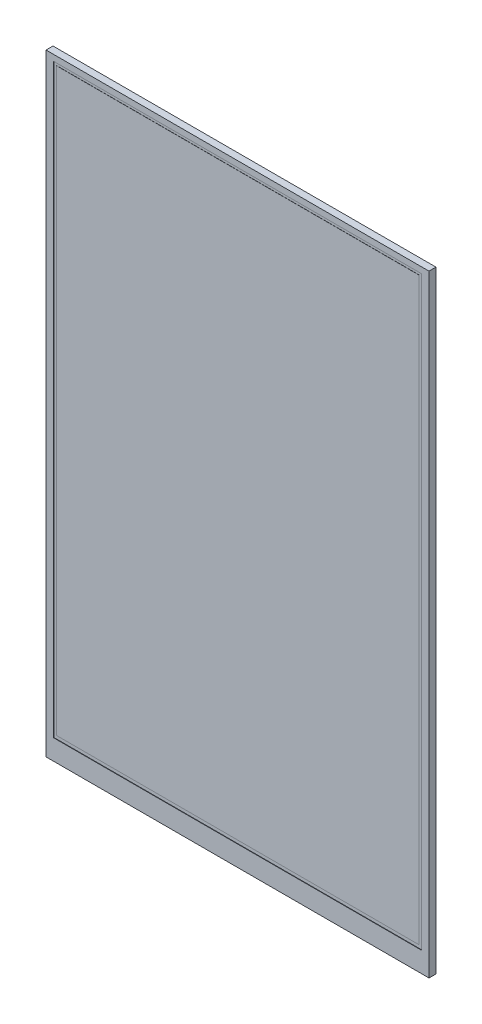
ISO-10303-21;
HEADER;
FILE_DESCRIPTION(('STEP AP214'),'2;1');
FILE_NAME('part.step','',(''),(''),'','','');
FILE_SCHEMA(('AUTOMOTIVE_DESIGN { 1 0 10303 214 1 1 1 1 }'));
ENDSEC;
DATA;
#1=APPLICATION_CONTEXT('core data for automotive mechanical design processes');
#2=APPLICATION_PROTOCOL_DEFINITION('international standard','automotive_design',2000,#1);
#3=PRODUCT_CONTEXT('',#1,'mechanical');
#4=PRODUCT('Part','Part','',(#3));
#5=PRODUCT_RELATED_PRODUCT_CATEGORY('part','',(#4));
#6=PRODUCT_DEFINITION_FORMATION('','',#4);
#7=PRODUCT_DEFINITION_CONTEXT('part definition',#1,'design');
#8=PRODUCT_DEFINITION('design','',#6,#7);
#9=PRODUCT_DEFINITION_SHAPE('','',#8);
#10=(LENGTH_UNIT() NAMED_UNIT(*) SI_UNIT(.MILLI.,.METRE.));
#11=(NAMED_UNIT(*) PLANE_ANGLE_UNIT() SI_UNIT($,.RADIAN.));
#12=(NAMED_UNIT(*) SI_UNIT($,.STERADIAN.) SOLID_ANGLE_UNIT());
#13=UNCERTAINTY_MEASURE_WITH_UNIT(LENGTH_MEASURE(1.E-05),#10,'distance_accuracy_value','');
#14=(GEOMETRIC_REPRESENTATION_CONTEXT(3) GLOBAL_UNCERTAINTY_ASSIGNED_CONTEXT((#13)) GLOBAL_UNIT_ASSIGNED_CONTEXT((#10,
#11,#12)) REPRESENTATION_CONTEXT('',''));
#15=CARTESIAN_POINT('',(0.,0.,0.));
#16=DIRECTION('',(0.,0.,1.));
#17=DIRECTION('',(1.,0.,0.));
#18=AXIS2_PLACEMENT_3D('',#15,#16,#17);
#19=CARTESIAN_POINT('',(-68.5,-113.78,0.));
#20=DIRECTION('',(-1.,0.,0.));
#21=DIRECTION('',(0.,0.,1.));
#22=AXIS2_PLACEMENT_3D('',#19,#20,#21);
#23=PLANE('',#22);
#24=DIRECTION('',(-2.368475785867E-13,0.,1.));
#25=VECTOR('',#24,1.);
#26=CARTESIAN_POINT('',(-68.5,108.22,0.));
#27=LINE('',#26,#25);
#28=CARTESIAN_POINT('',(-68.5,108.22,0.));
#29=VERTEX_POINT('',#28);
#30=CARTESIAN_POINT('',(-68.5,108.22,0.06));
#31=VERTEX_POINT('',#30);
#32=EDGE_CURVE('E11',#29,#31,#27,.T.);
#33=ORIENTED_EDGE('',*,*,#32,.T.);
#34=DIRECTION('',(0.,1.,0.));
#35=VECTOR('',#34,1.);
#36=CARTESIAN_POINT('',(-68.5,-113.78,0.06));
#37=LINE('',#36,#35);
#38=CARTESIAN_POINT('',(-68.5,-113.78,0.06));
#39=VERTEX_POINT('',#38);
#40=EDGE_CURVE('E1139',#39,#31,#37,.T.);
#41=ORIENTED_EDGE('',*,*,#40,.F.);
#42=DIRECTION('',(0.,0.,1.));
#43=VECTOR('',#42,1.);
#44=CARTESIAN_POINT('',(-68.5,-113.78,0.));
#45=LINE('',#44,#43);
#46=CARTESIAN_POINT('',(-68.5,-113.78,0.));
#47=VERTEX_POINT('',#46);
#48=EDGE_CURVE('E1018',#47,#39,#45,.T.);
#49=ORIENTED_EDGE('',*,*,#48,.F.);
#50=DIRECTION('',(0.,1.,0.));
#51=VECTOR('',#50,1.);
#52=CARTESIAN_POINT('',(-68.5,-113.78,0.));
#53=LINE('',#52,#51);
#54=EDGE_CURVE('E2446',#47,#29,#53,.T.);
#55=ORIENTED_EDGE('',*,*,#54,.T.);
#56=EDGE_LOOP('',(#33,#41,#49,#55));
#57=FACE_BOUND('',#56,.T.);
#58=ADVANCED_FACE('F17',(#57),#23,.F.);
#59=CARTESIAN_POINT('',(-68.5,108.22,0.));
#60=DIRECTION('',(0.,1.,0.));
#61=DIRECTION('',(1.,0.,0.));
#62=AXIS2_PLACEMENT_3D('',#59,#60,#61);
#63=PLANE('',#62);
#64=DIRECTION('',(0.,0.,1.));
#65=VECTOR('',#64,1.);
#66=CARTESIAN_POINT('',(68.5,108.22,0.));
#67=LINE('',#66,#65);
#68=CARTESIAN_POINT('',(68.5,108.22,0.));
#69=VERTEX_POINT('',#68);
#70=CARTESIAN_POINT('',(68.5,108.22,0.06));
#71=VERTEX_POINT('',#70);
#72=EDGE_CURVE('E27',#69,#71,#67,.T.);
#73=ORIENTED_EDGE('',*,*,#72,.T.);
#74=DIRECTION('',(1.,0.,0.));
#75=VECTOR('',#74,1.);
#76=CARTESIAN_POINT('',(-68.5,108.22,0.06));
#77=LINE('',#76,#75);
#78=EDGE_CURVE('E1143',#31,#71,#77,.T.);
#79=ORIENTED_EDGE('',*,*,#78,.F.);
#80=ORIENTED_EDGE('',*,*,#32,.F.);
#81=DIRECTION('',(1.,0.,0.));
#82=VECTOR('',#81,1.);
#83=CARTESIAN_POINT('',(-68.5,108.22,0.));
#84=LINE('',#83,#82);
#85=EDGE_CURVE('E4545',#29,#69,#84,.T.);
#86=ORIENTED_EDGE('',*,*,#85,.T.);
#87=EDGE_LOOP('',(#73,#79,#80,#86));
#88=FACE_BOUND('',#87,.T.);
#89=ADVANCED_FACE('F19',(#88),#63,.F.);
#90=CARTESIAN_POINT('',(68.5,108.22,0.));
#91=DIRECTION('',(1.,0.,0.));
#92=DIRECTION('',(0.,1.,0.));
#93=AXIS2_PLACEMENT_3D('',#90,#91,#92);
#94=PLANE('',#93);
#95=DIRECTION('',(0.,0.,1.));
#96=VECTOR('',#95,1.);
#97=CARTESIAN_POINT('',(68.5,-113.78,0.));
#98=LINE('',#97,#96);
#99=CARTESIAN_POINT('',(68.5,-113.78,0.));
#100=VERTEX_POINT('',#99);
#101=CARTESIAN_POINT('',(68.5,-113.78,0.06));
#102=VERTEX_POINT('',#101);
#103=EDGE_CURVE('E984',#100,#102,#98,.T.);
#104=ORIENTED_EDGE('',*,*,#103,.T.);
#105=DIRECTION('',(0.,-1.,0.));
#106=VECTOR('',#105,1.);
#107=CARTESIAN_POINT('',(68.5,108.22,0.06));
#108=LINE('',#107,#106);
#109=EDGE_CURVE('E1147',#71,#102,#108,.T.);
#110=ORIENTED_EDGE('',*,*,#109,.F.);
#111=ORIENTED_EDGE('',*,*,#72,.F.);
#112=DIRECTION('',(0.,-1.,0.));
#113=VECTOR('',#112,1.);
#114=CARTESIAN_POINT('',(68.5,108.22,0.));
#115=LINE('',#114,#113);
#116=EDGE_CURVE('E4542',#69,#100,#115,.T.);
#117=ORIENTED_EDGE('',*,*,#116,.T.);
#118=EDGE_LOOP('',(#104,#110,#111,#117));
#119=FACE_BOUND('',#118,.T.);
#120=ADVANCED_FACE('F1977',(#119),#94,.F.);
#121=CARTESIAN_POINT('',(33.65,-102.22,0.06));
#122=DIRECTION('',(1.,0.,0.));
#123=DIRECTION('',(0.,1.,0.));
#124=AXIS2_PLACEMENT_3D('',#121,#122,#123);
#125=PLANE('',#124);
#126=DIRECTION('',(0.,0.,-1.));
#127=VECTOR('',#126,1.);
#128=CARTESIAN_POINT('',(33.65,-102.9781483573,-1.69));
#129=LINE('',#128,#127);
#130=CARTESIAN_POINT('',(33.65,-102.9781483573,-1.69));
#131=VERTEX_POINT('',#130);
#132=CARTESIAN_POINT('',(33.65,-102.9781483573,-1.79));
#133=VERTEX_POINT('',#132);
#134=EDGE_CURVE('E1808',#131,#133,#129,.T.);
#135=ORIENTED_EDGE('',*,*,#134,.T.);
#136=DIRECTION('',(0.,-1.,0.));
#137=VECTOR('',#136,1.);
#138=CARTESIAN_POINT('',(33.65,-102.22,-1.79));
#139=LINE('',#138,#137);
#140=CARTESIAN_POINT('',(33.65,-102.22,-1.79));
#141=VERTEX_POINT('',#140);
#142=EDGE_CURVE('E1040',#141,#133,#139,.T.);
#143=ORIENTED_EDGE('',*,*,#142,.F.);
#144=DIRECTION('',(0.,0.,-1.));
#145=VECTOR('',#144,1.);
#146=CARTESIAN_POINT('',(33.65,-102.22,-1.69));
#147=LINE('',#146,#145);
#148=CARTESIAN_POINT('',(33.65,-102.22,-1.69));
#149=VERTEX_POINT('',#148);
#150=EDGE_CURVE('E1855',#149,#141,#147,.T.);
#151=ORIENTED_EDGE('',*,*,#150,.F.);
#152=DIRECTION('',(0.,-1.,0.));
#153=VECTOR('',#152,1.);
#154=CARTESIAN_POINT('',(33.65,-102.22,-1.69));
#155=LINE('',#154,#153);
#156=EDGE_CURVE('E1848',#149,#131,#155,.T.);
#157=ORIENTED_EDGE('',*,*,#156,.T.);
#158=EDGE_LOOP('',(#135,#143,#151,#157));
#159=FACE_BOUND('',#158,.T.);
#160=ADVANCED_FACE('F1895',(#159),#125,.T.);
#161=CARTESIAN_POINT('',(0.,0.,-1.79));
#162=DIRECTION('',(0.,0.,-1.));
#163=DIRECTION('',(0.,-1.,0.));
#164=AXIS2_PLACEMENT_3D('',#161,#162,#163);
#165=PLANE('',#164);
#166=DIRECTION('',(-1.,0.,0.));
#167=VECTOR('',#166,1.);
#168=CARTESIAN_POINT('',(34.47,-102.22,-1.79));
#169=LINE('',#168,#167);
#170=CARTESIAN_POINT('',(34.47,-102.22,-1.79));
#171=VERTEX_POINT('',#170);
#172=EDGE_CURVE('E1725',#171,#141,#169,.T.);
#173=ORIENTED_EDGE('',*,*,#172,.T.);
#174=ORIENTED_EDGE('',*,*,#142,.T.);
#175=DIRECTION('',(-1.,0.,0.));
#176=VECTOR('',#175,1.);
#177=CARTESIAN_POINT('',(33.65,-102.9781483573,-1.79));
#178=LINE('',#177,#176);
#179=CARTESIAN_POINT('',(12.79,-102.9781483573,-1.79));
#180=VERTEX_POINT('',#179);
#181=EDGE_CURVE('E1464',#133,#180,#178,.T.);
#182=ORIENTED_EDGE('',*,*,#181,.T.);
#183=DIRECTION('',(0.,1.,0.));
#184=VECTOR('',#183,1.);
#185=CARTESIAN_POINT('',(12.79,-102.9781483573,-1.79));
#186=LINE('',#185,#184);
#187=CARTESIAN_POINT('',(12.79,-102.22,-1.79));
#188=VERTEX_POINT('',#187);
#189=EDGE_CURVE('E39',#180,#188,#186,.T.);
#190=ORIENTED_EDGE('',*,*,#189,.T.);
#191=DIRECTION('',(-1.,0.,0.));
#192=VECTOR('',#191,1.);
#193=CARTESIAN_POINT('',(12.79,-102.22,-1.79));
#194=LINE('',#193,#192);
#195=CARTESIAN_POINT('',(11.97,-102.22,-1.79));
#196=VERTEX_POINT('',#195);
#197=EDGE_CURVE('E1885',#188,#196,#194,.T.);
#198=ORIENTED_EDGE('',*,*,#197,.T.);
#199=DIRECTION('',(0.,1.,0.));
#200=VECTOR('',#199,1.);
#201=CARTESIAN_POINT('',(11.97,-102.22,-1.79));
#202=LINE('',#201,#200);
#203=CARTESIAN_POINT('',(11.97,-101.22,-1.79));
#204=VERTEX_POINT('',#203);
#205=EDGE_CURVE('E879',#196,#204,#202,.T.);
#206=ORIENTED_EDGE('',*,*,#205,.T.);
#207=DIRECTION('',(1.,0.,0.));
#208=VECTOR('',#207,1.);
#209=CARTESIAN_POINT('',(11.97,-101.22,-1.79));
#210=LINE('',#209,#208);
#211=CARTESIAN_POINT('',(34.47,-101.22,-1.79));
#212=VERTEX_POINT('',#211);
#213=EDGE_CURVE('E871',#204,#212,#210,.T.);
#214=ORIENTED_EDGE('',*,*,#213,.T.);
#215=DIRECTION('',(0.,-1.,0.));
#216=VECTOR('',#215,1.);
#217=CARTESIAN_POINT('',(34.47,-101.22,-1.79));
#218=LINE('',#217,#216);
#219=EDGE_CURVE('E876',#212,#171,#218,.T.);
#220=ORIENTED_EDGE('',*,*,#219,.T.);
#221=EDGE_LOOP('',(#173,#174,#182,#190,#198,#206,#214,#220));
#222=FACE_BOUND('',#221,.T.);
#223=ADVANCED_FACE('F874',(#222),#165,.T.);
#224=CARTESIAN_POINT('',(12.79,-102.9781483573,0.06));
#225=DIRECTION('',(-1.,0.,0.));
#226=DIRECTION('',(0.,0.,1.));
#227=AXIS2_PLACEMENT_3D('',#224,#225,#226);
#228=PLANE('',#227);
#229=DIRECTION('',(0.,0.,-1.));
#230=VECTOR('',#229,1.);
#231=CARTESIAN_POINT('',(12.79,-102.22,-1.69));
#232=LINE('',#231,#230);
#233=CARTESIAN_POINT('',(12.79,-102.22,-1.69));
#234=VERTEX_POINT('',#233);
#235=EDGE_CURVE('E1041',#234,#188,#232,.T.);
#236=ORIENTED_EDGE('',*,*,#235,.T.);
#237=ORIENTED_EDGE('',*,*,#189,.F.);
#238=DIRECTION('',(0.,0.,-1.));
#239=VECTOR('',#238,1.);
#240=CARTESIAN_POINT('',(12.79,-102.9781483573,-1.69));
#241=LINE('',#240,#239);
#242=CARTESIAN_POINT('',(12.79,-102.9781483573,-1.69));
#243=VERTEX_POINT('',#242);
#244=EDGE_CURVE('E1460',#243,#180,#241,.T.);
#245=ORIENTED_EDGE('',*,*,#244,.F.);
#246=DIRECTION('',(0.,-1.,0.));
#247=VECTOR('',#246,1.);
#248=CARTESIAN_POINT('',(12.79,-102.22,-1.69));
#249=LINE('',#248,#247);
#250=EDGE_CURVE('E1845',#234,#243,#249,.T.);
#251=ORIENTED_EDGE('',*,*,#250,.F.);
#252=EDGE_LOOP('',(#236,#237,#245,#251));
#253=FACE_BOUND('',#252,.T.);
#254=ADVANCED_FACE('F1903',(#253),#228,.T.);
#255=CARTESIAN_POINT('',(12.79,-102.22,0.06));
#256=DIRECTION('',(0.,-1.,0.));
#257=DIRECTION('',(0.,0.,-1.));
#258=AXIS2_PLACEMENT_3D('',#255,#256,#257);
#259=PLANE('',#258);
#260=DIRECTION('',(0.,1.42108547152E-13,-1.));
#261=VECTOR('',#260,1.);
#262=CARTESIAN_POINT('',(11.97,-102.22,-1.69));
#263=LINE('',#262,#261);
#264=CARTESIAN_POINT('',(11.97,-102.22,-1.69));
#265=VERTEX_POINT('',#264);
#266=EDGE_CURVE('E1865',#265,#196,#263,.T.);
#267=ORIENTED_EDGE('',*,*,#266,.T.);
#268=ORIENTED_EDGE('',*,*,#197,.F.);
#269=ORIENTED_EDGE('',*,*,#235,.F.);
#270=DIRECTION('',(-1.,0.,0.));
#271=VECTOR('',#270,1.);
#272=CARTESIAN_POINT('',(12.79,-102.22,-1.69));
#273=LINE('',#272,#271);
#274=EDGE_CURVE('E1841',#234,#265,#273,.T.);
#275=ORIENTED_EDGE('',*,*,#274,.T.);
#276=EDGE_LOOP('',(#267,#268,#269,#275));
#277=FACE_BOUND('',#276,.T.);
#278=ADVANCED_FACE('F1907',(#277),#259,.T.);
#279=CARTESIAN_POINT('',(33.65,-102.22,0.06));
#280=DIRECTION('',(0.,1.,0.));
#281=DIRECTION('',(1.,0.,0.));
#282=AXIS2_PLACEMENT_3D('',#279,#280,#281);
#283=PLANE('',#282);
#284=DIRECTION('',(1.,0.,0.));
#285=VECTOR('',#284,1.);
#286=CARTESIAN_POINT('',(34.47,-102.22,0.06));
#287=LINE('',#286,#285);
#288=CARTESIAN_POINT('',(34.47,-102.22,0.06));
#289=VERTEX_POINT('',#288);
#290=CARTESIAN_POINT('',(35.22,-102.22,0.06));
#291=VERTEX_POINT('',#290);
#292=EDGE_CURVE('E1166',#289,#291,#287,.T.);
#293=ORIENTED_EDGE('',*,*,#292,.T.);
#294=DIRECTION('',(0.,0.,-1.));
#295=VECTOR('',#294,1.);
#296=CARTESIAN_POINT('',(35.22,-102.22,0.06));
#297=LINE('',#296,#295);
#298=CARTESIAN_POINT('',(35.22,-102.22,-1.69));
#299=VERTEX_POINT('',#298);
#300=EDGE_CURVE('E1873',#291,#299,#297,.T.);
#301=ORIENTED_EDGE('',*,*,#300,.T.);
#302=DIRECTION('',(1.,0.,0.));
#303=VECTOR('',#302,1.);
#304=CARTESIAN_POINT('',(34.47,-102.22,-1.69));
#305=LINE('',#304,#303);
#306=CARTESIAN_POINT('',(34.47,-102.22,-1.69));
#307=VERTEX_POINT('',#306);
#308=EDGE_CURVE('E1678',#307,#299,#305,.T.);
#309=ORIENTED_EDGE('',*,*,#308,.F.);
#310=DIRECTION('',(0.,0.,-1.));
#311=VECTOR('',#310,1.);
#312=CARTESIAN_POINT('',(34.47,-102.22,0.06));
#313=LINE('',#312,#311);
#314=EDGE_CURVE('E900',#289,#307,#313,.T.);
#315=ORIENTED_EDGE('',*,*,#314,.F.);
#316=EDGE_LOOP('',(#293,#301,#309,#315));
#317=FACE_BOUND('',#316,.T.);
#318=ADVANCED_FACE('F1925',(#317),#283,.T.);
#319=CARTESIAN_POINT('',(-257.9148,-99.55979589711,0.26));
#320=DIRECTION('',(1.,0.,0.));
#321=DIRECTION('',(0.,0.,-1.));
#322=AXIS2_PLACEMENT_3D('',#319,#320,#321);
#323=CYLINDRICAL_SURFACE('',#322,1.);
#324=DIRECTION('',(1.,0.,0.));
#325=VECTOR('',#324,1.);
#326=CARTESIAN_POINT('',(-44.5,-99.55979589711,-0.74));
#327=LINE('',#326,#325);
#328=CARTESIAN_POINT('',(-44.5,-99.55979589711,-0.74));
#329=VERTEX_POINT('',#328);
#330=CARTESIAN_POINT('',(9.5,-99.55979589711,-0.74));
#331=VERTEX_POINT('',#330);
#332=EDGE_CURVE('E1733',#329,#331,#327,.T.);
#333=ORIENTED_EDGE('',*,*,#332,.F.);
#334=CARTESIAN_POINT('',(-44.5,-99.55979589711,0.26));
#335=DIRECTION('',(-1.,0.,0.));
#336=DIRECTION('',(0.,0.979795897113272,-0.199999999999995));
#337=AXIS2_PLACEMENT_3D('',#334,#335,#336);
#338=CIRCLE('',#337,1.);
#339=CARTESIAN_POINT('',(-44.5,-98.58,0.06));
#340=VERTEX_POINT('',#339);
#341=EDGE_CURVE('E1722',#340,#329,#338,.T.);
#342=ORIENTED_EDGE('',*,*,#341,.F.);
#343=DIRECTION('',(1.,0.,0.));
#344=VECTOR('',#343,1.);
#345=CARTESIAN_POINT('',(-44.5,-98.58,0.06));
#346=LINE('',#345,#344);
#347=CARTESIAN_POINT('',(9.5,-98.58,0.06));
#348=VERTEX_POINT('',#347);
#349=EDGE_CURVE('E1104',#340,#348,#346,.T.);
#350=ORIENTED_EDGE('',*,*,#349,.T.);
#351=CARTESIAN_POINT('',(9.5,-99.55979589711,0.26));
#352=DIRECTION('',(1.,0.,0.));
#353=DIRECTION('',(0.,0.,-1.));
#354=AXIS2_PLACEMENT_3D('',#351,#352,#353);
#355=CIRCLE('',#354,1.);
#356=EDGE_CURVE('E1882',#331,#348,#355,.T.);
#357=ORIENTED_EDGE('',*,*,#356,.F.);
#358=EDGE_LOOP('',(#333,#342,#350,#357));
#359=FACE_BOUND('',#358,.T.);
#360=ADVANCED_FACE('F2239',(#359),#323,.T.);
#361=CARTESIAN_POINT('',(9.5,-98.58,0.06));
#362=DIRECTION('',(1.,0.,0.));
#363=DIRECTION('',(0.,1.,0.));
#364=AXIS2_PLACEMENT_3D('',#361,#362,#363);
#365=PLANE('',#364);
#366=ORIENTED_EDGE('',*,*,#356,.T.);
#367=DIRECTION('',(0.,1.,0.));
#368=VECTOR('',#367,1.);
#369=CARTESIAN_POINT('',(9.5,-102.666982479,0.06));
#370=LINE('',#369,#368);
#371=CARTESIAN_POINT('',(9.5,-102.666982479,0.06));
#372=VERTEX_POINT('',#371);
#373=EDGE_CURVE('E1109',#372,#348,#370,.T.);
#374=ORIENTED_EDGE('',*,*,#373,.F.);
#375=DIRECTION('',(0.,0.,-1.));
#376=VECTOR('',#375,1.);
#377=CARTESIAN_POINT('',(9.5,-102.666982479,0.06));
#378=LINE('',#377,#376);
#379=CARTESIAN_POINT('',(9.5,-102.666982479,-0.04));
#380=VERTEX_POINT('',#379);
#381=EDGE_CURVE('E1879',#372,#380,#378,.T.);
#382=ORIENTED_EDGE('',*,*,#381,.T.);
#383=DIRECTION('',(0.,1.,0.));
#384=VECTOR('',#383,1.);
#385=CARTESIAN_POINT('',(9.5,-113.78,-0.04));
#386=LINE('',#385,#384);
#387=CARTESIAN_POINT('',(9.5,-113.78,-0.04));
#388=VERTEX_POINT('',#387);
#389=EDGE_CURVE('E1782',#388,#380,#386,.T.);
#390=ORIENTED_EDGE('',*,*,#389,.F.);
#391=DIRECTION('',(0.,0.,-1.));
#392=VECTOR('',#391,1.);
#393=CARTESIAN_POINT('',(9.5,-113.78,-0.04));
#394=LINE('',#393,#392);
#395=CARTESIAN_POINT('',(9.5,-113.78,-0.74));
#396=VERTEX_POINT('',#395);
#397=EDGE_CURVE('E1744',#388,#396,#394,.T.);
#398=ORIENTED_EDGE('',*,*,#397,.T.);
#399=DIRECTION('',(0.,-1.,0.));
#400=VECTOR('',#399,1.);
#401=CARTESIAN_POINT('',(9.5,-99.55979589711,-0.74));
#402=LINE('',#401,#400);
#403=EDGE_CURVE('E1737',#331,#396,#402,.T.);
#404=ORIENTED_EDGE('',*,*,#403,.F.);
#405=EDGE_LOOP('',(#366,#374,#382,#390,#398,#404));
#406=FACE_BOUND('',#405,.T.);
#407=ADVANCED_FACE('F2235',(#406),#365,.T.);
#408=CARTESIAN_POINT('',(8.388197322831,-102.666982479,0.06));
#409=DIRECTION('',(0.,1.,0.));
#410=DIRECTION('',(1.,0.,0.));
#411=AXIS2_PLACEMENT_3D('',#408,#409,#410);
#412=PLANE('',#411);
#413=DIRECTION('',(1.,0.,0.));
#414=VECTOR('',#413,1.);
#415=CARTESIAN_POINT('',(9.5,-102.666982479,0.06));
#416=LINE('',#415,#414);
#417=CARTESIAN_POINT('',(11.22,-102.666982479,0.06));
#418=VERTEX_POINT('',#417);
#419=EDGE_CURVE('E1186',#372,#418,#416,.T.);
#420=ORIENTED_EDGE('',*,*,#419,.T.);
#421=DIRECTION('',(0.,0.,-1.));
#422=VECTOR('',#421,1.);
#423=CARTESIAN_POINT('',(11.22,-102.666982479,0.06));
#424=LINE('',#423,#422);
#425=CARTESIAN_POINT('',(11.22,-102.666982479,-0.04));
#426=VERTEX_POINT('',#425);
#427=EDGE_CURVE('E1795',#418,#426,#424,.T.);
#428=ORIENTED_EDGE('',*,*,#427,.T.);
#429=DIRECTION('',(1.,0.,0.));
#430=VECTOR('',#429,1.);
#431=CARTESIAN_POINT('',(9.5,-102.666982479,-0.04));
#432=LINE('',#431,#430);
#433=EDGE_CURVE('E1521',#380,#426,#432,.T.);
#434=ORIENTED_EDGE('',*,*,#433,.F.);
#435=ORIENTED_EDGE('',*,*,#381,.F.);
#436=EDGE_LOOP('',(#420,#428,#434,#435));
#437=FACE_BOUND('',#436,.T.);
#438=ADVANCED_FACE('F2238',(#437),#412,.T.);
#439=CARTESIAN_POINT('',(8.388197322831,-102.666982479,0.06));
#440=DIRECTION('',(0.,1.,0.));
#441=DIRECTION('',(1.,0.,0.));
#442=AXIS2_PLACEMENT_3D('',#439,#440,#441);
#443=PLANE('',#442);
#444=DIRECTION('',(0.,0.,-1.));
#445=VECTOR('',#444,1.);
#446=CARTESIAN_POINT('',(37.5,-102.666982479,0.06));
#447=LINE('',#446,#445);
#448=CARTESIAN_POINT('',(37.5,-102.666982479,0.06));
#449=VERTEX_POINT('',#448);
#450=CARTESIAN_POINT('',(37.5,-102.666982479,-0.04));
#451=VERTEX_POINT('',#450);
#452=EDGE_CURVE('E953',#449,#451,#447,.T.);
#453=ORIENTED_EDGE('',*,*,#452,.T.);
#454=DIRECTION('',(1.,0.,0.));
#455=VECTOR('',#454,1.);
#456=CARTESIAN_POINT('',(35.22,-102.666982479,-0.04));
#457=LINE('',#456,#455);
#458=CARTESIAN_POINT('',(35.22,-102.666982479,-0.04));
#459=VERTEX_POINT('',#458);
#460=EDGE_CURVE('E1779',#459,#451,#457,.T.);
#461=ORIENTED_EDGE('',*,*,#460,.F.);
#462=DIRECTION('',(0.,0.,-1.));
#463=VECTOR('',#462,1.);
#464=CARTESIAN_POINT('',(35.22,-102.666982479,0.06));
#465=LINE('',#464,#463);
#466=CARTESIAN_POINT('',(35.22,-102.666982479,0.06));
#467=VERTEX_POINT('',#466);
#468=EDGE_CURVE('E1876',#467,#459,#465,.T.);
#469=ORIENTED_EDGE('',*,*,#468,.F.);
#470=DIRECTION('',(1.,0.,0.));
#471=VECTOR('',#470,1.);
#472=CARTESIAN_POINT('',(35.22,-102.666982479,0.06));
#473=LINE('',#472,#471);
#474=EDGE_CURVE('E1153',#467,#449,#473,.T.);
#475=ORIENTED_EDGE('',*,*,#474,.T.);
#476=EDGE_LOOP('',(#453,#461,#469,#475));
#477=FACE_BOUND('',#476,.T.);
#478=ADVANCED_FACE('F2396',(#477),#443,.T.);
#479=CARTESIAN_POINT('',(35.22,-102.22,0.06));
#480=DIRECTION('',(1.,0.,0.));
#481=DIRECTION('',(0.,1.,0.));
#482=AXIS2_PLACEMENT_3D('',#479,#480,#481);
#483=PLANE('',#482);
#484=DIRECTION('',(0.,0.,-1.));
#485=VECTOR('',#484,1.);
#486=CARTESIAN_POINT('',(35.22,-105.72,-0.04));
#487=LINE('',#486,#485);
#488=CARTESIAN_POINT('',(35.22,-105.72,-0.04));
#489=VERTEX_POINT('',#488);
#490=CARTESIAN_POINT('',(35.22,-105.72,-1.69));
#491=VERTEX_POINT('',#490);
#492=EDGE_CURVE('E1794',#489,#491,#487,.T.);
#493=ORIENTED_EDGE('',*,*,#492,.T.);
#494=DIRECTION('',(0.,-1.,0.));
#495=VECTOR('',#494,1.);
#496=CARTESIAN_POINT('',(35.22,-102.22,-1.69));
#497=LINE('',#496,#495);
#498=EDGE_CURVE('E1673',#299,#491,#497,.T.);
#499=ORIENTED_EDGE('',*,*,#498,.F.);
#500=ORIENTED_EDGE('',*,*,#300,.F.);
#501=DIRECTION('',(0.,-1.,0.));
#502=VECTOR('',#501,1.);
#503=CARTESIAN_POINT('',(35.22,-102.22,0.06));
#504=LINE('',#503,#502);
#505=EDGE_CURVE('E1156',#291,#467,#504,.T.);
#506=ORIENTED_EDGE('',*,*,#505,.T.);
#507=ORIENTED_EDGE('',*,*,#468,.T.);
#508=DIRECTION('',(0.,1.,0.));
#509=VECTOR('',#508,1.);
#510=CARTESIAN_POINT('',(35.22,-105.72,-0.04));
#511=LINE('',#510,#509);
#512=EDGE_CURVE('E1775',#489,#459,#511,.T.);
#513=ORIENTED_EDGE('',*,*,#512,.F.);
#514=EDGE_LOOP('',(#493,#499,#500,#506,#507,#513));
#515=FACE_BOUND('',#514,.T.);
#516=ADVANCED_FACE('F1928',(#515),#483,.T.);
#517=CARTESIAN_POINT('',(35.22,-105.72,0.06));
#518=DIRECTION('',(0.,-1.,0.));
#519=DIRECTION('',(0.,0.,-1.));
#520=AXIS2_PLACEMENT_3D('',#517,#518,#519);
#521=PLANE('',#520);
#522=DIRECTION('',(0.,0.,-1.));
#523=VECTOR('',#522,1.);
#524=CARTESIAN_POINT('',(11.22,-105.72,-0.04));
#525=LINE('',#524,#523);
#526=CARTESIAN_POINT('',(11.22,-105.72,-0.04));
#527=VERTEX_POINT('',#526);
#528=CARTESIAN_POINT('',(11.22,-105.72,-1.69));
#529=VERTEX_POINT('',#528);
#530=EDGE_CURVE('E1791',#527,#529,#525,.T.);
#531=ORIENTED_EDGE('',*,*,#530,.T.);
#532=DIRECTION('',(-1.,0.,0.));
#533=VECTOR('',#532,1.);
#534=CARTESIAN_POINT('',(35.22,-105.72,-1.69));
#535=LINE('',#534,#533);
#536=EDGE_CURVE('E1677',#491,#529,#535,.T.);
#537=ORIENTED_EDGE('',*,*,#536,.F.);
#538=ORIENTED_EDGE('',*,*,#492,.F.);
#539=DIRECTION('',(-1.,0.,0.));
#540=VECTOR('',#539,1.);
#541=CARTESIAN_POINT('',(35.22,-105.72,-0.04));
#542=LINE('',#541,#540);
#543=EDGE_CURVE('E1771',#489,#527,#542,.T.);
#544=ORIENTED_EDGE('',*,*,#543,.T.);
#545=EDGE_LOOP('',(#531,#537,#538,#544));
#546=FACE_BOUND('',#545,.T.);
#547=ADVANCED_FACE('F1933',(#546),#521,.T.);
#548=CARTESIAN_POINT('',(11.22,-105.72,0.06));
#549=DIRECTION('',(-1.,0.,0.));
#550=DIRECTION('',(0.,0.,1.));
#551=AXIS2_PLACEMENT_3D('',#548,#549,#550);
#552=PLANE('',#551);
#553=ORIENTED_EDGE('',*,*,#427,.F.);
#554=DIRECTION('',(0.,1.,0.));
#555=VECTOR('',#554,1.);
#556=CARTESIAN_POINT('',(11.22,-102.666982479,0.06));
#557=LINE('',#556,#555);
#558=CARTESIAN_POINT('',(11.22,-102.22,0.06));
#559=VERTEX_POINT('',#558);
#560=EDGE_CURVE('E1096',#418,#559,#557,.T.);
#561=ORIENTED_EDGE('',*,*,#560,.T.);
#562=DIRECTION('',(0.,0.,-1.));
#563=VECTOR('',#562,1.);
#564=CARTESIAN_POINT('',(11.22,-102.22,0.06));
#565=LINE('',#564,#563);
#566=CARTESIAN_POINT('',(11.22,-102.22,-1.69));
#567=VERTEX_POINT('',#566);
#568=EDGE_CURVE('E1802',#559,#567,#565,.T.);
#569=ORIENTED_EDGE('',*,*,#568,.T.);
#570=DIRECTION('',(0.,1.,0.));
#571=VECTOR('',#570,1.);
#572=CARTESIAN_POINT('',(11.22,-105.72,-1.69));
#573=LINE('',#572,#571);
#574=EDGE_CURVE('E1833',#529,#567,#573,.T.);
#575=ORIENTED_EDGE('',*,*,#574,.F.);
#576=ORIENTED_EDGE('',*,*,#530,.F.);
#577=DIRECTION('',(0.,1.,0.));
#578=VECTOR('',#577,1.);
#579=CARTESIAN_POINT('',(11.22,-105.72,-0.04));
#580=LINE('',#579,#578);
#581=EDGE_CURVE('E1525',#527,#426,#580,.T.);
#582=ORIENTED_EDGE('',*,*,#581,.T.);
#583=EDGE_LOOP('',(#553,#561,#569,#575,#576,#582));
#584=FACE_BOUND('',#583,.T.);
#585=ADVANCED_FACE('F1937',(#584),#552,.T.);
#586=CARTESIAN_POINT('',(11.22,-102.22,0.06));
#587=DIRECTION('',(0.,1.,0.));
#588=DIRECTION('',(1.,0.,0.));
#589=AXIS2_PLACEMENT_3D('',#586,#587,#588);
#590=PLANE('',#589);
#591=DIRECTION('',(1.,0.,0.));
#592=VECTOR('',#591,1.);
#593=CARTESIAN_POINT('',(11.22,-102.22,-1.69));
#594=LINE('',#593,#592);
#595=EDGE_CURVE('E1837',#567,#265,#594,.T.);
#596=ORIENTED_EDGE('',*,*,#595,.F.);
#597=ORIENTED_EDGE('',*,*,#568,.F.);
#598=DIRECTION('',(1.,0.,0.));
#599=VECTOR('',#598,1.);
#600=CARTESIAN_POINT('',(11.22,-102.22,0.06));
#601=LINE('',#600,#599);
#602=CARTESIAN_POINT('',(11.97,-102.22,0.06));
#603=VERTEX_POINT('',#602);
#604=EDGE_CURVE('E1092',#559,#603,#601,.T.);
#605=ORIENTED_EDGE('',*,*,#604,.T.);
#606=DIRECTION('',(0.,0.,-1.));
#607=VECTOR('',#606,1.);
#608=CARTESIAN_POINT('',(11.97,-102.22,0.06));
#609=LINE('',#608,#607);
#610=EDGE_CURVE('E1805',#603,#265,#609,.T.);
#611=ORIENTED_EDGE('',*,*,#610,.T.);
#612=EDGE_LOOP('',(#596,#597,#605,#611));
#613=FACE_BOUND('',#612,.T.);
#614=ADVANCED_FACE('F1941',(#613),#590,.T.);
#615=CARTESIAN_POINT('',(11.97,-102.22,0.06));
#616=DIRECTION('',(-1.,0.,0.));
#617=DIRECTION('',(0.,0.,1.));
#618=AXIS2_PLACEMENT_3D('',#615,#616,#617);
#619=PLANE('',#618);
#620=DIRECTION('',(0.,0.,-1.));
#621=VECTOR('',#620,1.);
#622=CARTESIAN_POINT('',(11.97,-101.22,0.06));
#623=LINE('',#622,#621);
#624=CARTESIAN_POINT('',(11.97,-101.22,0.06));
#625=VERTEX_POINT('',#624);
#626=EDGE_CURVE('E883',#625,#204,#623,.T.);
#627=ORIENTED_EDGE('',*,*,#626,.T.);
#628=ORIENTED_EDGE('',*,*,#205,.F.);
#629=ORIENTED_EDGE('',*,*,#266,.F.);
#630=ORIENTED_EDGE('',*,*,#610,.F.);
#631=DIRECTION('',(0.,1.,0.));
#632=VECTOR('',#631,1.);
#633=CARTESIAN_POINT('',(11.97,-102.22,0.06));
#634=LINE('',#633,#632);
#635=EDGE_CURVE('E1097',#603,#625,#634,.T.);
#636=ORIENTED_EDGE('',*,*,#635,.T.);
#637=EDGE_LOOP('',(#627,#628,#629,#630,#636));
#638=FACE_BOUND('',#637,.T.);
#639=ADVANCED_FACE('F1910',(#638),#619,.T.);
#640=CARTESIAN_POINT('',(11.97,-101.22,0.06));
#641=DIRECTION('',(0.,1.,0.));
#642=DIRECTION('',(1.,0.,0.));
#643=AXIS2_PLACEMENT_3D('',#640,#641,#642);
#644=PLANE('',#643);
#645=DIRECTION('',(0.,0.,-1.));
#646=VECTOR('',#645,1.);
#647=CARTESIAN_POINT('',(34.47,-101.22,0.06));
#648=LINE('',#647,#646);
#649=CARTESIAN_POINT('',(34.47,-101.22,0.06));
#650=VERTEX_POINT('',#649);
#651=EDGE_CURVE('E884',#650,#212,#648,.T.);
#652=ORIENTED_EDGE('',*,*,#651,.T.);
#653=ORIENTED_EDGE('',*,*,#213,.F.);
#654=ORIENTED_EDGE('',*,*,#626,.F.);
#655=DIRECTION('',(1.,0.,0.));
#656=VECTOR('',#655,1.);
#657=CARTESIAN_POINT('',(11.97,-101.22,0.06));
#658=LINE('',#657,#656);
#659=EDGE_CURVE('E889',#625,#650,#658,.T.);
#660=ORIENTED_EDGE('',*,*,#659,.T.);
#661=EDGE_LOOP('',(#652,#653,#654,#660));
#662=FACE_BOUND('',#661,.T.);
#663=ADVANCED_FACE('F887',(#662),#644,.T.);
#664=CARTESIAN_POINT('',(34.47,-101.22,0.06));
#665=DIRECTION('',(1.,0.,0.));
#666=DIRECTION('',(0.,1.,0.));
#667=AXIS2_PLACEMENT_3D('',#664,#665,#666);
#668=PLANE('',#667);
#669=ORIENTED_EDGE('',*,*,#314,.T.);
#670=DIRECTION('',(0.,1.42108547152E-13,-1.));
#671=VECTOR('',#670,1.);
#672=CARTESIAN_POINT('',(34.47,-102.22,-1.69));
#673=LINE('',#672,#671);
#674=EDGE_CURVE('E897',#307,#171,#673,.T.);
#675=ORIENTED_EDGE('',*,*,#674,.T.);
#676=ORIENTED_EDGE('',*,*,#219,.F.);
#677=ORIENTED_EDGE('',*,*,#651,.F.);
#678=DIRECTION('',(0.,-1.,0.));
#679=VECTOR('',#678,1.);
#680=CARTESIAN_POINT('',(34.47,-101.22,0.06));
#681=LINE('',#680,#679);
#682=EDGE_CURVE('E1175',#650,#289,#681,.T.);
#683=ORIENTED_EDGE('',*,*,#682,.T.);
#684=EDGE_LOOP('',(#669,#675,#676,#677,#683));
#685=FACE_BOUND('',#684,.T.);
#686=ADVANCED_FACE('F895',(#685),#668,.T.);
#687=CARTESIAN_POINT('',(34.47,-102.22,0.06));
#688=DIRECTION('',(0.,-1.,0.));
#689=DIRECTION('',(0.,0.,-1.));
#690=AXIS2_PLACEMENT_3D('',#687,#688,#689);
#691=PLANE('',#690);
#692=ORIENTED_EDGE('',*,*,#150,.T.);
#693=ORIENTED_EDGE('',*,*,#172,.F.);
#694=ORIENTED_EDGE('',*,*,#674,.F.);
#695=DIRECTION('',(-1.,0.,0.));
#696=VECTOR('',#695,1.);
#697=CARTESIAN_POINT('',(34.47,-102.22,-1.69));
#698=LINE('',#697,#696);
#699=EDGE_CURVE('E1851',#307,#149,#698,.T.);
#700=ORIENTED_EDGE('',*,*,#699,.T.);
#701=EDGE_LOOP('',(#692,#693,#694,#700));
#702=FACE_BOUND('',#701,.T.);
#703=ADVANCED_FACE('F1922',(#702),#691,.T.);
#704=CARTESIAN_POINT('',(0.,0.,-1.69));
#705=DIRECTION('',(0.,0.,-1.));
#706=DIRECTION('',(0.,-1.,0.));
#707=AXIS2_PLACEMENT_3D('',#704,#705,#706);
#708=PLANE('',#707);
#709=ORIENTED_EDGE('',*,*,#308,.T.);
#710=ORIENTED_EDGE('',*,*,#498,.T.);
#711=ORIENTED_EDGE('',*,*,#536,.T.);
#712=ORIENTED_EDGE('',*,*,#574,.T.);
#713=ORIENTED_EDGE('',*,*,#595,.T.);
#714=ORIENTED_EDGE('',*,*,#274,.F.);
#715=ORIENTED_EDGE('',*,*,#250,.T.);
#716=DIRECTION('',(0.,-1.,0.));
#717=VECTOR('',#716,1.);
#718=CARTESIAN_POINT('',(12.79,-102.9781483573,-1.69));
#719=LINE('',#718,#717);
#720=CARTESIAN_POINT('',(12.79,-103.22,-1.69));
#721=VERTEX_POINT('',#720);
#722=EDGE_CURVE('E1790',#243,#721,#719,.T.);
#723=ORIENTED_EDGE('',*,*,#722,.T.);
#724=DIRECTION('',(1.,0.,0.));
#725=VECTOR('',#724,1.);
#726=CARTESIAN_POINT('',(12.79,-103.22,-1.69));
#727=LINE('',#726,#725);
#728=CARTESIAN_POINT('',(33.65,-103.22,-1.69));
#729=VERTEX_POINT('',#728);
#730=EDGE_CURVE('E1824',#721,#729,#727,.T.);
#731=ORIENTED_EDGE('',*,*,#730,.T.);
#732=DIRECTION('',(0.,1.,0.));
#733=VECTOR('',#732,1.);
#734=CARTESIAN_POINT('',(33.65,-103.22,-1.69));
#735=LINE('',#734,#733);
#736=EDGE_CURVE('E1816',#729,#131,#735,.T.);
#737=ORIENTED_EDGE('',*,*,#736,.T.);
#738=ORIENTED_EDGE('',*,*,#156,.F.);
#739=ORIENTED_EDGE('',*,*,#699,.F.);
#740=EDGE_LOOP('',(#709,#710,#711,#712,#713,#714,#715,#723,#731,#737,#738,#739));
#741=FACE_BOUND('',#740,.T.);
#742=ADVANCED_FACE('F1924',(#741),#708,.T.);
#743=CARTESIAN_POINT('',(12.79,-103.22,0.06));
#744=DIRECTION('',(0.,1.,0.));
#745=DIRECTION('',(1.,0.,0.));
#746=AXIS2_PLACEMENT_3D('',#743,#744,#745);
#747=PLANE('',#746);
#748=DIRECTION('',(0.,0.,-1.));
#749=VECTOR('',#748,1.);
#750=CARTESIAN_POINT('',(33.65,-103.22,-0.04));
#751=LINE('',#750,#749);
#752=CARTESIAN_POINT('',(33.65,-103.22,-0.04));
#753=VERTEX_POINT('',#752);
#754=EDGE_CURVE('E1820',#753,#729,#751,.T.);
#755=ORIENTED_EDGE('',*,*,#754,.T.);
#756=ORIENTED_EDGE('',*,*,#730,.F.);
#757=DIRECTION('',(0.,0.,-1.));
#758=VECTOR('',#757,1.);
#759=CARTESIAN_POINT('',(12.79,-103.22,-0.04));
#760=LINE('',#759,#758);
#761=CARTESIAN_POINT('',(12.79,-103.22,-0.04));
#762=VERTEX_POINT('',#761);
#763=EDGE_CURVE('E1786',#762,#721,#760,.T.);
#764=ORIENTED_EDGE('',*,*,#763,.F.);
#765=DIRECTION('',(1.,0.,0.));
#766=VECTOR('',#765,1.);
#767=CARTESIAN_POINT('',(12.79,-103.22,-0.04));
#768=LINE('',#767,#766);
#769=EDGE_CURVE('E1761',#762,#753,#768,.T.);
#770=ORIENTED_EDGE('',*,*,#769,.T.);
#771=EDGE_LOOP('',(#755,#756,#764,#770));
#772=FACE_BOUND('',#771,.T.);
#773=ADVANCED_FACE('F1947',(#772),#747,.T.);
#774=CARTESIAN_POINT('',(33.65,-103.22,0.06));
#775=DIRECTION('',(-1.,0.,0.));
#776=DIRECTION('',(0.,0.,1.));
#777=AXIS2_PLACEMENT_3D('',#774,#775,#776);
#778=PLANE('',#777);
#779=DIRECTION('',(0.,0.,-1.));
#780=VECTOR('',#779,1.);
#781=CARTESIAN_POINT('',(33.65,-102.9781483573,-0.04));
#782=LINE('',#781,#780);
#783=CARTESIAN_POINT('',(33.65,-102.9781483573,-0.04));
#784=VERTEX_POINT('',#783);
#785=EDGE_CURVE('E1812',#784,#131,#782,.T.);
#786=ORIENTED_EDGE('',*,*,#785,.T.);
#787=ORIENTED_EDGE('',*,*,#736,.F.);
#788=ORIENTED_EDGE('',*,*,#754,.F.);
#789=DIRECTION('',(0.,1.,0.));
#790=VECTOR('',#789,1.);
#791=CARTESIAN_POINT('',(33.65,-103.22,-0.04));
#792=LINE('',#791,#790);
#793=EDGE_CURVE('E1757',#753,#784,#792,.T.);
#794=ORIENTED_EDGE('',*,*,#793,.T.);
#795=EDGE_LOOP('',(#786,#787,#788,#794));
#796=FACE_BOUND('',#795,.T.);
#797=ADVANCED_FACE('F1951',(#796),#778,.T.);
#798=CARTESIAN_POINT('',(33.65,-102.9781483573,0.06));
#799=DIRECTION('',(0.,-1.,0.));
#800=DIRECTION('',(0.,0.,-1.));
#801=AXIS2_PLACEMENT_3D('',#798,#799,#800);
#802=PLANE('',#801);
#803=DIRECTION('',(0.,0.,-1.));
#804=VECTOR('',#803,1.);
#805=CARTESIAN_POINT('',(12.79,-102.9781483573,-0.04));
#806=LINE('',#805,#804);
#807=CARTESIAN_POINT('',(12.79,-102.9781483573,-0.04));
#808=VERTEX_POINT('',#807);
#809=EDGE_CURVE('E1465',#808,#243,#806,.T.);
#810=ORIENTED_EDGE('',*,*,#809,.T.);
#811=ORIENTED_EDGE('',*,*,#244,.T.);
#812=ORIENTED_EDGE('',*,*,#181,.F.);
#813=ORIENTED_EDGE('',*,*,#134,.F.);
#814=ORIENTED_EDGE('',*,*,#785,.F.);
#815=DIRECTION('',(-1.,0.,0.));
#816=VECTOR('',#815,1.);
#817=CARTESIAN_POINT('',(33.65,-102.9781483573,-0.04));
#818=LINE('',#817,#816);
#819=EDGE_CURVE('E1753',#784,#808,#818,.T.);
#820=ORIENTED_EDGE('',*,*,#819,.T.);
#821=EDGE_LOOP('',(#810,#811,#812,#813,#814,#820));
#822=FACE_BOUND('',#821,.T.);
#823=ADVANCED_FACE('F1898',(#822),#802,.T.);
#824=CARTESIAN_POINT('',(12.79,-102.22,0.06));
#825=DIRECTION('',(1.,0.,0.));
#826=DIRECTION('',(0.,1.,0.));
#827=AXIS2_PLACEMENT_3D('',#824,#825,#826);
#828=PLANE('',#827);
#829=ORIENTED_EDGE('',*,*,#763,.T.);
#830=ORIENTED_EDGE('',*,*,#722,.F.);
#831=ORIENTED_EDGE('',*,*,#809,.F.);
#832=DIRECTION('',(0.,-1.,0.));
#833=VECTOR('',#832,1.);
#834=CARTESIAN_POINT('',(12.79,-102.9781483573,-0.04));
#835=LINE('',#834,#833);
#836=EDGE_CURVE('E1526',#808,#762,#835,.T.);
#837=ORIENTED_EDGE('',*,*,#836,.T.);
#838=EDGE_LOOP('',(#829,#830,#831,#837));
#839=FACE_BOUND('',#838,.T.);
#840=ADVANCED_FACE('F1943',(#839),#828,.T.);
#841=CARTESIAN_POINT('',(0.,0.,-0.04));
#842=DIRECTION('',(0.,0.,-1.));
#843=DIRECTION('',(0.,-1.,0.));
#844=AXIS2_PLACEMENT_3D('',#841,#842,#843);
#845=PLANE('',#844);
#846=ORIENTED_EDGE('',*,*,#433,.T.);
#847=ORIENTED_EDGE('',*,*,#581,.F.);
#848=ORIENTED_EDGE('',*,*,#543,.F.);
#849=ORIENTED_EDGE('',*,*,#512,.T.);
#850=ORIENTED_EDGE('',*,*,#460,.T.);
#851=DIRECTION('',(0.,-1.,0.));
#852=VECTOR('',#851,1.);
#853=CARTESIAN_POINT('',(37.5,-102.666982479,-0.04));
#854=LINE('',#853,#852);
#855=CARTESIAN_POINT('',(37.5,-113.78,-0.04));
#856=VERTEX_POINT('',#855);
#857=EDGE_CURVE('E958',#451,#856,#854,.T.);
#858=ORIENTED_EDGE('',*,*,#857,.T.);
#859=DIRECTION('',(-1.,0.,0.));
#860=VECTOR('',#859,1.);
#861=CARTESIAN_POINT('',(37.5,-113.78,-0.04));
#862=LINE('',#861,#860);
#863=EDGE_CURVE('E1747',#856,#388,#862,.T.);
#864=ORIENTED_EDGE('',*,*,#863,.T.);
#865=ORIENTED_EDGE('',*,*,#389,.T.);
#866=EDGE_LOOP('',(#846,#847,#848,#849,#850,#858,#864,#865));
#867=FACE_BOUND('',#866,.T.);
#868=ADVANCED_FACE('F1957',(#867),#845,.T.);
#869=CARTESIAN_POINT('',(0.,0.,-0.04));
#870=DIRECTION('',(0.,0.,-1.));
#871=DIRECTION('',(0.,-1.,0.));
#872=AXIS2_PLACEMENT_3D('',#869,#870,#871);
#873=PLANE('',#872);
#874=ORIENTED_EDGE('',*,*,#819,.F.);
#875=ORIENTED_EDGE('',*,*,#793,.F.);
#876=ORIENTED_EDGE('',*,*,#769,.F.);
#877=ORIENTED_EDGE('',*,*,#836,.F.);
#878=EDGE_LOOP('',(#874,#875,#876,#877));
#879=FACE_BOUND('',#878,.T.);
#880=ADVANCED_FACE('F1954',(#879),#873,.T.);
#881=CARTESIAN_POINT('',(37.5,-113.78,0.06));
#882=DIRECTION('',(0.,-1.,0.));
#883=DIRECTION('',(0.,0.,-1.));
#884=AXIS2_PLACEMENT_3D('',#881,#882,#883);
#885=PLANE('',#884);
#886=DIRECTION('',(0.,0.,-1.));
#887=VECTOR('',#886,1.);
#888=CARTESIAN_POINT('',(37.5,-113.78,0.));
#889=LINE('',#888,#887);
#890=CARTESIAN_POINT('',(37.5,-113.78,0.));
#891=VERTEX_POINT('',#890);
#892=EDGE_CURVE('E1037',#891,#856,#889,.T.);
#893=ORIENTED_EDGE('',*,*,#892,.F.);
#894=DIRECTION('',(1.,0.,0.));
#895=VECTOR('',#894,1.);
#896=CARTESIAN_POINT('',(-44.5,-113.78,0.));
#897=LINE('',#896,#895);
#898=CARTESIAN_POINT('',(-44.5,-113.78,0.));
#899=VERTEX_POINT('',#898);
#900=EDGE_CURVE('E4578',#899,#891,#897,.T.);
#901=ORIENTED_EDGE('',*,*,#900,.F.);
#902=DIRECTION('',(0.,0.,-1.));
#903=VECTOR('',#902,1.);
#904=CARTESIAN_POINT('',(-44.5,-113.78,0.));
#905=LINE('',#904,#903);
#906=CARTESIAN_POINT('',(-44.5,-113.78,-0.74));
#907=VERTEX_POINT('',#906);
#908=EDGE_CURVE('E1718',#899,#907,#905,.T.);
#909=ORIENTED_EDGE('',*,*,#908,.T.);
#910=DIRECTION('',(-1.,0.,0.));
#911=VECTOR('',#910,1.);
#912=CARTESIAN_POINT('',(9.5,-113.78,-0.74));
#913=LINE('',#912,#911);
#914=EDGE_CURVE('E1741',#396,#907,#913,.T.);
#915=ORIENTED_EDGE('',*,*,#914,.F.);
#916=ORIENTED_EDGE('',*,*,#397,.F.);
#917=ORIENTED_EDGE('',*,*,#863,.F.);
#918=EDGE_LOOP('',(#893,#901,#909,#915,#916,#917));
#919=FACE_BOUND('',#918,.T.);
#920=ADVANCED_FACE('F1956',(#919),#885,.T.);
#921=CARTESIAN_POINT('',(0.,0.,-0.74));
#922=DIRECTION('',(0.,0.,-1.));
#923=DIRECTION('',(0.,-1.,0.));
#924=AXIS2_PLACEMENT_3D('',#921,#922,#923);
#925=PLANE('',#924);
#926=ORIENTED_EDGE('',*,*,#332,.T.);
#927=ORIENTED_EDGE('',*,*,#403,.T.);
#928=ORIENTED_EDGE('',*,*,#914,.T.);
#929=DIRECTION('',(0.,1.,0.));
#930=VECTOR('',#929,1.);
#931=CARTESIAN_POINT('',(-44.5,-113.78,-0.74));
#932=LINE('',#931,#930);
#933=EDGE_CURVE('E1729',#907,#329,#932,.T.);
#934=ORIENTED_EDGE('',*,*,#933,.T.);
#935=EDGE_LOOP('',(#926,#927,#928,#934));
#936=FACE_BOUND('',#935,.T.);
#937=ADVANCED_FACE('F1965',(#936),#925,.T.);
#938=CARTESIAN_POINT('',(-44.5,-113.78,0.06));
#939=DIRECTION('',(-1.,0.,0.));
#940=DIRECTION('',(0.,0.,1.));
#941=AXIS2_PLACEMENT_3D('',#938,#939,#940);
#942=PLANE('',#941);
#943=ORIENTED_EDGE('',*,*,#908,.F.);
#944=DIRECTION('',(0.,0.,-1.));
#945=VECTOR('',#944,1.);
#946=CARTESIAN_POINT('',(-44.5,-113.78,0.06));
#947=LINE('',#946,#945);
#948=CARTESIAN_POINT('',(-44.5,-113.78,0.06));
#949=VERTEX_POINT('',#948);
#950=EDGE_CURVE('E1033',#949,#899,#947,.T.);
#951=ORIENTED_EDGE('',*,*,#950,.F.);
#952=DIRECTION('',(0.,1.,0.));
#953=VECTOR('',#952,1.);
#954=CARTESIAN_POINT('',(-44.5,-113.78,0.06));
#955=LINE('',#954,#953);
#956=EDGE_CURVE('E1108',#949,#340,#955,.T.);
#957=ORIENTED_EDGE('',*,*,#956,.T.);
#958=ORIENTED_EDGE('',*,*,#341,.T.);
#959=ORIENTED_EDGE('',*,*,#933,.F.);
#960=EDGE_LOOP('',(#943,#951,#957,#958,#959));
#961=FACE_BOUND('',#960,.T.);
#962=ADVANCED_FACE('F2290',(#961),#942,.T.);
#963=CARTESIAN_POINT('',(12.52923498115,-93.91317808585,0.06));
#964=DIRECTION('',(0.,1.,0.));
#965=DIRECTION('',(1.,0.,0.));
#966=AXIS2_PLACEMENT_3D('',#963,#964,#965);
#967=PLANE('',#966);
#968=DIRECTION('',(0.,0.,-1.));
#969=VECTOR('',#968,1.);
#970=CARTESIAN_POINT('',(13.26548498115,-93.91317808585,0.06));
#971=LINE('',#970,#969);
#972=CARTESIAN_POINT('',(13.26548498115,-93.91317808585,0.06));
#973=VERTEX_POINT('',#972);
#974=CARTESIAN_POINT('',(13.26548498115,-93.91317808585,-0.04));
#975=VERTEX_POINT('',#974);
#976=EDGE_CURVE('E1715',#973,#975,#971,.T.);
#977=ORIENTED_EDGE('',*,*,#976,.T.);
#978=DIRECTION('',(1.,0.,0.));
#979=VECTOR('',#978,1.);
#980=CARTESIAN_POINT('',(12.52923498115,-93.91317808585,-0.04));
#981=LINE('',#980,#979);
#982=CARTESIAN_POINT('',(12.52923498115,-93.91317808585,-0.04));
#983=VERTEX_POINT('',#982);
#984=EDGE_CURVE('E1362',#983,#975,#981,.T.);
#985=ORIENTED_EDGE('',*,*,#984,.F.);
#986=DIRECTION('',(0.,0.,-1.));
#987=VECTOR('',#986,1.);
#988=CARTESIAN_POINT('',(12.52923498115,-93.91317808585,0.06));
#989=LINE('',#988,#987);
#990=CARTESIAN_POINT('',(12.52923498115,-93.91317808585,0.06));
#991=VERTEX_POINT('',#990);
#992=EDGE_CURVE('E1697',#991,#983,#989,.T.);
#993=ORIENTED_EDGE('',*,*,#992,.F.);
#994=DIRECTION('',(1.,0.,0.));
#995=VECTOR('',#994,1.);
#996=CARTESIAN_POINT('',(12.52923498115,-93.91317808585,0.06));
#997=LINE('',#996,#995);
#998=EDGE_CURVE('E1032',#991,#973,#997,.T.);
#999=ORIENTED_EDGE('',*,*,#998,.T.);
#1000=EDGE_LOOP('',(#977,#985,#993,#999));
#1001=FACE_BOUND('',#1000,.T.);
#1002=ADVANCED_FACE('F2288',(#1001),#967,.T.);
#1003=CARTESIAN_POINT('',(13.26548498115,-93.91317808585,0.06));
#1004=DIRECTION('',(0.765974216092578,0.642871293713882,0.));
#1005=DIRECTION('',(0.,0.,-1.));
#1006=AXIS2_PLACEMENT_3D('',#1003,#1004,#1005);
#1007=PLANE('',#1006);
#1008=DIRECTION('',(0.,0.,-1.));
#1009=VECTOR('',#1008,1.);
#1010=CARTESIAN_POINT('',(14.00173498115,-94.79041202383,0.06));
#1011=LINE('',#1010,#1009);
#1012=CARTESIAN_POINT('',(14.00173498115,-94.79041202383,0.06));
#1013=VERTEX_POINT('',#1012);
#1014=CARTESIAN_POINT('',(14.00173498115,-94.79041202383,-0.04));
#1015=VERTEX_POINT('',#1014);
#1016=EDGE_CURVE('E1712',#1013,#1015,#1011,.T.);
#1017=ORIENTED_EDGE('',*,*,#1016,.T.);
#1018=DIRECTION('',(0.642871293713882,-0.765974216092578,0.));
#1019=VECTOR('',#1018,1.);
#1020=CARTESIAN_POINT('',(13.26548498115,-93.91317808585,-0.04));
#1021=LINE('',#1020,#1019);
#1022=EDGE_CURVE('E1357',#975,#1015,#1021,.T.);
#1023=ORIENTED_EDGE('',*,*,#1022,.F.);
#1024=ORIENTED_EDGE('',*,*,#976,.F.);
#1025=DIRECTION('',(0.642871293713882,-0.765974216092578,0.));
#1026=VECTOR('',#1025,1.);
#1027=CARTESIAN_POINT('',(13.26548498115,-93.91317808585,0.06));
#1028=LINE('',#1027,#1026);
#1029=EDGE_CURVE('E1290',#973,#1013,#1028,.T.);
#1030=ORIENTED_EDGE('',*,*,#1029,.T.);
#1031=EDGE_LOOP('',(#1017,#1023,#1024,#1030));
#1032=FACE_BOUND('',#1031,.T.);
#1033=ADVANCED_FACE('F2284',(#1032),#1007,.T.);
#1034=CARTESIAN_POINT('',(14.00173498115,-94.79041202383,0.06));
#1035=DIRECTION('',(1.,0.,0.));
#1036=DIRECTION('',(0.,1.,0.));
#1037=AXIS2_PLACEMENT_3D('',#1034,#1035,#1036);
#1038=PLANE('',#1037);
#1039=DIRECTION('',(0.,-2.84217094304E-13,-1.));
#1040=VECTOR('',#1039,1.);
#1041=CARTESIAN_POINT('',(14.00173498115,-95.79296544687,0.06));
#1042=LINE('',#1041,#1040);
#1043=CARTESIAN_POINT('',(14.00173498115,-95.79296544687,0.06));
#1044=VERTEX_POINT('',#1043);
#1045=CARTESIAN_POINT('',(14.00173498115,-95.79296544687,-0.04));
#1046=VERTEX_POINT('',#1045);
#1047=EDGE_CURVE('E1709',#1044,#1046,#1042,.T.);
#1048=ORIENTED_EDGE('',*,*,#1047,.T.);
#1049=DIRECTION('',(0.,-1.,0.));
#1050=VECTOR('',#1049,1.);
#1051=CARTESIAN_POINT('',(14.00173498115,-94.79041202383,-0.04));
#1052=LINE('',#1051,#1050);
#1053=EDGE_CURVE('E1361',#1015,#1046,#1052,.T.);
#1054=ORIENTED_EDGE('',*,*,#1053,.F.);
#1055=ORIENTED_EDGE('',*,*,#1016,.F.);
#1056=DIRECTION('',(0.,-1.,0.));
#1057=VECTOR('',#1056,1.);
#1058=CARTESIAN_POINT('',(14.00173498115,-94.79041202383,0.06));
#1059=LINE('',#1058,#1057);
#1060=EDGE_CURVE('E1227',#1013,#1044,#1059,.T.);
#1061=ORIENTED_EDGE('',*,*,#1060,.T.);
#1062=EDGE_LOOP('',(#1048,#1054,#1055,#1061));
#1063=FACE_BOUND('',#1062,.T.);
#1064=ADVANCED_FACE('F2280',(#1063),#1038,.T.);
#1065=CARTESIAN_POINT('',(14.00173498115,-95.79296544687,0.06));
#1066=DIRECTION('',(-0.765974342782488,-0.64287114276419,0.));
#1067=DIRECTION('',(-0.64287114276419,0.765974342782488,0.));
#1068=AXIS2_PLACEMENT_3D('',#1065,#1066,#1067);
#1069=PLANE('',#1068);
#1070=DIRECTION('',(0.,0.,-1.));
#1071=VECTOR('',#1070,1.);
#1072=CARTESIAN_POINT('',(13.26548498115,-94.91573115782,0.06));
#1073=LINE('',#1072,#1071);
#1074=CARTESIAN_POINT('',(13.26548498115,-94.91573115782,0.06));
#1075=VERTEX_POINT('',#1074);
#1076=CARTESIAN_POINT('',(13.26548498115,-94.91573115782,-0.04));
#1077=VERTEX_POINT('',#1076);
#1078=EDGE_CURVE('E1706',#1075,#1077,#1073,.T.);
#1079=ORIENTED_EDGE('',*,*,#1078,.T.);
#1080=DIRECTION('',(-0.64287114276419,0.765974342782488,0.));
#1081=VECTOR('',#1080,1.);
#1082=CARTESIAN_POINT('',(14.00173498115,-95.79296544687,-0.04));
#1083=LINE('',#1082,#1081);
#1084=EDGE_CURVE('E1554',#1046,#1077,#1083,.T.);
#1085=ORIENTED_EDGE('',*,*,#1084,.F.);
#1086=ORIENTED_EDGE('',*,*,#1047,.F.);
#1087=DIRECTION('',(-0.64287114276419,0.765974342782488,0.));
#1088=VECTOR('',#1087,1.);
#1089=CARTESIAN_POINT('',(14.00173498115,-95.79296544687,0.06));
#1090=LINE('',#1089,#1088);
#1091=EDGE_CURVE('E1129',#1044,#1075,#1090,.T.);
#1092=ORIENTED_EDGE('',*,*,#1091,.T.);
#1093=EDGE_LOOP('',(#1079,#1085,#1086,#1092));
#1094=FACE_BOUND('',#1093,.T.);
#1095=ADVANCED_FACE('F2276',(#1094),#1069,.T.);
#1096=CARTESIAN_POINT('',(13.26548498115,-94.91573115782,0.06));
#1097=DIRECTION('',(1.,0.,0.));
#1098=DIRECTION('',(0.,1.,0.));
#1099=AXIS2_PLACEMENT_3D('',#1096,#1097,#1098);
#1100=PLANE('',#1099);
#1101=DIRECTION('',(0.,0.,-1.));
#1102=VECTOR('',#1101,1.);
#1103=CARTESIAN_POINT('',(13.26548498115,-99.80317808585,0.06));
#1104=LINE('',#1103,#1102);
#1105=CARTESIAN_POINT('',(13.26548498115,-99.80317808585,0.06));
#1106=VERTEX_POINT('',#1105);
#1107=CARTESIAN_POINT('',(13.26548498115,-99.80317808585,-0.04));
#1108=VERTEX_POINT('',#1107);
#1109=EDGE_CURVE('E1703',#1106,#1108,#1104,.T.);
#1110=ORIENTED_EDGE('',*,*,#1109,.T.);
#1111=DIRECTION('',(0.,-1.,0.));
#1112=VECTOR('',#1111,1.);
#1113=CARTESIAN_POINT('',(13.26548498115,-94.91573115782,-0.04));
#1114=LINE('',#1113,#1112);
#1115=EDGE_CURVE('E1564',#1077,#1108,#1114,.T.);
#1116=ORIENTED_EDGE('',*,*,#1115,.F.);
#1117=ORIENTED_EDGE('',*,*,#1078,.F.);
#1118=DIRECTION('',(0.,-1.,0.));
#1119=VECTOR('',#1118,1.);
#1120=CARTESIAN_POINT('',(13.26548498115,-94.91573115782,0.06));
#1121=LINE('',#1120,#1119);
#1122=EDGE_CURVE('E1102',#1075,#1106,#1121,.T.);
#1123=ORIENTED_EDGE('',*,*,#1122,.T.);
#1124=EDGE_LOOP('',(#1110,#1116,#1117,#1123));
#1125=FACE_BOUND('',#1124,.T.);
#1126=ADVANCED_FACE('F2272',(#1125),#1100,.T.);
#1127=CARTESIAN_POINT('',(13.26548498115,-99.80317808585,0.06));
#1128=DIRECTION('',(0.,-1.,0.));
#1129=DIRECTION('',(0.,0.,-1.));
#1130=AXIS2_PLACEMENT_3D('',#1127,#1128,#1129);
#1131=PLANE('',#1130);
#1132=DIRECTION('',(0.,0.,-1.));
#1133=VECTOR('',#1132,1.);
#1134=CARTESIAN_POINT('',(12.52923498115,-99.80317808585,0.06));
#1135=LINE('',#1134,#1133);
#1136=CARTESIAN_POINT('',(12.52923498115,-99.80317808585,0.06));
#1137=VERTEX_POINT('',#1136);
#1138=CARTESIAN_POINT('',(12.52923498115,-99.80317808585,-0.04));
#1139=VERTEX_POINT('',#1138);
#1140=EDGE_CURVE('E1700',#1137,#1139,#1135,.T.);
#1141=ORIENTED_EDGE('',*,*,#1140,.T.);
#1142=DIRECTION('',(-1.,0.,0.));
#1143=VECTOR('',#1142,1.);
#1144=CARTESIAN_POINT('',(13.26548498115,-99.80317808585,-0.04));
#1145=LINE('',#1144,#1143);
#1146=EDGE_CURVE('E1568',#1108,#1139,#1145,.T.);
#1147=ORIENTED_EDGE('',*,*,#1146,.F.);
#1148=ORIENTED_EDGE('',*,*,#1109,.F.);
#1149=DIRECTION('',(-1.,0.,0.));
#1150=VECTOR('',#1149,1.);
#1151=CARTESIAN_POINT('',(13.26548498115,-99.80317808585,0.06));
#1152=LINE('',#1151,#1150);
#1153=EDGE_CURVE('E1098',#1106,#1137,#1152,.T.);
#1154=ORIENTED_EDGE('',*,*,#1153,.T.);
#1155=EDGE_LOOP('',(#1141,#1147,#1148,#1154));
#1156=FACE_BOUND('',#1155,.T.);
#1157=ADVANCED_FACE('F2005',(#1156),#1131,.T.);
#1158=CARTESIAN_POINT('',(12.52923498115,-99.80317808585,0.06));
#1159=DIRECTION('',(-1.,0.,0.));
#1160=DIRECTION('',(0.,0.,1.));
#1161=AXIS2_PLACEMENT_3D('',#1158,#1159,#1160);
#1162=PLANE('',#1161);
#1163=ORIENTED_EDGE('',*,*,#992,.T.);
#1164=DIRECTION('',(0.,1.,0.));
#1165=VECTOR('',#1164,1.);
#1166=CARTESIAN_POINT('',(12.52923498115,-99.80317808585,-0.04));
#1167=LINE('',#1166,#1165);
#1168=EDGE_CURVE('E1572',#1139,#983,#1167,.T.);
#1169=ORIENTED_EDGE('',*,*,#1168,.F.);
#1170=ORIENTED_EDGE('',*,*,#1140,.F.);
#1171=DIRECTION('',(0.,1.,0.));
#1172=VECTOR('',#1171,1.);
#1173=CARTESIAN_POINT('',(12.52923498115,-99.80317808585,0.06));
#1174=LINE('',#1173,#1172);
#1175=EDGE_CURVE('E1000',#1137,#991,#1174,.T.);
#1176=ORIENTED_EDGE('',*,*,#1175,.T.);
#1177=EDGE_LOOP('',(#1163,#1169,#1170,#1176));
#1178=FACE_BOUND('',#1177,.T.);
#1179=ADVANCED_FACE('F2001',(#1178),#1162,.T.);
#1180=CARTESIAN_POINT('',(33.49402448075,-95.66764631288,0.06));
#1181=DIRECTION('',(-0.924642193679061,-0.380836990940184,0.));
#1182=DIRECTION('',(-0.380836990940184,0.924642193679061,0.));
#1183=AXIS2_PLACEMENT_3D('',#1180,#1181,#1182);
#1184=PLANE('',#1183);
#1185=DIRECTION('',(0.,0.,-1.));
#1186=VECTOR('',#1185,1.);
#1187=CARTESIAN_POINT('',(33.18432943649,-94.91573115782,0.06));
#1188=LINE('',#1187,#1186);
#1189=CARTESIAN_POINT('',(33.18432943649,-94.91573115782,0.06));
#1190=VERTEX_POINT('',#1189);
#1191=CARTESIAN_POINT('',(33.18432943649,-94.91573115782,-0.04));
#1192=VERTEX_POINT('',#1191);
#1193=EDGE_CURVE('E1694',#1190,#1192,#1188,.T.);
#1194=ORIENTED_EDGE('',*,*,#1193,.T.);
#1195=DIRECTION('',(-0.380836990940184,0.924642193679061,0.));
#1196=VECTOR('',#1195,1.);
#1197=CARTESIAN_POINT('',(33.49402448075,-95.66764631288,-0.04));
#1198=LINE('',#1197,#1196);
#1199=CARTESIAN_POINT('',(33.49402448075,-95.66764631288,-0.04));
#1200=VERTEX_POINT('',#1199);
#1201=EDGE_CURVE('E1245',#1200,#1192,#1198,.T.);
#1202=ORIENTED_EDGE('',*,*,#1201,.F.);
#1203=DIRECTION('',(0.,0.,-1.));
#1204=VECTOR('',#1203,1.);
#1205=CARTESIAN_POINT('',(33.49402448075,-95.66764631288,0.06));
#1206=LINE('',#1205,#1204);
#1207=CARTESIAN_POINT('',(33.49402448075,-95.66764631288,0.06));
#1208=VERTEX_POINT('',#1207);
#1209=EDGE_CURVE('E1407',#1208,#1200,#1206,.T.);
#1210=ORIENTED_EDGE('',*,*,#1209,.F.);
#1211=DIRECTION('',(-0.380836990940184,0.924642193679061,0.));
#1212=VECTOR('',#1211,1.);
#1213=CARTESIAN_POINT('',(33.49402448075,-95.66764631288,0.06));
#1214=LINE('',#1213,#1212);
#1215=EDGE_CURVE('E939',#1208,#1190,#1214,.T.);
#1216=ORIENTED_EDGE('',*,*,#1215,.T.);
#1217=EDGE_LOOP('',(#1194,#1202,#1210,#1216));
#1218=FACE_BOUND('',#1217,.T.);
#1219=ADVANCED_FACE('F2004',(#1218),#1184,.T.);
#1220=CARTESIAN_POINT('',(33.18432943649,-94.91573115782,0.06));
#1221=DIRECTION('',(-0.733470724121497,-0.679721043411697,0.));
#1222=DIRECTION('',(-0.679721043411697,0.733470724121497,0.));
#1223=AXIS2_PLACEMENT_3D('',#1220,#1221,#1222);
#1224=PLANE('',#1223);
#1225=DIRECTION('',(0.,0.,-1.));
#1226=VECTOR('',#1225,1.);
#1227=CARTESIAN_POINT('',(32.95205826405,-94.66509288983,0.06));
#1228=LINE('',#1227,#1226);
#1229=CARTESIAN_POINT('',(32.95205826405,-94.66509288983,0.06));
#1230=VERTEX_POINT('',#1229);
#1231=CARTESIAN_POINT('',(32.95205826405,-94.66509288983,-0.04));
#1232=VERTEX_POINT('',#1231);
#1233=EDGE_CURVE('E1691',#1230,#1232,#1228,.T.);
#1234=ORIENTED_EDGE('',*,*,#1233,.T.);
#1235=DIRECTION('',(-0.679721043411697,0.733470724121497,0.));
#1236=VECTOR('',#1235,1.);
#1237=CARTESIAN_POINT('',(33.18432943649,-94.91573115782,-0.04));
#1238=LINE('',#1237,#1236);
#1239=EDGE_CURVE('E1240',#1192,#1232,#1238,.T.);
#1240=ORIENTED_EDGE('',*,*,#1239,.F.);
#1241=ORIENTED_EDGE('',*,*,#1193,.F.);
#1242=DIRECTION('',(-0.679721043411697,0.733470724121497,0.));
#1243=VECTOR('',#1242,1.);
#1244=CARTESIAN_POINT('',(33.18432943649,-94.91573115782,0.06));
#1245=LINE('',#1244,#1243);
#1246=EDGE_CURVE('E922',#1190,#1230,#1245,.T.);
#1247=ORIENTED_EDGE('',*,*,#1246,.T.);
#1248=EDGE_LOOP('',(#1234,#1240,#1241,#1247));
#1249=FACE_BOUND('',#1248,.T.);
#1250=ADVANCED_FACE('F2262',(#1249),#1224,.T.);
#1251=CARTESIAN_POINT('',(32.95205826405,-94.66509288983,0.06));
#1252=DIRECTION('',(-0.307986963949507,-0.951390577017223,0.));
#1253=DIRECTION('',(-0.951390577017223,0.307986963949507,0.));
#1254=AXIS2_PLACEMENT_3D('',#1251,#1252,#1253);
#1255=PLANE('',#1254);
#1256=DIRECTION('',(0.,0.,-1.));
#1257=VECTOR('',#1256,1.);
#1258=CARTESIAN_POINT('',(32.564939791,-94.53977375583,0.06));
#1259=LINE('',#1258,#1257);
#1260=CARTESIAN_POINT('',(32.564939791,-94.53977375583,0.06));
#1261=VERTEX_POINT('',#1260);
#1262=CARTESIAN_POINT('',(32.564939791,-94.53977375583,-0.04));
#1263=VERTEX_POINT('',#1262);
#1264=EDGE_CURVE('E1687',#1261,#1263,#1259,.T.);
#1265=ORIENTED_EDGE('',*,*,#1264,.T.);
#1266=DIRECTION('',(-0.951390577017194,0.307986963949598,0.));
#1267=VECTOR('',#1266,1.);
#1268=CARTESIAN_POINT('',(32.95205826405,-94.66509288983,-0.04));
#1269=LINE('',#1268,#1267);
#1270=EDGE_CURVE('E1244',#1232,#1263,#1269,.T.);
#1271=ORIENTED_EDGE('',*,*,#1270,.F.);
#1272=ORIENTED_EDGE('',*,*,#1233,.F.);
#1273=DIRECTION('',(-0.951390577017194,0.307986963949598,0.));
#1274=VECTOR('',#1273,1.);
#1275=CARTESIAN_POINT('',(32.95205826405,-94.66509288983,0.06));
#1276=LINE('',#1275,#1274);
#1277=EDGE_CURVE('E918',#1230,#1261,#1276,.T.);
#1278=ORIENTED_EDGE('',*,*,#1277,.T.);
#1279=EDGE_LOOP('',(#1265,#1271,#1272,#1278));
#1280=FACE_BOUND('',#1279,.T.);
#1281=ADVANCED_FACE('F2258',(#1280),#1255,.T.);
#1282=CARTESIAN_POINT('',(32.564939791,-94.53977375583,0.06));
#1283=DIRECTION('',(0.307986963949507,-0.951390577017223,0.));
#1284=DIRECTION('',(0.,0.,-1.));
#1285=AXIS2_PLACEMENT_3D('',#1282,#1283,#1284);
#1286=PLANE('',#1285);
#1287=DIRECTION('',(0.,0.,-1.));
#1288=VECTOR('',#1287,1.);
#1289=CARTESIAN_POINT('',(32.17782131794,-94.66509288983,0.06));
#1290=LINE('',#1289,#1288);
#1291=CARTESIAN_POINT('',(32.17782131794,-94.66509288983,0.06));
#1292=VERTEX_POINT('',#1291);
#1293=CARTESIAN_POINT('',(32.17782131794,-94.66509288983,-0.04));
#1294=VERTEX_POINT('',#1293);
#1295=EDGE_CURVE('E1684',#1292,#1294,#1290,.T.);
#1296=ORIENTED_EDGE('',*,*,#1295,.T.);
#1297=DIRECTION('',(-0.951390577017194,-0.307986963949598,0.));
#1298=VECTOR('',#1297,1.);
#1299=CARTESIAN_POINT('',(32.564939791,-94.53977375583,-0.04));
#1300=LINE('',#1299,#1298);
#1301=EDGE_CURVE('E1488',#1263,#1294,#1300,.T.);
#1302=ORIENTED_EDGE('',*,*,#1301,.F.);
#1303=ORIENTED_EDGE('',*,*,#1264,.F.);
#1304=DIRECTION('',(-0.951390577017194,-0.307986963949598,0.));
#1305=VECTOR('',#1304,1.);
#1306=CARTESIAN_POINT('',(32.564939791,-94.53977375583,0.06));
#1307=LINE('',#1306,#1305);
#1308=EDGE_CURVE('E923',#1261,#1292,#1307,.T.);
#1309=ORIENTED_EDGE('',*,*,#1308,.T.);
#1310=EDGE_LOOP('',(#1296,#1302,#1303,#1309));
#1311=FACE_BOUND('',#1310,.T.);
#1312=ADVANCED_FACE('F2083',(#1311),#1286,.T.);
#1313=CARTESIAN_POINT('',(32.17782131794,-94.66509288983,0.06));
#1314=DIRECTION('',(0.733470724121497,-0.679721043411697,0.));
#1315=DIRECTION('',(0.,0.,-1.));
#1316=AXIS2_PLACEMENT_3D('',#1313,#1314,#1315);
#1317=PLANE('',#1316);
#1318=DIRECTION('',(0.,0.,-1.));
#1319=VECTOR('',#1318,1.);
#1320=CARTESIAN_POINT('',(31.94555014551,-94.91573115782,0.06));
#1321=LINE('',#1320,#1319);
#1322=CARTESIAN_POINT('',(31.94555014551,-94.91573115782,0.06));
#1323=VERTEX_POINT('',#1322);
#1324=CARTESIAN_POINT('',(31.94555014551,-94.91573115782,-0.04));
#1325=VERTEX_POINT('',#1324);
#1326=EDGE_CURVE('E1681',#1323,#1325,#1321,.T.);
#1327=ORIENTED_EDGE('',*,*,#1326,.T.);
#1328=DIRECTION('',(-0.679721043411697,-0.733470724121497,0.));
#1329=VECTOR('',#1328,1.);
#1330=CARTESIAN_POINT('',(32.17782131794,-94.66509288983,-0.04));
#1331=LINE('',#1330,#1329);
#1332=EDGE_CURVE('E1492',#1294,#1325,#1331,.T.);
#1333=ORIENTED_EDGE('',*,*,#1332,.F.);
#1334=ORIENTED_EDGE('',*,*,#1295,.F.);
#1335=DIRECTION('',(-0.679721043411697,-0.733470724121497,0.));
#1336=VECTOR('',#1335,1.);
#1337=CARTESIAN_POINT('',(32.17782131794,-94.66509288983,0.06));
#1338=LINE('',#1337,#1336);
#1339=EDGE_CURVE('E1046',#1292,#1323,#1338,.T.);
#1340=ORIENTED_EDGE('',*,*,#1339,.T.);
#1341=EDGE_LOOP('',(#1327,#1333,#1334,#1340));
#1342=FACE_BOUND('',#1341,.T.);
#1343=ADVANCED_FACE('F2079',(#1342),#1317,.T.);
#1344=CARTESIAN_POINT('',(31.94555014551,-94.91573115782,0.06));
#1345=DIRECTION('',(0.924642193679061,-0.380836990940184,0.));
#1346=DIRECTION('',(0.,0.,-1.));
#1347=AXIS2_PLACEMENT_3D('',#1344,#1345,#1346);
#1348=PLANE('',#1347);
#1349=DIRECTION('',(0.,0.,-1.));
#1350=VECTOR('',#1349,1.);
#1351=CARTESIAN_POINT('',(31.63585510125,-95.66764631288,0.06));
#1352=LINE('',#1351,#1350);
#1353=CARTESIAN_POINT('',(31.63585510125,-95.66764631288,0.06));
#1354=VERTEX_POINT('',#1353);
#1355=CARTESIAN_POINT('',(31.63585510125,-95.66764631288,-0.04));
#1356=VERTEX_POINT('',#1355);
#1357=EDGE_CURVE('E1672',#1354,#1356,#1352,.T.);
#1358=ORIENTED_EDGE('',*,*,#1357,.T.);
#1359=DIRECTION('',(-0.380836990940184,-0.924642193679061,0.));
#1360=VECTOR('',#1359,1.);
#1361=CARTESIAN_POINT('',(31.94555014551,-94.91573115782,-0.04));
#1362=LINE('',#1361,#1360);
#1363=EDGE_CURVE('E1496',#1325,#1356,#1362,.T.);
#1364=ORIENTED_EDGE('',*,*,#1363,.F.);
#1365=ORIENTED_EDGE('',*,*,#1326,.F.);
#1366=DIRECTION('',(-0.380836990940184,-0.924642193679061,0.));
#1367=VECTOR('',#1366,1.);
#1368=CARTESIAN_POINT('',(31.94555014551,-94.91573115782,0.06));
#1369=LINE('',#1368,#1367);
#1370=EDGE_CURVE('E1042',#1323,#1354,#1369,.T.);
#1371=ORIENTED_EDGE('',*,*,#1370,.T.);
#1372=EDGE_LOOP('',(#1358,#1364,#1365,#1371));
#1373=FACE_BOUND('',#1372,.T.);
#1374=ADVANCED_FACE('F2082',(#1373),#1348,.T.);
#1375=CARTESIAN_POINT('',(31.63585510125,-95.66764631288,0.06));
#1376=DIRECTION('',(0.994740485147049,-0.102427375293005,0.));
#1377=DIRECTION('',(0.,0.,-1.));
#1378=AXIS2_PLACEMENT_3D('',#1375,#1376,#1377);
#1379=PLANE('',#1378);
#1380=DIRECTION('',(0.,0.,-1.));
#1381=VECTOR('',#1380,1.);
#1382=CARTESIAN_POINT('',(31.55843122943,-96.41956111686,0.06));
#1383=LINE('',#1382,#1381);
#1384=CARTESIAN_POINT('',(31.55843122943,-96.41956111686,0.06));
#1385=VERTEX_POINT('',#1384);
#1386=CARTESIAN_POINT('',(31.55843122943,-96.41956111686,-0.04));
#1387=VERTEX_POINT('',#1386);
#1388=EDGE_CURVE('E1669',#1385,#1387,#1383,.T.);
#1389=ORIENTED_EDGE('',*,*,#1388,.T.);
#1390=DIRECTION('',(-0.102427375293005,-0.994740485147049,0.));
#1391=VECTOR('',#1390,1.);
#1392=CARTESIAN_POINT('',(31.63585510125,-95.66764631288,-0.04));
#1393=LINE('',#1392,#1391);
#1394=EDGE_CURVE('E1500',#1356,#1387,#1393,.T.);
#1395=ORIENTED_EDGE('',*,*,#1394,.F.);
#1396=ORIENTED_EDGE('',*,*,#1357,.F.);
#1397=DIRECTION('',(-0.102427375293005,-0.994740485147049,0.));
#1398=VECTOR('',#1397,1.);
#1399=CARTESIAN_POINT('',(31.63585510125,-95.66764631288,0.06));
#1400=LINE('',#1399,#1398);
#1401=EDGE_CURVE('E933',#1354,#1385,#1400,.T.);
#1402=ORIENTED_EDGE('',*,*,#1401,.T.);
#1403=EDGE_LOOP('',(#1389,#1395,#1396,#1402));
#1404=FACE_BOUND('',#1403,.T.);
#1405=ADVANCED_FACE('F2094',(#1404),#1379,.T.);
#1406=CARTESIAN_POINT('',(31.55843122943,-96.41956111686,0.06));
#1407=DIRECTION('',(1.,0.,0.));
#1408=DIRECTION('',(0.,1.,0.));
#1409=AXIS2_PLACEMENT_3D('',#1406,#1407,#1408);
#1410=PLANE('',#1409);
#1411=DIRECTION('',(0.,0.,-1.));
#1412=VECTOR('',#1411,1.);
#1413=CARTESIAN_POINT('',(31.55843122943,-97.29679505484,0.06));
#1414=LINE('',#1413,#1412);
#1415=CARTESIAN_POINT('',(31.55843122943,-97.29679505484,0.06));
#1416=VERTEX_POINT('',#1415);
#1417=CARTESIAN_POINT('',(31.55843122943,-97.29679505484,-0.04));
#1418=VERTEX_POINT('',#1417);
#1419=EDGE_CURVE('E1666',#1416,#1418,#1414,.T.);
#1420=ORIENTED_EDGE('',*,*,#1419,.T.);
#1421=DIRECTION('',(0.,-1.,0.));
#1422=VECTOR('',#1421,1.);
#1423=CARTESIAN_POINT('',(31.55843122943,-96.41956111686,-0.04));
#1424=LINE('',#1423,#1422);
#1425=EDGE_CURVE('E1504',#1387,#1418,#1424,.T.);
#1426=ORIENTED_EDGE('',*,*,#1425,.F.);
#1427=ORIENTED_EDGE('',*,*,#1388,.F.);
#1428=DIRECTION('',(0.,-1.,0.));
#1429=VECTOR('',#1428,1.);
#1430=CARTESIAN_POINT('',(31.55843122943,-96.41956111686,0.06));
#1431=LINE('',#1430,#1429);
#1432=EDGE_CURVE('E929',#1385,#1416,#1431,.T.);
#1433=ORIENTED_EDGE('',*,*,#1432,.T.);
#1434=EDGE_LOOP('',(#1420,#1426,#1427,#1433));
#1435=FACE_BOUND('',#1434,.T.);
#1436=ADVANCED_FACE('F2090',(#1435),#1410,.T.);
#1437=CARTESIAN_POINT('',(31.55843122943,-97.29679505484,0.06));
#1438=DIRECTION('',(0.994740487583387,0.102427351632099,0.));
#1439=DIRECTION('',(0.,0.,-1.));
#1440=AXIS2_PLACEMENT_3D('',#1437,#1438,#1439);
#1441=PLANE('',#1440);
#1442=DIRECTION('',(0.,2.84217094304E-13,-1.));
#1443=VECTOR('',#1442,1.);
#1444=CARTESIAN_POINT('',(31.63585510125,-98.04871003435,0.06));
#1445=LINE('',#1444,#1443);
#1446=CARTESIAN_POINT('',(31.63585510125,-98.04871003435,0.06));
#1447=VERTEX_POINT('',#1446);
#1448=CARTESIAN_POINT('',(31.63585510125,-98.04871003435,-0.04));
#1449=VERTEX_POINT('',#1448);
#1450=EDGE_CURVE('E1663',#1447,#1449,#1445,.T.);
#1451=ORIENTED_EDGE('',*,*,#1450,.T.);
#1452=DIRECTION('',(0.102427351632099,-0.994740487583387,0.));
#1453=VECTOR('',#1452,1.);
#1454=CARTESIAN_POINT('',(31.55843122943,-97.29679505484,-0.04));
#1455=LINE('',#1454,#1453);
#1456=EDGE_CURVE('E1508',#1418,#1449,#1455,.T.);
#1457=ORIENTED_EDGE('',*,*,#1456,.F.);
#1458=ORIENTED_EDGE('',*,*,#1419,.F.);
#1459=DIRECTION('',(0.102427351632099,-0.994740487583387,0.));
#1460=VECTOR('',#1459,1.);
#1461=CARTESIAN_POINT('',(31.55843122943,-97.29679505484,0.06));
#1462=LINE('',#1461,#1460);
#1463=EDGE_CURVE('E934',#1416,#1447,#1462,.T.);
#1464=ORIENTED_EDGE('',*,*,#1463,.T.);
#1465=EDGE_LOOP('',(#1451,#1457,#1458,#1464));
#1466=FACE_BOUND('',#1465,.T.);
#1467=ADVANCED_FACE('F2093',(#1466),#1441,.T.);
#1468=CARTESIAN_POINT('',(31.63585510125,-98.04871003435,0.06));
#1469=DIRECTION('',(0.924642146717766,0.380837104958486,0.));
#1470=DIRECTION('',(0.,0.,-1.));
#1471=AXIS2_PLACEMENT_3D('',#1468,#1469,#1470);
#1472=PLANE('',#1471);
#1473=DIRECTION('',(0.,0.,-1.));
#1474=VECTOR('',#1473,1.);
#1475=CARTESIAN_POINT('',(31.94555014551,-98.8006249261,0.06));
#1476=LINE('',#1475,#1474);
#1477=CARTESIAN_POINT('',(31.94555014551,-98.8006249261,0.06));
#1478=VERTEX_POINT('',#1477);
#1479=CARTESIAN_POINT('',(31.94555014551,-98.8006249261,-0.04));
#1480=VERTEX_POINT('',#1479);
#1481=EDGE_CURVE('E1660',#1478,#1480,#1476,.T.);
#1482=ORIENTED_EDGE('',*,*,#1481,.T.);
#1483=DIRECTION('',(0.380837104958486,-0.924642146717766,0.));
#1484=VECTOR('',#1483,1.);
#1485=CARTESIAN_POINT('',(31.63585510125,-98.04871003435,-0.04));
#1486=LINE('',#1485,#1484);
#1487=EDGE_CURVE('E1512',#1449,#1480,#1486,.T.);
#1488=ORIENTED_EDGE('',*,*,#1487,.F.);
#1489=ORIENTED_EDGE('',*,*,#1450,.F.);
#1490=DIRECTION('',(0.380837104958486,-0.924642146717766,0.));
#1491=VECTOR('',#1490,1.);
#1492=CARTESIAN_POINT('',(31.63585510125,-98.04871003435,0.06));
#1493=LINE('',#1492,#1491);
#1494=EDGE_CURVE('E1001',#1447,#1478,#1493,.T.);
#1495=ORIENTED_EDGE('',*,*,#1494,.T.);
#1496=EDGE_LOOP('',(#1482,#1488,#1489,#1495));
#1497=FACE_BOUND('',#1496,.T.);
#1498=ADVANCED_FACE('F2023',(#1497),#1472,.T.);
#1499=CARTESIAN_POINT('',(31.94555014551,-98.8006249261,0.06));
#1500=DIRECTION('',(0.733470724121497,0.679721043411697,0.));
#1501=DIRECTION('',(0.,0.,-1.));
#1502=AXIS2_PLACEMENT_3D('',#1499,#1500,#1501);
#1503=PLANE('',#1502);
#1504=DIRECTION('',(0.,0.,-1.));
#1505=VECTOR('',#1504,1.);
#1506=CARTESIAN_POINT('',(32.17782131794,-99.0512631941,0.06));
#1507=LINE('',#1506,#1505);
#1508=CARTESIAN_POINT('',(32.17782131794,-99.0512631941,0.06));
#1509=VERTEX_POINT('',#1508);
#1510=CARTESIAN_POINT('',(32.17782131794,-99.0512631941,-0.04));
#1511=VERTEX_POINT('',#1510);
#1512=EDGE_CURVE('E1546',#1509,#1511,#1507,.T.);
#1513=ORIENTED_EDGE('',*,*,#1512,.T.);
#1514=DIRECTION('',(0.679721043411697,-0.733470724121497,0.));
#1515=VECTOR('',#1514,1.);
#1516=CARTESIAN_POINT('',(31.94555014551,-98.8006249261,-0.04));
#1517=LINE('',#1516,#1515);
#1518=EDGE_CURVE('E1516',#1480,#1511,#1517,.T.);
#1519=ORIENTED_EDGE('',*,*,#1518,.F.);
#1520=ORIENTED_EDGE('',*,*,#1481,.F.);
#1521=DIRECTION('',(0.679721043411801,-0.733470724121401,0.));
#1522=VECTOR('',#1521,1.);
#1523=CARTESIAN_POINT('',(31.94555014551,-98.8006249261,0.06));
#1524=LINE('',#1523,#1522);
#1525=EDGE_CURVE('E1005',#1478,#1509,#1524,.T.);
#1526=ORIENTED_EDGE('',*,*,#1525,.T.);
#1527=EDGE_LOOP('',(#1513,#1519,#1520,#1526));
#1528=FACE_BOUND('',#1527,.T.);
#1529=ADVANCED_FACE('F2019',(#1528),#1503,.T.);
#1530=CARTESIAN_POINT('',(32.17782131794,-99.0512631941,0.06));
#1531=DIRECTION('',(0.307986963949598,0.951390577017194,0.));
#1532=DIRECTION('',(0.,0.,-1.));
#1533=AXIS2_PLACEMENT_3D('',#1530,#1531,#1532);
#1534=PLANE('',#1533);
#1535=DIRECTION('',(0.,0.,-1.));
#1536=VECTOR('',#1535,1.);
#1537=CARTESIAN_POINT('',(32.564939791,-99.17658232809,0.06));
#1538=LINE('',#1537,#1536);
#1539=CARTESIAN_POINT('',(32.564939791,-99.17658232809,0.06));
#1540=VERTEX_POINT('',#1539);
#1541=CARTESIAN_POINT('',(32.564939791,-99.17658232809,-0.04));
#1542=VERTEX_POINT('',#1541);
#1543=EDGE_CURVE('E1543',#1540,#1542,#1538,.T.);
#1544=ORIENTED_EDGE('',*,*,#1543,.T.);
#1545=DIRECTION('',(0.951390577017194,-0.307986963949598,0.));
#1546=VECTOR('',#1545,1.);
#1547=CARTESIAN_POINT('',(32.17782131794,-99.0512631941,-0.04));
#1548=LINE('',#1547,#1546);
#1549=EDGE_CURVE('E1520',#1511,#1542,#1548,.T.);
#1550=ORIENTED_EDGE('',*,*,#1549,.F.);
#1551=ORIENTED_EDGE('',*,*,#1512,.F.);
#1552=DIRECTION('',(0.951390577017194,-0.307986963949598,0.));
#1553=VECTOR('',#1552,1.);
#1554=CARTESIAN_POINT('',(32.17782131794,-99.0512631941,0.06));
#1555=LINE('',#1554,#1553);
#1556=EDGE_CURVE('E1116',#1509,#1540,#1555,.T.);
#1557=ORIENTED_EDGE('',*,*,#1556,.T.);
#1558=EDGE_LOOP('',(#1544,#1550,#1551,#1557));
#1559=FACE_BOUND('',#1558,.T.);
#1560=ADVANCED_FACE('F2022',(#1559),#1534,.T.);
#1561=CARTESIAN_POINT('',(32.564939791,-99.17658232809,0.06));
#1562=DIRECTION('',(-0.307986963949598,0.951390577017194,0.));
#1563=DIRECTION('',(0.,0.,1.));
#1564=AXIS2_PLACEMENT_3D('',#1561,#1562,#1563);
#1565=PLANE('',#1564);
#1566=DIRECTION('',(0.,0.,-1.));
#1567=VECTOR('',#1566,1.);
#1568=CARTESIAN_POINT('',(32.95205826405,-99.0512631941,0.06));
#1569=LINE('',#1568,#1567);
#1570=CARTESIAN_POINT('',(32.95205826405,-99.0512631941,0.06));
#1571=VERTEX_POINT('',#1570);
#1572=CARTESIAN_POINT('',(32.95205826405,-99.0512631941,-0.04));
#1573=VERTEX_POINT('',#1572);
#1574=EDGE_CURVE('E1547',#1571,#1573,#1569,.T.);
#1575=ORIENTED_EDGE('',*,*,#1574,.T.);
#1576=DIRECTION('',(0.951390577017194,0.307986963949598,0.));
#1577=VECTOR('',#1576,1.);
#1578=CARTESIAN_POINT('',(32.564939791,-99.17658232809,-0.04));
#1579=LINE('',#1578,#1577);
#1580=EDGE_CURVE('E1530',#1542,#1573,#1579,.T.);
#1581=ORIENTED_EDGE('',*,*,#1580,.F.);
#1582=ORIENTED_EDGE('',*,*,#1543,.F.);
#1583=DIRECTION('',(0.951390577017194,0.307986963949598,0.));
#1584=VECTOR('',#1583,1.);
#1585=CARTESIAN_POINT('',(32.564939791,-99.17658232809,0.06));
#1586=LINE('',#1585,#1584);
#1587=EDGE_CURVE('E1091',#1540,#1571,#1586,.T.);
#1588=ORIENTED_EDGE('',*,*,#1587,.T.);
#1589=EDGE_LOOP('',(#1575,#1581,#1582,#1588));
#1590=FACE_BOUND('',#1589,.T.);
#1591=ADVANCED_FACE('F2102',(#1590),#1565,.T.);
#1592=CARTESIAN_POINT('',(32.95205826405,-99.0512631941,0.06));
#1593=DIRECTION('',(-0.733470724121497,0.679721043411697,0.));
#1594=DIRECTION('',(0.,0.,1.));
#1595=AXIS2_PLACEMENT_3D('',#1592,#1593,#1594);
#1596=PLANE('',#1595);
#1597=DIRECTION('',(0.,0.,-1.));
#1598=VECTOR('',#1597,1.);
#1599=CARTESIAN_POINT('',(33.18432943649,-98.8006249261,0.06));
#1600=LINE('',#1599,#1598);
#1601=CARTESIAN_POINT('',(33.18432943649,-98.8006249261,0.06));
#1602=VERTEX_POINT('',#1601);
#1603=CARTESIAN_POINT('',(33.18432943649,-98.8006249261,-0.04));
#1604=VERTEX_POINT('',#1603);
#1605=EDGE_CURVE('E1653',#1602,#1604,#1600,.T.);
#1606=ORIENTED_EDGE('',*,*,#1605,.T.);
#1607=DIRECTION('',(0.679721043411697,0.733470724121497,0.));
#1608=VECTOR('',#1607,1.);
#1609=CARTESIAN_POINT('',(32.95205826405,-99.0512631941,-0.04));
#1610=LINE('',#1609,#1608);
#1611=EDGE_CURVE('E1534',#1573,#1604,#1610,.T.);
#1612=ORIENTED_EDGE('',*,*,#1611,.F.);
#1613=ORIENTED_EDGE('',*,*,#1574,.F.);
#1614=DIRECTION('',(0.679721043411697,0.733470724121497,0.));
#1615=VECTOR('',#1614,1.);
#1616=CARTESIAN_POINT('',(32.95205826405,-99.0512631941,0.06));
#1617=LINE('',#1616,#1615);
#1618=EDGE_CURVE('E1087',#1571,#1602,#1617,.T.);
#1619=ORIENTED_EDGE('',*,*,#1618,.T.);
#1620=EDGE_LOOP('',(#1606,#1612,#1613,#1619));
#1621=FACE_BOUND('',#1620,.T.);
#1622=ADVANCED_FACE('F2155',(#1621),#1596,.T.);
#1623=CARTESIAN_POINT('',(33.18432943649,-98.8006249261,0.06));
#1624=DIRECTION('',(-0.924642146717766,0.380837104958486,0.));
#1625=DIRECTION('',(0.,0.,1.));
#1626=AXIS2_PLACEMENT_3D('',#1623,#1624,#1625);
#1627=PLANE('',#1626);
#1628=DIRECTION('',(0.,0.,-1.));
#1629=VECTOR('',#1628,1.);
#1630=CARTESIAN_POINT('',(33.49402448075,-98.04871003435,0.06));
#1631=LINE('',#1630,#1629);
#1632=CARTESIAN_POINT('',(33.49402448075,-98.04871003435,0.06));
#1633=VERTEX_POINT('',#1632);
#1634=CARTESIAN_POINT('',(33.49402448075,-98.04871003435,-0.04));
#1635=VERTEX_POINT('',#1634);
#1636=EDGE_CURVE('E1650',#1633,#1635,#1631,.T.);
#1637=ORIENTED_EDGE('',*,*,#1636,.T.);
#1638=DIRECTION('',(0.380837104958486,0.924642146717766,0.));
#1639=VECTOR('',#1638,1.);
#1640=CARTESIAN_POINT('',(33.18432943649,-98.8006249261,-0.04));
#1641=LINE('',#1640,#1639);
#1642=EDGE_CURVE('E1538',#1604,#1635,#1641,.T.);
#1643=ORIENTED_EDGE('',*,*,#1642,.F.);
#1644=ORIENTED_EDGE('',*,*,#1605,.F.);
#1645=DIRECTION('',(0.380837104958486,0.924642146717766,0.));
#1646=VECTOR('',#1645,1.);
#1647=CARTESIAN_POINT('',(33.18432943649,-98.8006249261,0.06));
#1648=LINE('',#1647,#1646);
#1649=EDGE_CURVE('E1083',#1602,#1633,#1648,.T.);
#1650=ORIENTED_EDGE('',*,*,#1649,.T.);
#1651=EDGE_LOOP('',(#1637,#1643,#1644,#1650));
#1652=FACE_BOUND('',#1651,.T.);
#1653=ADVANCED_FACE('F2202',(#1652),#1627,.T.);
#1654=CARTESIAN_POINT('',(33.49402448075,-98.04871003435,0.06));
#1655=DIRECTION('',(-0.994740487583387,0.102427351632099,0.));
#1656=DIRECTION('',(0.,0.,1.));
#1657=AXIS2_PLACEMENT_3D('',#1654,#1655,#1656);
#1658=PLANE('',#1657);
#1659=DIRECTION('',(0.,0.,-1.));
#1660=VECTOR('',#1659,1.);
#1661=CARTESIAN_POINT('',(33.57144835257,-97.29679505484,0.06));
#1662=LINE('',#1661,#1660);
#1663=CARTESIAN_POINT('',(33.57144835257,-97.29679505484,0.06));
#1664=VERTEX_POINT('',#1663);
#1665=CARTESIAN_POINT('',(33.57144835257,-97.29679505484,-0.04));
#1666=VERTEX_POINT('',#1665);
#1667=EDGE_CURVE('E1647',#1664,#1666,#1662,.T.);
#1668=ORIENTED_EDGE('',*,*,#1667,.T.);
#1669=DIRECTION('',(0.102427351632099,0.994740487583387,0.));
#1670=VECTOR('',#1669,1.);
#1671=CARTESIAN_POINT('',(33.49402448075,-98.04871003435,-0.04));
#1672=LINE('',#1671,#1670);
#1673=EDGE_CURVE('E1542',#1635,#1666,#1672,.T.);
#1674=ORIENTED_EDGE('',*,*,#1673,.F.);
#1675=ORIENTED_EDGE('',*,*,#1636,.F.);
#1676=DIRECTION('',(0.102427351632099,0.994740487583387,0.));
#1677=VECTOR('',#1676,1.);
#1678=CARTESIAN_POINT('',(33.49402448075,-98.04871003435,0.06));
#1679=LINE('',#1678,#1677);
#1680=EDGE_CURVE('E1075',#1633,#1664,#1679,.T.);
#1681=ORIENTED_EDGE('',*,*,#1680,.T.);
#1682=EDGE_LOOP('',(#1668,#1674,#1675,#1681));
#1683=FACE_BOUND('',#1682,.T.);
#1684=ADVANCED_FACE('F2198',(#1683),#1658,.T.);
#1685=CARTESIAN_POINT('',(33.57144835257,-97.29679505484,0.06));
#1686=DIRECTION('',(-1.,0.,0.));
#1687=DIRECTION('',(0.,0.,1.));
#1688=AXIS2_PLACEMENT_3D('',#1685,#1686,#1687);
#1689=PLANE('',#1688);
#1690=DIRECTION('',(0.,0.,-1.));
#1691=VECTOR('',#1690,1.);
#1692=CARTESIAN_POINT('',(33.57144835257,-96.41956111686,0.06));
#1693=LINE('',#1692,#1691);
#1694=CARTESIAN_POINT('',(33.57144835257,-96.41956111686,0.06));
#1695=VERTEX_POINT('',#1694);
#1696=CARTESIAN_POINT('',(33.57144835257,-96.41956111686,-0.04));
#1697=VERTEX_POINT('',#1696);
#1698=EDGE_CURVE('E1410',#1695,#1697,#1693,.T.);
#1699=ORIENTED_EDGE('',*,*,#1698,.T.);
#1700=DIRECTION('',(0.,1.,0.));
#1701=VECTOR('',#1700,1.);
#1702=CARTESIAN_POINT('',(33.57144835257,-97.29679505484,-0.04));
#1703=LINE('',#1702,#1701);
#1704=EDGE_CURVE('E1439',#1666,#1697,#1703,.T.);
#1705=ORIENTED_EDGE('',*,*,#1704,.F.);
#1706=ORIENTED_EDGE('',*,*,#1667,.F.);
#1707=DIRECTION('',(0.,1.,0.));
#1708=VECTOR('',#1707,1.);
#1709=CARTESIAN_POINT('',(33.57144835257,-97.29679505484,0.06));
#1710=LINE('',#1709,#1708);
#1711=EDGE_CURVE('E1071',#1664,#1695,#1710,.T.);
#1712=ORIENTED_EDGE('',*,*,#1711,.T.);
#1713=EDGE_LOOP('',(#1699,#1705,#1706,#1712));
#1714=FACE_BOUND('',#1713,.T.);
#1715=ADVANCED_FACE('F2201',(#1714),#1689,.T.);
#1716=CARTESIAN_POINT('',(33.57144835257,-96.41956111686,0.06));
#1717=DIRECTION('',(-0.994740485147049,-0.102427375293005,0.));
#1718=DIRECTION('',(-0.102427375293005,0.994740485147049,0.));
#1719=AXIS2_PLACEMENT_3D('',#1716,#1717,#1718);
#1720=PLANE('',#1719);
#1721=ORIENTED_EDGE('',*,*,#1209,.T.);
#1722=DIRECTION('',(-0.102427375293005,0.994740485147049,0.));
#1723=VECTOR('',#1722,1.);
#1724=CARTESIAN_POINT('',(33.57144835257,-96.41956111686,-0.04));
#1725=LINE('',#1724,#1723);
#1726=EDGE_CURVE('E1435',#1697,#1200,#1725,.T.);
#1727=ORIENTED_EDGE('',*,*,#1726,.F.);
#1728=ORIENTED_EDGE('',*,*,#1698,.F.);
#1729=DIRECTION('',(-0.102427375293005,0.994740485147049,0.));
#1730=VECTOR('',#1729,1.);
#1731=CARTESIAN_POINT('',(33.57144835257,-96.41956111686,0.06));
#1732=LINE('',#1731,#1730);
#1733=EDGE_CURVE('E943',#1695,#1208,#1732,.T.);
#1734=ORIENTED_EDGE('',*,*,#1733,.T.);
#1735=EDGE_LOOP('',(#1721,#1727,#1728,#1734));
#1736=FACE_BOUND('',#1735,.T.);
#1737=ADVANCED_FACE('F2033',(#1736),#1720,.T.);
#1738=CARTESIAN_POINT('',(33.95856682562,-97.42211418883,0.06));
#1739=DIRECTION('',(0.99245244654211,-0.122630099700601,0.));
#1740=DIRECTION('',(0.,0.,-1.));
#1741=AXIS2_PLACEMENT_3D('',#1738,#1739,#1740);
#1742=PLANE('',#1741);
#1743=DIRECTION('',(0.,0.,-1.));
#1744=VECTOR('',#1743,1.);
#1745=CARTESIAN_POINT('',(33.8811429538,-98.04871003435,0.06));
#1746=LINE('',#1745,#1744);
#1747=CARTESIAN_POINT('',(33.8811429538,-98.04871003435,0.06));
#1748=VERTEX_POINT('',#1747);
#1749=CARTESIAN_POINT('',(33.8811429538,-98.04871003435,-0.04));
#1750=VERTEX_POINT('',#1749);
#1751=EDGE_CURVE('E1411',#1748,#1750,#1746,.T.);
#1752=ORIENTED_EDGE('',*,*,#1751,.T.);
#1753=DIRECTION('',(-0.122630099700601,-0.99245244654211,0.));
#1754=VECTOR('',#1753,1.);
#1755=CARTESIAN_POINT('',(33.95856682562,-97.42211418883,-0.04));
#1756=LINE('',#1755,#1754);
#1757=CARTESIAN_POINT('',(33.95856682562,-97.42211418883,-0.04));
#1758=VERTEX_POINT('',#1757);
#1759=EDGE_CURVE('E1356',#1758,#1750,#1756,.T.);
#1760=ORIENTED_EDGE('',*,*,#1759,.F.);
#1761=DIRECTION('',(0.,0.,-1.));
#1762=VECTOR('',#1761,1.);
#1763=CARTESIAN_POINT('',(33.95856682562,-97.42211418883,0.06));
#1764=LINE('',#1763,#1762);
#1765=CARTESIAN_POINT('',(33.95856682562,-97.42211418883,0.06));
#1766=VERTEX_POINT('',#1765);
#1767=EDGE_CURVE('E1585',#1766,#1758,#1764,.T.);
#1768=ORIENTED_EDGE('',*,*,#1767,.F.);
#1769=DIRECTION('',(-0.122630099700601,-0.99245244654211,0.));
#1770=VECTOR('',#1769,1.);
#1771=CARTESIAN_POINT('',(33.95856682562,-97.42211418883,0.06));
#1772=LINE('',#1771,#1770);
#1773=EDGE_CURVE('E1235',#1766,#1748,#1772,.T.);
#1774=ORIENTED_EDGE('',*,*,#1773,.T.);
#1775=EDGE_LOOP('',(#1752,#1760,#1768,#1774));
#1776=FACE_BOUND('',#1775,.T.);
#1777=ADVANCED_FACE('F2029',(#1776),#1742,.T.);
#1778=CARTESIAN_POINT('',(33.8811429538,-98.04871003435,0.06));
#1779=DIRECTION('',(0.979446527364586,-0.201703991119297,0.));
#1780=DIRECTION('',(0.,0.,-1.));
#1781=AXIS2_PLACEMENT_3D('',#1778,#1779,#1780);
#1782=PLANE('',#1781);
#1783=DIRECTION('',(0.,2.84217094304E-13,-1.));
#1784=VECTOR('',#1783,1.);
#1785=CARTESIAN_POINT('',(33.803719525,-98.42466743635,0.06));
#1786=LINE('',#1785,#1784);
#1787=CARTESIAN_POINT('',(33.803719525,-98.42466743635,0.06));
#1788=VERTEX_POINT('',#1787);
#1789=CARTESIAN_POINT('',(33.803719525,-98.42466743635,-0.04));
#1790=VERTEX_POINT('',#1789);
#1791=EDGE_CURVE('E1640',#1788,#1790,#1786,.T.);
#1792=ORIENTED_EDGE('',*,*,#1791,.T.);
#1793=DIRECTION('',(-0.201703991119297,-0.979446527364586,0.));
#1794=VECTOR('',#1793,1.);
#1795=CARTESIAN_POINT('',(33.8811429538,-98.04871003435,-0.04));
#1796=LINE('',#1795,#1794);
#1797=EDGE_CURVE('E1366',#1750,#1790,#1796,.T.);
#1798=ORIENTED_EDGE('',*,*,#1797,.F.);
#1799=ORIENTED_EDGE('',*,*,#1751,.F.);
#1800=DIRECTION('',(-0.201703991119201,-0.979446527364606,0.));
#1801=VECTOR('',#1800,1.);
#1802=CARTESIAN_POINT('',(33.8811429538,-98.04871003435,0.06));
#1803=LINE('',#1802,#1801);
#1804=EDGE_CURVE('E1231',#1748,#1788,#1803,.T.);
#1805=ORIENTED_EDGE('',*,*,#1804,.T.);
#1806=EDGE_LOOP('',(#1792,#1798,#1799,#1805));
#1807=FACE_BOUND('',#1806,.T.);
#1808=ADVANCED_FACE('F2032',(#1807),#1782,.T.);
#1809=CARTESIAN_POINT('',(33.803719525,-98.42466743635,0.06));
#1810=DIRECTION('',(0.955452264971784,-0.295145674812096,0.));
#1811=DIRECTION('',(0.,0.,-1.));
#1812=AXIS2_PLACEMENT_3D('',#1809,#1810,#1811);
#1813=PLANE('',#1812);
#1814=DIRECTION('',(0.,0.,-1.));
#1815=VECTOR('',#1814,1.);
#1816=CARTESIAN_POINT('',(33.64887178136,-98.9259440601,0.06));
#1817=LINE('',#1816,#1815);
#1818=CARTESIAN_POINT('',(33.64887178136,-98.9259440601,0.06));
#1819=VERTEX_POINT('',#1818);
#1820=CARTESIAN_POINT('',(33.64887178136,-98.9259440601,-0.04));
#1821=VERTEX_POINT('',#1820);
#1822=EDGE_CURVE('E1637',#1819,#1821,#1817,.T.);
#1823=ORIENTED_EDGE('',*,*,#1822,.T.);
#1824=DIRECTION('',(-0.295145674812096,-0.955452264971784,0.));
#1825=VECTOR('',#1824,1.);
#1826=CARTESIAN_POINT('',(33.803719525,-98.42466743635,-0.04));
#1827=LINE('',#1826,#1825);
#1828=EDGE_CURVE('E1370',#1790,#1821,#1827,.T.);
#1829=ORIENTED_EDGE('',*,*,#1828,.F.);
#1830=ORIENTED_EDGE('',*,*,#1791,.F.);
#1831=DIRECTION('',(-0.295145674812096,-0.955452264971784,0.));
#1832=VECTOR('',#1831,1.);
#1833=CARTESIAN_POINT('',(33.803719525,-98.42466743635,0.06));
#1834=LINE('',#1833,#1832);
#1835=EDGE_CURVE('E1236',#1788,#1819,#1834,.T.);
#1836=ORIENTED_EDGE('',*,*,#1835,.T.);
#1837=EDGE_LOOP('',(#1823,#1829,#1830,#1836));
#1838=FACE_BOUND('',#1837,.T.);
#1839=ADVANCED_FACE('F2230',(#1838),#1813,.T.);
#1840=CARTESIAN_POINT('',(33.64887178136,-98.9259440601,0.06));
#1841=DIRECTION('',(0.850735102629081,-0.525594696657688,0.));
#1842=DIRECTION('',(0.,0.,-1.));
#1843=AXIS2_PLACEMENT_3D('',#1840,#1841,#1842);
#1844=PLANE('',#1843);
#1845=DIRECTION('',(1.42108547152E-13,2.84217094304E-13,-1.));
#1846=VECTOR('',#1845,1.);
#1847=CARTESIAN_POINT('',(33.41660060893,-99.30190150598,0.06));
#1848=LINE('',#1847,#1846);
#1849=CARTESIAN_POINT('',(33.41660060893,-99.30190150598,0.06));
#1850=VERTEX_POINT('',#1849);
#1851=CARTESIAN_POINT('',(33.41660060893,-99.30190150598,-0.04));
#1852=VERTEX_POINT('',#1851);
#1853=EDGE_CURVE('E1451',#1850,#1852,#1848,.T.);
#1854=ORIENTED_EDGE('',*,*,#1853,.T.);
#1855=DIRECTION('',(-0.525594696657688,-0.850735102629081,0.));
#1856=VECTOR('',#1855,1.);
#1857=CARTESIAN_POINT('',(33.64887178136,-98.9259440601,-0.04));
#1858=LINE('',#1857,#1856);
#1859=EDGE_CURVE('E1374',#1821,#1852,#1858,.T.);
#1860=ORIENTED_EDGE('',*,*,#1859,.F.);
#1861=ORIENTED_EDGE('',*,*,#1822,.F.);
#1862=DIRECTION('',(-0.525594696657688,-0.850735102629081,0.));
#1863=VECTOR('',#1862,1.);
#1864=CARTESIAN_POINT('',(33.64887178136,-98.9259440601,0.06));
#1865=LINE('',#1864,#1863);
#1866=EDGE_CURVE('E1283',#1819,#1850,#1865,.T.);
#1867=ORIENTED_EDGE('',*,*,#1866,.T.);
#1868=EDGE_LOOP('',(#1854,#1860,#1861,#1867));
#1869=FACE_BOUND('',#1868,.T.);
#1870=ADVANCED_FACE('F2224',(#1869),#1844,.T.);
#1871=CARTESIAN_POINT('',(33.41660060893,-99.30190150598,0.06));
#1872=DIRECTION('',(0.696689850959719,-0.717372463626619,0.));
#1873=DIRECTION('',(0.,0.,-1.));
#1874=AXIS2_PLACEMENT_3D('',#1871,#1872,#1873);
#1875=PLANE('',#1874);
#1876=DIRECTION('',(0.,0.,-1.));
#1877=VECTOR('',#1876,1.);
#1878=CARTESIAN_POINT('',(33.02948213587,-99.67785894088,0.06));
#1879=LINE('',#1878,#1877);
#1880=CARTESIAN_POINT('',(33.02948213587,-99.67785894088,0.06));
#1881=VERTEX_POINT('',#1880);
#1882=CARTESIAN_POINT('',(33.02948213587,-99.67785894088,-0.04));
#1883=VERTEX_POINT('',#1882);
#1884=EDGE_CURVE('E1448',#1881,#1883,#1879,.T.);
#1885=ORIENTED_EDGE('',*,*,#1884,.T.);
#1886=DIRECTION('',(-0.717372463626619,-0.696689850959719,0.));
#1887=VECTOR('',#1886,1.);
#1888=CARTESIAN_POINT('',(33.41660060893,-99.30190150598,-0.04));
#1889=LINE('',#1888,#1887);
#1890=EDGE_CURVE('E1378',#1852,#1883,#1889,.T.);
#1891=ORIENTED_EDGE('',*,*,#1890,.F.);
#1892=ORIENTED_EDGE('',*,*,#1853,.F.);
#1893=DIRECTION('',(-0.717372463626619,-0.696689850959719,0.));
#1894=VECTOR('',#1893,1.);
#1895=CARTESIAN_POINT('',(33.41660060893,-99.30190150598,0.06));
#1896=LINE('',#1895,#1894);
#1897=EDGE_CURVE('E1262',#1850,#1881,#1896,.T.);
#1898=ORIENTED_EDGE('',*,*,#1897,.T.);
#1899=EDGE_LOOP('',(#1885,#1891,#1892,#1898));
#1900=FACE_BOUND('',#1899,.T.);
#1901=ADVANCED_FACE('F2220',(#1900),#1875,.T.);
#1902=CARTESIAN_POINT('',(33.02948213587,-99.67785894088,0.06));
#1903=DIRECTION('',(0.260458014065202,-0.965485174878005,0.));
#1904=DIRECTION('',(0.,0.,-1.));
#1905=AXIS2_PLACEMENT_3D('',#1902,#1903,#1904);
#1906=PLANE('',#1905);
#1907=DIRECTION('',(-2.84217094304E-13,0.,-1.));
#1908=VECTOR('',#1907,1.);
#1909=CARTESIAN_POINT('',(32.564939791,-99.80317808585,0.06));
#1910=LINE('',#1909,#1908);
#1911=CARTESIAN_POINT('',(32.564939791,-99.80317808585,0.06));
#1912=VERTEX_POINT('',#1911);
#1913=CARTESIAN_POINT('',(32.564939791,-99.80317808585,-0.04));
#1914=VERTEX_POINT('',#1913);
#1915=EDGE_CURVE('E1452',#1912,#1914,#1910,.T.);
#1916=ORIENTED_EDGE('',*,*,#1915,.T.);
#1917=DIRECTION('',(-0.965485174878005,-0.260458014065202,0.));
#1918=VECTOR('',#1917,1.);
#1919=CARTESIAN_POINT('',(33.02948213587,-99.67785894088,-0.04));
#1920=LINE('',#1919,#1918);
#1921=EDGE_CURVE('E1382',#1883,#1914,#1920,.T.);
#1922=ORIENTED_EDGE('',*,*,#1921,.F.);
#1923=ORIENTED_EDGE('',*,*,#1884,.F.);
#1924=DIRECTION('',(-0.965485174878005,-0.260458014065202,0.));
#1925=VECTOR('',#1924,1.);
#1926=CARTESIAN_POINT('',(33.02948213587,-99.67785894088,0.06));
#1927=LINE('',#1926,#1925);
#1928=EDGE_CURVE('E970',#1881,#1912,#1927,.T.);
#1929=ORIENTED_EDGE('',*,*,#1928,.T.);
#1930=EDGE_LOOP('',(#1916,#1922,#1923,#1929));
#1931=FACE_BOUND('',#1930,.T.);
#1932=ADVANCED_FACE('F2213',(#1931),#1906,.T.);
#1933=CARTESIAN_POINT('',(32.564939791,-99.80317808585,0.06));
#1934=DIRECTION('',(-0.260458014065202,-0.965485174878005,0.));
#1935=DIRECTION('',(-0.965485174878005,0.260458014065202,0.));
#1936=AXIS2_PLACEMENT_3D('',#1933,#1934,#1935);
#1937=PLANE('',#1936);
#1938=DIRECTION('',(0.,0.,-1.));
#1939=VECTOR('',#1938,1.);
#1940=CARTESIAN_POINT('',(32.10039744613,-99.67785894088,0.06));
#1941=LINE('',#1940,#1939);
#1942=CARTESIAN_POINT('',(32.10039744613,-99.67785894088,0.06));
#1943=VERTEX_POINT('',#1942);
#1944=CARTESIAN_POINT('',(32.10039744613,-99.67785894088,-0.04));
#1945=VERTEX_POINT('',#1944);
#1946=EDGE_CURVE('E1630',#1943,#1945,#1941,.T.);
#1947=ORIENTED_EDGE('',*,*,#1946,.T.);
#1948=DIRECTION('',(-0.965485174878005,0.260458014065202,0.));
#1949=VECTOR('',#1948,1.);
#1950=CARTESIAN_POINT('',(32.564939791,-99.80317808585,-0.04));
#1951=LINE('',#1950,#1949);
#1952=EDGE_CURVE('E1386',#1914,#1945,#1951,.T.);
#1953=ORIENTED_EDGE('',*,*,#1952,.F.);
#1954=ORIENTED_EDGE('',*,*,#1915,.F.);
#1955=DIRECTION('',(-0.965485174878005,0.260458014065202,0.));
#1956=VECTOR('',#1955,1.);
#1957=CARTESIAN_POINT('',(32.564939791,-99.80317808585,0.06));
#1958=LINE('',#1957,#1956);
#1959=EDGE_CURVE('E966',#1912,#1943,#1958,.T.);
#1960=ORIENTED_EDGE('',*,*,#1959,.T.);
#1961=EDGE_LOOP('',(#1947,#1953,#1954,#1960));
#1962=FACE_BOUND('',#1961,.T.);
#1963=ADVANCED_FACE('F2209',(#1962),#1937,.T.);
#1964=CARTESIAN_POINT('',(32.10039744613,-99.67785894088,0.06));
#1965=DIRECTION('',(-0.696689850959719,-0.717372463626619,0.));
#1966=DIRECTION('',(-0.717372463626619,0.696689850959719,0.));
#1967=AXIS2_PLACEMENT_3D('',#1964,#1965,#1966);
#1968=PLANE('',#1967);
#1969=DIRECTION('',(-1.06581410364E-13,0.,-1.));
#1970=VECTOR('',#1969,1.);
#1971=CARTESIAN_POINT('',(31.71327897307,-99.30190150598,0.06));
#1972=LINE('',#1971,#1970);
#1973=CARTESIAN_POINT('',(31.71327897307,-99.30190150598,0.06));
#1974=VERTEX_POINT('',#1973);
#1975=CARTESIAN_POINT('',(31.71327897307,-99.30190150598,-0.04));
#1976=VERTEX_POINT('',#1975);
#1977=EDGE_CURVE('E1627',#1974,#1976,#1972,.T.);
#1978=ORIENTED_EDGE('',*,*,#1977,.T.);
#1979=DIRECTION('',(-0.717372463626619,0.696689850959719,0.));
#1980=VECTOR('',#1979,1.);
#1981=CARTESIAN_POINT('',(32.10039744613,-99.67785894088,-0.04));
#1982=LINE('',#1981,#1980);
#1983=EDGE_CURVE('E1390',#1945,#1976,#1982,.T.);
#1984=ORIENTED_EDGE('',*,*,#1983,.F.);
#1985=ORIENTED_EDGE('',*,*,#1946,.F.);
#1986=DIRECTION('',(-0.717372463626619,0.696689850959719,0.));
#1987=VECTOR('',#1986,1.);
#1988=CARTESIAN_POINT('',(32.10039744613,-99.67785894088,0.06));
#1989=LINE('',#1988,#1987);
#1990=EDGE_CURVE('E971',#1943,#1974,#1989,.T.);
#1991=ORIENTED_EDGE('',*,*,#1990,.T.);
#1992=EDGE_LOOP('',(#1978,#1984,#1985,#1991));
#1993=FACE_BOUND('',#1992,.T.);
#1994=ADVANCED_FACE('F2114',(#1993),#1968,.T.);
#1995=CARTESIAN_POINT('',(31.71327897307,-99.30190150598,0.06));
#1996=DIRECTION('',(-0.850735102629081,-0.525594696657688,0.));
#1997=DIRECTION('',(-0.525594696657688,0.850735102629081,0.));
#1998=AXIS2_PLACEMENT_3D('',#1995,#1996,#1997);
#1999=PLANE('',#1998);
#2000=DIRECTION('',(0.,0.,-1.));
#2001=VECTOR('',#2000,1.);
#2002=CARTESIAN_POINT('',(31.48100780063,-98.9259440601,0.06));
#2003=LINE('',#2002,#2001);
#2004=CARTESIAN_POINT('',(31.48100780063,-98.9259440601,0.06));
#2005=VERTEX_POINT('',#2004);
#2006=CARTESIAN_POINT('',(31.48100780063,-98.9259440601,-0.04));
#2007=VERTEX_POINT('',#2006);
#2008=EDGE_CURVE('E1624',#2005,#2007,#2003,.T.);
#2009=ORIENTED_EDGE('',*,*,#2008,.T.);
#2010=DIRECTION('',(-0.525594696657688,0.850735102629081,0.));
#2011=VECTOR('',#2010,1.);
#2012=CARTESIAN_POINT('',(31.71327897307,-99.30190150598,-0.04));
#2013=LINE('',#2012,#2011);
#2014=EDGE_CURVE('E1394',#1976,#2007,#2013,.T.);
#2015=ORIENTED_EDGE('',*,*,#2014,.F.);
#2016=ORIENTED_EDGE('',*,*,#1977,.F.);
#2017=DIRECTION('',(-0.525594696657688,0.850735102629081,0.));
#2018=VECTOR('',#2017,1.);
#2019=CARTESIAN_POINT('',(31.71327897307,-99.30190150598,0.06));
#2020=LINE('',#2019,#2018);
#2021=EDGE_CURVE('E1023',#1974,#2005,#2020,.T.);
#2022=ORIENTED_EDGE('',*,*,#2021,.T.);
#2023=EDGE_LOOP('',(#2009,#2015,#2016,#2022));
#2024=FACE_BOUND('',#2023,.T.);
#2025=ADVANCED_FACE('F2063',(#2024),#1999,.T.);
#2026=CARTESIAN_POINT('',(31.48100780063,-98.9259440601,0.06));
#2027=DIRECTION('',(-0.955452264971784,-0.295145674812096,0.));
#2028=DIRECTION('',(-0.295145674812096,0.955452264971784,0.));
#2029=AXIS2_PLACEMENT_3D('',#2026,#2027,#2028);
#2030=PLANE('',#2029);
#2031=DIRECTION('',(0.,0.,-1.));
#2032=VECTOR('',#2031,1.);
#2033=CARTESIAN_POINT('',(31.326160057,-98.42466743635,0.06));
#2034=LINE('',#2033,#2032);
#2035=CARTESIAN_POINT('',(31.326160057,-98.42466743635,0.06));
#2036=VERTEX_POINT('',#2035);
#2037=CARTESIAN_POINT('',(31.326160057,-98.42466743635,-0.04));
#2038=VERTEX_POINT('',#2037);
#2039=EDGE_CURVE('E1621',#2036,#2038,#2034,.T.);
#2040=ORIENTED_EDGE('',*,*,#2039,.T.);
#2041=DIRECTION('',(-0.295145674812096,0.955452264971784,0.));
#2042=VECTOR('',#2041,1.);
#2043=CARTESIAN_POINT('',(31.48100780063,-98.9259440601,-0.04));
#2044=LINE('',#2043,#2042);
#2045=EDGE_CURVE('E1403',#2007,#2038,#2044,.T.);
#2046=ORIENTED_EDGE('',*,*,#2045,.F.);
#2047=ORIENTED_EDGE('',*,*,#2008,.F.);
#2048=DIRECTION('',(-0.295145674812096,0.955452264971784,0.));
#2049=VECTOR('',#2048,1.);
#2050=CARTESIAN_POINT('',(31.48100780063,-98.9259440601,0.06));
#2051=LINE('',#2050,#2049);
#2052=EDGE_CURVE('E1019',#2005,#2036,#2051,.T.);
#2053=ORIENTED_EDGE('',*,*,#2052,.T.);
#2054=EDGE_LOOP('',(#2040,#2046,#2047,#2053));
#2055=FACE_BOUND('',#2054,.T.);
#2056=ADVANCED_FACE('F2059',(#2055),#2030,.T.);
#2057=CARTESIAN_POINT('',(31.326160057,-98.42466743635,0.06));
#2058=DIRECTION('',(-0.979446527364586,-0.201703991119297,0.));
#2059=DIRECTION('',(-0.201703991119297,0.979446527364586,0.));
#2060=AXIS2_PLACEMENT_3D('',#2057,#2058,#2059);
#2061=PLANE('',#2060);
#2062=DIRECTION('',(0.,0.,-1.));
#2063=VECTOR('',#2062,1.);
#2064=CARTESIAN_POINT('',(31.2487366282,-98.04871003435,0.06));
#2065=LINE('',#2064,#2063);
#2066=CARTESIAN_POINT('',(31.2487366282,-98.04871003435,0.06));
#2067=VERTEX_POINT('',#2066);
#2068=CARTESIAN_POINT('',(31.2487366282,-98.04871003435,-0.04));
#2069=VERTEX_POINT('',#2068);
#2070=EDGE_CURVE('E1618',#2067,#2069,#2065,.T.);
#2071=ORIENTED_EDGE('',*,*,#2070,.T.);
#2072=DIRECTION('',(-0.201703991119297,0.979446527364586,0.));
#2073=VECTOR('',#2072,1.);
#2074=CARTESIAN_POINT('',(31.326160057,-98.42466743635,-0.04));
#2075=LINE('',#2074,#2073);
#2076=EDGE_CURVE('E1203',#2038,#2069,#2075,.T.);
#2077=ORIENTED_EDGE('',*,*,#2076,.F.);
#2078=ORIENTED_EDGE('',*,*,#2039,.F.);
#2079=DIRECTION('',(-0.201703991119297,0.979446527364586,0.));
#2080=VECTOR('',#2079,1.);
#2081=CARTESIAN_POINT('',(31.326160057,-98.42466743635,0.06));
#2082=LINE('',#2081,#2080);
#2083=EDGE_CURVE('E1024',#2036,#2067,#2082,.T.);
#2084=ORIENTED_EDGE('',*,*,#2083,.T.);
#2085=EDGE_LOOP('',(#2071,#2077,#2078,#2084));
#2086=FACE_BOUND('',#2085,.T.);
#2087=ADVANCED_FACE('F2062',(#2086),#2061,.T.);
#2088=CARTESIAN_POINT('',(31.2487366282,-98.04871003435,0.06));
#2089=DIRECTION('',(-0.99245244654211,-0.122630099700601,0.));
#2090=DIRECTION('',(-0.122630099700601,0.99245244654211,0.));
#2091=AXIS2_PLACEMENT_3D('',#2088,#2089,#2090);
#2092=PLANE('',#2091);
#2093=DIRECTION('',(0.,0.,-1.));
#2094=VECTOR('',#2093,1.);
#2095=CARTESIAN_POINT('',(31.17131275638,-97.42211418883,0.06));
#2096=LINE('',#2095,#2094);
#2097=CARTESIAN_POINT('',(31.17131275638,-97.42211418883,0.06));
#2098=VERTEX_POINT('',#2097);
#2099=CARTESIAN_POINT('',(31.17131275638,-97.42211418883,-0.04));
#2100=VERTEX_POINT('',#2099);
#2101=EDGE_CURVE('E1615',#2098,#2100,#2096,.T.);
#2102=ORIENTED_EDGE('',*,*,#2101,.T.);
#2103=DIRECTION('',(-0.122630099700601,0.99245244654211,0.));
#2104=VECTOR('',#2103,1.);
#2105=CARTESIAN_POINT('',(31.2487366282,-98.04871003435,-0.04));
#2106=LINE('',#2105,#2104);
#2107=EDGE_CURVE('E1198',#2069,#2100,#2106,.T.);
#2108=ORIENTED_EDGE('',*,*,#2107,.F.);
#2109=ORIENTED_EDGE('',*,*,#2070,.F.);
#2110=DIRECTION('',(-0.122630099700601,0.99245244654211,0.));
#2111=VECTOR('',#2110,1.);
#2112=CARTESIAN_POINT('',(31.2487366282,-98.04871003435,0.06));
#2113=LINE('',#2112,#2111);
#2114=EDGE_CURVE('E1050',#2067,#2098,#2113,.T.);
#2115=ORIENTED_EDGE('',*,*,#2114,.T.);
#2116=EDGE_LOOP('',(#2102,#2108,#2109,#2115));
#2117=FACE_BOUND('',#2116,.T.);
#2118=ADVANCED_FACE('F2190',(#2117),#2092,.T.);
#2119=CARTESIAN_POINT('',(31.17131275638,-97.42211418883,0.06));
#2120=DIRECTION('',(-1.,0.,0.));
#2121=DIRECTION('',(0.,0.,1.));
#2122=AXIS2_PLACEMENT_3D('',#2119,#2120,#2121);
#2123=PLANE('',#2122);
#2124=DIRECTION('',(0.,0.,-1.));
#2125=VECTOR('',#2124,1.);
#2126=CARTESIAN_POINT('',(31.17131275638,-96.29424198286,0.06));
#2127=LINE('',#2126,#2125);
#2128=CARTESIAN_POINT('',(31.17131275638,-96.29424198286,0.06));
#2129=VERTEX_POINT('',#2128);
#2130=CARTESIAN_POINT('',(31.17131275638,-96.29424198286,-0.04));
#2131=VERTEX_POINT('',#2130);
#2132=EDGE_CURVE('E1612',#2129,#2131,#2127,.T.);
#2133=ORIENTED_EDGE('',*,*,#2132,.T.);
#2134=DIRECTION('',(0.,1.,0.));
#2135=VECTOR('',#2134,1.);
#2136=CARTESIAN_POINT('',(31.17131275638,-97.42211418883,-0.04));
#2137=LINE('',#2136,#2135);
#2138=EDGE_CURVE('E1202',#2100,#2131,#2137,.T.);
#2139=ORIENTED_EDGE('',*,*,#2138,.F.);
#2140=ORIENTED_EDGE('',*,*,#2101,.F.);
#2141=DIRECTION('',(0.,1.,0.));
#2142=VECTOR('',#2141,1.);
#2143=CARTESIAN_POINT('',(31.17131275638,-97.42211418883,0.06));
#2144=LINE('',#2143,#2142);
#2145=EDGE_CURVE('E994',#2098,#2129,#2144,.T.);
#2146=ORIENTED_EDGE('',*,*,#2145,.T.);
#2147=EDGE_LOOP('',(#2133,#2139,#2140,#2146));
#2148=FACE_BOUND('',#2147,.T.);
#2149=ADVANCED_FACE('F2186',(#2148),#2123,.T.);
#2150=CARTESIAN_POINT('',(31.17131275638,-96.29424198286,0.06));
#2151=DIRECTION('',(-0.992452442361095,0.122630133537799,0.));
#2152=DIRECTION('',(0.,0.,1.));
#2153=AXIS2_PLACEMENT_3D('',#2150,#2151,#2152);
#2154=PLANE('',#2153);
#2155=DIRECTION('',(0.,0.,-1.));
#2156=VECTOR('',#2155,1.);
#2157=CARTESIAN_POINT('',(31.2487366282,-95.66764631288,0.06));
#2158=LINE('',#2157,#2156);
#2159=CARTESIAN_POINT('',(31.2487366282,-95.66764631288,0.06));
#2160=VERTEX_POINT('',#2159);
#2161=CARTESIAN_POINT('',(31.2487366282,-95.66764631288,-0.04));
#2162=VERTEX_POINT('',#2161);
#2163=EDGE_CURVE('E1398',#2160,#2162,#2158,.T.);
#2164=ORIENTED_EDGE('',*,*,#2163,.T.);
#2165=DIRECTION('',(0.122630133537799,0.992452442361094,0.));
#2166=VECTOR('',#2165,1.);
#2167=CARTESIAN_POINT('',(31.17131275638,-96.29424198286,-0.04));
#2168=LINE('',#2167,#2166);
#2169=EDGE_CURVE('E1418',#2131,#2162,#2168,.T.);
#2170=ORIENTED_EDGE('',*,*,#2169,.F.);
#2171=ORIENTED_EDGE('',*,*,#2132,.F.);
#2172=DIRECTION('',(0.122630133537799,0.992452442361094,0.));
#2173=VECTOR('',#2172,1.);
#2174=CARTESIAN_POINT('',(31.17131275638,-96.29424198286,0.06));
#2175=LINE('',#2174,#2173);
#2176=EDGE_CURVE('E990',#2129,#2160,#2175,.T.);
#2177=ORIENTED_EDGE('',*,*,#2176,.T.);
#2178=EDGE_LOOP('',(#2164,#2170,#2171,#2177));
#2179=FACE_BOUND('',#2178,.T.);
#2180=ADVANCED_FACE('F2180',(#2179),#2154,.T.);
#2181=CARTESIAN_POINT('',(31.2487366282,-95.66764631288,0.06));
#2182=DIRECTION('',(-0.979446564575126,0.201703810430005,0.));
#2183=DIRECTION('',(0.,0.,1.));
#2184=AXIS2_PLACEMENT_3D('',#2181,#2182,#2183);
#2185=PLANE('',#2184);
#2186=DIRECTION('',(0.,0.,-1.));
#2187=VECTOR('',#2186,1.);
#2188=CARTESIAN_POINT('',(31.326160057,-95.29168855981,0.06));
#2189=LINE('',#2188,#2187);
#2190=CARTESIAN_POINT('',(31.326160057,-95.29168855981,0.06));
#2191=VERTEX_POINT('',#2190);
#2192=CARTESIAN_POINT('',(31.326160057,-95.29168855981,-0.04));
#2193=VERTEX_POINT('',#2192);
#2194=EDGE_CURVE('E1395',#2191,#2193,#2189,.T.);
#2195=ORIENTED_EDGE('',*,*,#2194,.T.);
#2196=DIRECTION('',(0.201703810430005,0.979446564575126,0.));
#2197=VECTOR('',#2196,1.);
#2198=CARTESIAN_POINT('',(31.2487366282,-95.66764631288,-0.04));
#2199=LINE('',#2198,#2197);
#2200=EDGE_CURVE('E1422',#2162,#2193,#2199,.T.);
#2201=ORIENTED_EDGE('',*,*,#2200,.F.);
#2202=ORIENTED_EDGE('',*,*,#2163,.F.);
#2203=DIRECTION('',(0.201703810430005,0.979446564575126,0.));
#2204=VECTOR('',#2203,1.);
#2205=CARTESIAN_POINT('',(31.2487366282,-95.66764631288,0.06));
#2206=LINE('',#2205,#2204);
#2207=EDGE_CURVE('E979',#2160,#2191,#2206,.T.);
#2208=ORIENTED_EDGE('',*,*,#2207,.T.);
#2209=EDGE_LOOP('',(#2195,#2201,#2202,#2208));
#2210=FACE_BOUND('',#2209,.T.);
#2211=ADVANCED_FACE('F2177',(#2210),#2185,.T.);
#2212=CARTESIAN_POINT('',(31.326160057,-95.29168855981,0.06));
#2213=DIRECTION('',(-0.955452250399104,0.295145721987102,0.));
#2214=DIRECTION('',(0.,0.,1.));
#2215=AXIS2_PLACEMENT_3D('',#2212,#2213,#2214);
#2216=PLANE('',#2215);
#2217=DIRECTION('',(0.,0.,-1.));
#2218=VECTOR('',#2217,1.);
#2219=CARTESIAN_POINT('',(31.48100780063,-94.79041202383,0.06));
#2220=LINE('',#2219,#2218);
#2221=CARTESIAN_POINT('',(31.48100780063,-94.79041202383,0.06));
#2222=VERTEX_POINT('',#2221);
#2223=CARTESIAN_POINT('',(31.48100780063,-94.79041202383,-0.04));
#2224=VERTEX_POINT('',#2223);
#2225=EDGE_CURVE('E1399',#2222,#2224,#2220,.T.);
#2226=ORIENTED_EDGE('',*,*,#2225,.T.);
#2227=DIRECTION('',(0.295145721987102,0.955452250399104,0.));
#2228=VECTOR('',#2227,1.);
#2229=CARTESIAN_POINT('',(31.326160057,-95.29168855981,-0.04));
#2230=LINE('',#2229,#2228);
#2231=EDGE_CURVE('E1426',#2193,#2224,#2230,.T.);
#2232=ORIENTED_EDGE('',*,*,#2231,.F.);
#2233=ORIENTED_EDGE('',*,*,#2194,.F.);
#2234=DIRECTION('',(0.295145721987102,0.955452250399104,0.));
#2235=VECTOR('',#2234,1.);
#2236=CARTESIAN_POINT('',(31.326160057,-95.29168855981,0.06));
#2237=LINE('',#2236,#2235);
#2238=EDGE_CURVE('E975',#2191,#2222,#2237,.T.);
#2239=ORIENTED_EDGE('',*,*,#2238,.T.);
#2240=EDGE_LOOP('',(#2226,#2232,#2233,#2239));
#2241=FACE_BOUND('',#2240,.T.);
#2242=ADVANCED_FACE('F2172',(#2241),#2216,.T.);
#2243=CARTESIAN_POINT('',(31.48100780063,-94.79041202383,0.06));
#2244=DIRECTION('',(-0.850735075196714,0.525594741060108,0.));
#2245=DIRECTION('',(0.,0.,1.));
#2246=AXIS2_PLACEMENT_3D('',#2243,#2244,#2245);
#2247=PLANE('',#2246);
#2248=DIRECTION('',(0.,0.,-1.));
#2249=VECTOR('',#2248,1.);
#2250=CARTESIAN_POINT('',(31.71327897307,-94.41445462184,0.06));
#2251=LINE('',#2250,#2249);
#2252=CARTESIAN_POINT('',(31.71327897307,-94.41445462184,0.06));
#2253=VERTEX_POINT('',#2252);
#2254=CARTESIAN_POINT('',(31.71327897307,-94.41445462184,-0.04));
#2255=VERTEX_POINT('',#2254);
#2256=EDGE_CURVE('E1253',#2253,#2255,#2251,.T.);
#2257=ORIENTED_EDGE('',*,*,#2256,.T.);
#2258=DIRECTION('',(0.525594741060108,0.850735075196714,0.));
#2259=VECTOR('',#2258,1.);
#2260=CARTESIAN_POINT('',(31.48100780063,-94.79041202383,-0.04));
#2261=LINE('',#2260,#2259);
#2262=EDGE_CURVE('E1430',#2224,#2255,#2261,.T.);
#2263=ORIENTED_EDGE('',*,*,#2262,.F.);
#2264=ORIENTED_EDGE('',*,*,#2225,.F.);
#2265=DIRECTION('',(0.525594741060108,0.850735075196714,0.));
#2266=VECTOR('',#2265,1.);
#2267=CARTESIAN_POINT('',(31.48100780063,-94.79041202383,0.06));
#2268=LINE('',#2267,#2266);
#2269=EDGE_CURVE('E980',#2222,#2253,#2268,.T.);
#2270=ORIENTED_EDGE('',*,*,#2269,.T.);
#2271=EDGE_LOOP('',(#2257,#2263,#2264,#2270));
#2272=FACE_BOUND('',#2271,.T.);
#2273=ADVANCED_FACE('F2168',(#2272),#2247,.T.);
#2274=CARTESIAN_POINT('',(31.71327897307,-94.41445462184,0.06));
#2275=DIRECTION('',(-0.6966898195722,0.717372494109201,0.));
#2276=DIRECTION('',(0.,0.,1.));
#2277=AXIS2_PLACEMENT_3D('',#2274,#2275,#2276);
#2278=PLANE('',#2277);
#2279=DIRECTION('',(0.,0.,-1.));
#2280=VECTOR('',#2279,1.);
#2281=CARTESIAN_POINT('',(32.10039744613,-94.03849721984,0.06));
#2282=LINE('',#2281,#2280);
#2283=CARTESIAN_POINT('',(32.10039744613,-94.03849721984,0.06));
#2284=VERTEX_POINT('',#2283);
#2285=CARTESIAN_POINT('',(32.10039744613,-94.03849721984,-0.04));
#2286=VERTEX_POINT('',#2285);
#2287=EDGE_CURVE('E1250',#2284,#2286,#2282,.T.);
#2288=ORIENTED_EDGE('',*,*,#2287,.T.);
#2289=DIRECTION('',(0.717372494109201,0.6966898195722,0.));
#2290=VECTOR('',#2289,1.);
#2291=CARTESIAN_POINT('',(31.71327897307,-94.41445462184,-0.04));
#2292=LINE('',#2291,#2290);
#2293=EDGE_CURVE('E1434',#2255,#2286,#2292,.T.);
#2294=ORIENTED_EDGE('',*,*,#2293,.F.);
#2295=ORIENTED_EDGE('',*,*,#2256,.F.);
#2296=DIRECTION('',(0.717372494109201,0.6966898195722,0.));
#2297=VECTOR('',#2296,1.);
#2298=CARTESIAN_POINT('',(31.71327897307,-94.41445462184,0.06));
#2299=LINE('',#2298,#2297);
#2300=EDGE_CURVE('E1010',#2253,#2284,#2299,.T.);
#2301=ORIENTED_EDGE('',*,*,#2300,.T.);
#2302=EDGE_LOOP('',(#2288,#2294,#2295,#2301));
#2303=FACE_BOUND('',#2302,.T.);
#2304=ADVANCED_FACE('F2164',(#2303),#2278,.T.);
#2305=CARTESIAN_POINT('',(32.10039744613,-94.03849721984,0.06));
#2306=DIRECTION('',(-0.260457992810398,0.965485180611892,0.));
#2307=DIRECTION('',(0.,0.,1.));
#2308=AXIS2_PLACEMENT_3D('',#2305,#2306,#2307);
#2309=PLANE('',#2308);
#2310=DIRECTION('',(0.,0.,-1.));
#2311=VECTOR('',#2310,1.);
#2312=CARTESIAN_POINT('',(32.564939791,-93.91317808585,0.06));
#2313=LINE('',#2312,#2311);
#2314=CARTESIAN_POINT('',(32.564939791,-93.91317808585,0.06));
#2315=VERTEX_POINT('',#2314);
#2316=CARTESIAN_POINT('',(32.564939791,-93.91317808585,-0.04));
#2317=VERTEX_POINT('',#2316);
#2318=EDGE_CURVE('E1254',#2315,#2317,#2313,.T.);
#2319=ORIENTED_EDGE('',*,*,#2318,.T.);
#2320=DIRECTION('',(0.965485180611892,0.260457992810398,0.));
#2321=VECTOR('',#2320,1.);
#2322=CARTESIAN_POINT('',(32.10039744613,-94.03849721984,-0.04));
#2323=LINE('',#2322,#2321);
#2324=EDGE_CURVE('E1443',#2286,#2317,#2323,.T.);
#2325=ORIENTED_EDGE('',*,*,#2324,.F.);
#2326=ORIENTED_EDGE('',*,*,#2287,.F.);
#2327=DIRECTION('',(0.965485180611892,0.260457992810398,0.));
#2328=VECTOR('',#2327,1.);
#2329=CARTESIAN_POINT('',(32.10039744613,-94.03849721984,0.06));
#2330=LINE('',#2329,#2328);
#2331=EDGE_CURVE('E1014',#2284,#2315,#2330,.T.);
#2332=ORIENTED_EDGE('',*,*,#2331,.T.);
#2333=EDGE_LOOP('',(#2319,#2325,#2326,#2332));
#2334=FACE_BOUND('',#2333,.T.);
#2335=ADVANCED_FACE('F2160',(#2334),#2309,.T.);
#2336=CARTESIAN_POINT('',(32.564939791,-93.91317808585,0.06));
#2337=DIRECTION('',(0.260457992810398,0.965485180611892,0.));
#2338=DIRECTION('',(0.,0.,-1.));
#2339=AXIS2_PLACEMENT_3D('',#2336,#2337,#2338);
#2340=PLANE('',#2339);
#2341=DIRECTION('',(0.,0.,-1.));
#2342=VECTOR('',#2341,1.);
#2343=CARTESIAN_POINT('',(33.02948213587,-94.03849721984,0.06));
#2344=LINE('',#2343,#2342);
#2345=CARTESIAN_POINT('',(33.02948213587,-94.03849721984,0.06));
#2346=VERTEX_POINT('',#2345);
#2347=CARTESIAN_POINT('',(33.02948213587,-94.03849721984,-0.04));
#2348=VERTEX_POINT('',#2347);
#2349=EDGE_CURVE('E1603',#2346,#2348,#2344,.T.);
#2350=ORIENTED_EDGE('',*,*,#2349,.T.);
#2351=DIRECTION('',(0.965485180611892,-0.260457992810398,0.));
#2352=VECTOR('',#2351,1.);
#2353=CARTESIAN_POINT('',(32.564939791,-93.91317808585,-0.04));
#2354=LINE('',#2353,#2352);
#2355=EDGE_CURVE('E1447',#2317,#2348,#2354,.T.);
#2356=ORIENTED_EDGE('',*,*,#2355,.F.);
#2357=ORIENTED_EDGE('',*,*,#2318,.F.);
#2358=DIRECTION('',(0.965485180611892,-0.260457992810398,0.));
#2359=VECTOR('',#2358,1.);
#2360=CARTESIAN_POINT('',(32.564939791,-93.91317808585,0.06));
#2361=LINE('',#2360,#2359);
#2362=EDGE_CURVE('E1210',#2315,#2346,#2361,.T.);
#2363=ORIENTED_EDGE('',*,*,#2362,.T.);
#2364=EDGE_LOOP('',(#2350,#2356,#2357,#2363));
#2365=FACE_BOUND('',#2364,.T.);
#2366=ADVANCED_FACE('F2157',(#2365),#2340,.T.);
#2367=CARTESIAN_POINT('',(33.02948213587,-94.03849721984,0.06));
#2368=DIRECTION('',(0.6966898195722,0.717372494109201,0.));
#2369=DIRECTION('',(0.,0.,-1.));
#2370=AXIS2_PLACEMENT_3D('',#2367,#2368,#2369);
#2371=PLANE('',#2370);
#2372=DIRECTION('',(0.,0.,-1.));
#2373=VECTOR('',#2372,1.);
#2374=CARTESIAN_POINT('',(33.41660060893,-94.41445462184,0.06));
#2375=LINE('',#2374,#2373);
#2376=CARTESIAN_POINT('',(33.41660060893,-94.41445462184,0.06));
#2377=VERTEX_POINT('',#2376);
#2378=CARTESIAN_POINT('',(33.41660060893,-94.41445462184,-0.04));
#2379=VERTEX_POINT('',#2378);
#2380=EDGE_CURVE('E1600',#2377,#2379,#2375,.T.);
#2381=ORIENTED_EDGE('',*,*,#2380,.T.);
#2382=DIRECTION('',(0.717372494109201,-0.6966898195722,0.));
#2383=VECTOR('',#2382,1.);
#2384=CARTESIAN_POINT('',(33.02948213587,-94.03849721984,-0.04));
#2385=LINE('',#2384,#2383);
#2386=EDGE_CURVE('E1456',#2348,#2379,#2385,.T.);
#2387=ORIENTED_EDGE('',*,*,#2386,.F.);
#2388=ORIENTED_EDGE('',*,*,#2349,.F.);
#2389=DIRECTION('',(0.717372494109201,-0.6966898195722,0.));
#2390=VECTOR('',#2389,1.);
#2391=CARTESIAN_POINT('',(33.02948213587,-94.03849721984,0.06));
#2392=LINE('',#2391,#2390);
#2393=EDGE_CURVE('E1263',#2346,#2377,#2392,.T.);
#2394=ORIENTED_EDGE('',*,*,#2393,.T.);
#2395=EDGE_LOOP('',(#2381,#2387,#2388,#2394));
#2396=FACE_BOUND('',#2395,.T.);
#2397=ADVANCED_FACE('F2151',(#2396),#2371,.T.);
#2398=CARTESIAN_POINT('',(33.41660060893,-94.41445462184,0.06));
#2399=DIRECTION('',(0.850735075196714,0.525594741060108,0.));
#2400=DIRECTION('',(0.,0.,-1.));
#2401=AXIS2_PLACEMENT_3D('',#2398,#2399,#2400);
#2402=PLANE('',#2401);
#2403=DIRECTION('',(0.,0.,-1.));
#2404=VECTOR('',#2403,1.);
#2405=CARTESIAN_POINT('',(33.64887178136,-94.79041202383,0.06));
#2406=LINE('',#2405,#2404);
#2407=CARTESIAN_POINT('',(33.64887178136,-94.79041202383,0.06));
#2408=VERTEX_POINT('',#2407);
#2409=CARTESIAN_POINT('',(33.64887178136,-94.79041202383,-0.04));
#2410=VERTEX_POINT('',#2409);
#2411=EDGE_CURVE('E1597',#2408,#2410,#2406,.T.);
#2412=ORIENTED_EDGE('',*,*,#2411,.T.);
#2413=DIRECTION('',(0.525594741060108,-0.850735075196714,0.));
#2414=VECTOR('',#2413,1.);
#2415=CARTESIAN_POINT('',(33.41660060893,-94.41445462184,-0.04));
#2416=LINE('',#2415,#2414);
#2417=EDGE_CURVE('E1115',#2379,#2410,#2416,.T.);
#2418=ORIENTED_EDGE('',*,*,#2417,.F.);
#2419=ORIENTED_EDGE('',*,*,#2380,.F.);
#2420=DIRECTION('',(0.525594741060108,-0.850735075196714,0.));
#2421=VECTOR('',#2420,1.);
#2422=CARTESIAN_POINT('',(33.41660060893,-94.41445462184,0.06));
#2423=LINE('',#2422,#2421);
#2424=EDGE_CURVE('E1267',#2377,#2408,#2423,.T.);
#2425=ORIENTED_EDGE('',*,*,#2424,.T.);
#2426=EDGE_LOOP('',(#2412,#2418,#2419,#2425));
#2427=FACE_BOUND('',#2426,.T.);
#2428=ADVANCED_FACE('F2148',(#2427),#2402,.T.);
#2429=CARTESIAN_POINT('',(33.64887178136,-94.79041202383,0.06));
#2430=DIRECTION('',(0.955452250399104,0.295145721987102,0.));
#2431=DIRECTION('',(0.,0.,-1.));
#2432=AXIS2_PLACEMENT_3D('',#2429,#2430,#2431);
#2433=PLANE('',#2432);
#2434=DIRECTION('',(0.,0.,-1.));
#2435=VECTOR('',#2434,1.);
#2436=CARTESIAN_POINT('',(33.803719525,-95.29168855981,0.06));
#2437=LINE('',#2436,#2435);
#2438=CARTESIAN_POINT('',(33.803719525,-95.29168855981,0.06));
#2439=VERTEX_POINT('',#2438);
#2440=CARTESIAN_POINT('',(33.803719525,-95.29168855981,-0.04));
#2441=VERTEX_POINT('',#2440);
#2442=EDGE_CURVE('E1594',#2439,#2441,#2437,.T.);
#2443=ORIENTED_EDGE('',*,*,#2442,.T.);
#2444=DIRECTION('',(0.295145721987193,-0.955452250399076,0.));
#2445=VECTOR('',#2444,1.);
#2446=CARTESIAN_POINT('',(33.64887178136,-94.79041202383,-0.04));
#2447=LINE('',#2446,#2445);
#2448=EDGE_CURVE('E1110',#2410,#2441,#2447,.T.);
#2449=ORIENTED_EDGE('',*,*,#2448,.F.);
#2450=ORIENTED_EDGE('',*,*,#2411,.F.);
#2451=DIRECTION('',(0.295145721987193,-0.955452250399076,0.));
#2452=VECTOR('',#2451,1.);
#2453=CARTESIAN_POINT('',(33.64887178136,-94.79041202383,0.06));
#2454=LINE('',#2453,#2452);
#2455=EDGE_CURVE('E1258',#2408,#2439,#2454,.T.);
#2456=ORIENTED_EDGE('',*,*,#2455,.T.);
#2457=EDGE_LOOP('',(#2443,#2449,#2450,#2456));
#2458=FACE_BOUND('',#2457,.T.);
#2459=ADVANCED_FACE('F2143',(#2458),#2433,.T.);
#2460=CARTESIAN_POINT('',(33.803719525,-95.29168855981,0.06));
#2461=DIRECTION('',(0.979446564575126,0.201703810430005,0.));
#2462=DIRECTION('',(0.,0.,-1.));
#2463=AXIS2_PLACEMENT_3D('',#2460,#2461,#2462);
#2464=PLANE('',#2463);
#2465=DIRECTION('',(0.,0.,-1.));
#2466=VECTOR('',#2465,1.);
#2467=CARTESIAN_POINT('',(33.8811429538,-95.66764631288,0.06));
#2468=LINE('',#2467,#2466);
#2469=CARTESIAN_POINT('',(33.8811429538,-95.66764631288,0.06));
#2470=VERTEX_POINT('',#2469);
#2471=CARTESIAN_POINT('',(33.8811429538,-95.66764631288,-0.04));
#2472=VERTEX_POINT('',#2471);
#2473=EDGE_CURVE('E1591',#2470,#2472,#2468,.T.);
#2474=ORIENTED_EDGE('',*,*,#2473,.T.);
#2475=DIRECTION('',(0.201703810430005,-0.979446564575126,0.));
#2476=VECTOR('',#2475,1.);
#2477=CARTESIAN_POINT('',(33.803719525,-95.29168855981,-0.04));
#2478=LINE('',#2477,#2476);
#2479=EDGE_CURVE('E1114',#2441,#2472,#2478,.T.);
#2480=ORIENTED_EDGE('',*,*,#2479,.F.);
#2481=ORIENTED_EDGE('',*,*,#2442,.F.);
#2482=DIRECTION('',(0.201703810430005,-0.979446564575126,0.));
#2483=VECTOR('',#2482,1.);
#2484=CARTESIAN_POINT('',(33.803719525,-95.29168855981,0.06));
#2485=LINE('',#2484,#2483);
#2486=EDGE_CURVE('E1249',#2439,#2470,#2485,.T.);
#2487=ORIENTED_EDGE('',*,*,#2486,.T.);
#2488=EDGE_LOOP('',(#2474,#2480,#2481,#2487));
#2489=FACE_BOUND('',#2488,.T.);
#2490=ADVANCED_FACE('F2137',(#2489),#2464,.T.);
#2491=CARTESIAN_POINT('',(33.8811429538,-95.66764631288,0.06));
#2492=DIRECTION('',(0.992452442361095,0.122630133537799,0.));
#2493=DIRECTION('',(0.,0.,-1.));
#2494=AXIS2_PLACEMENT_3D('',#2491,#2492,#2493);
#2495=PLANE('',#2494);
#2496=DIRECTION('',(0.,0.,-1.));
#2497=VECTOR('',#2496,1.);
#2498=CARTESIAN_POINT('',(33.95856682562,-96.29424198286,0.06));
#2499=LINE('',#2498,#2497);
#2500=CARTESIAN_POINT('',(33.95856682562,-96.29424198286,0.06));
#2501=VERTEX_POINT('',#2500);
#2502=CARTESIAN_POINT('',(33.95856682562,-96.29424198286,-0.04));
#2503=VERTEX_POINT('',#2502);
#2504=EDGE_CURVE('E1588',#2501,#2503,#2499,.T.);
#2505=ORIENTED_EDGE('',*,*,#2504,.T.);
#2506=DIRECTION('',(0.122630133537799,-0.992452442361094,0.));
#2507=VECTOR('',#2506,1.);
#2508=CARTESIAN_POINT('',(33.8811429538,-95.66764631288,-0.04));
#2509=LINE('',#2508,#2507);
#2510=EDGE_CURVE('E1474',#2472,#2503,#2509,.T.);
#2511=ORIENTED_EDGE('',*,*,#2510,.F.);
#2512=ORIENTED_EDGE('',*,*,#2473,.F.);
#2513=DIRECTION('',(0.122630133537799,-0.992452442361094,0.));
#2514=VECTOR('',#2513,1.);
#2515=CARTESIAN_POINT('',(33.8811429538,-95.66764631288,0.06));
#2516=LINE('',#2515,#2514);
#2517=EDGE_CURVE('E916',#2470,#2501,#2516,.T.);
#2518=ORIENTED_EDGE('',*,*,#2517,.T.);
#2519=EDGE_LOOP('',(#2505,#2511,#2512,#2518));
#2520=FACE_BOUND('',#2519,.T.);
#2521=ADVANCED_FACE('F2133',(#2520),#2495,.T.);
#2522=CARTESIAN_POINT('',(33.95856682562,-96.29424198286,0.06));
#2523=DIRECTION('',(1.,0.,0.));
#2524=DIRECTION('',(0.,1.,0.));
#2525=AXIS2_PLACEMENT_3D('',#2522,#2523,#2524);
#2526=PLANE('',#2525);
#2527=ORIENTED_EDGE('',*,*,#1767,.T.);
#2528=DIRECTION('',(0.,-1.,0.));
#2529=VECTOR('',#2528,1.);
#2530=CARTESIAN_POINT('',(33.95856682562,-96.29424198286,-0.04));
#2531=LINE('',#2530,#2529);
#2532=EDGE_CURVE('E1478',#2503,#1758,#2531,.T.);
#2533=ORIENTED_EDGE('',*,*,#2532,.F.);
#2534=ORIENTED_EDGE('',*,*,#2504,.F.);
#2535=DIRECTION('',(0.,-1.,0.));
#2536=VECTOR('',#2535,1.);
#2537=CARTESIAN_POINT('',(33.95856682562,-96.29424198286,0.06));
#2538=LINE('',#2537,#2536);
#2539=EDGE_CURVE('E1103',#2501,#1766,#2538,.T.);
#2540=ORIENTED_EDGE('',*,*,#2539,.T.);
#2541=EDGE_LOOP('',(#2527,#2533,#2534,#2540));
#2542=FACE_BOUND('',#2541,.T.);
#2543=ADVANCED_FACE('F2129',(#2542),#2526,.T.);
#2544=CARTESIAN_POINT('',(35.81673620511,-94.91573115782,0.06));
#2545=DIRECTION('',(1.,0.,0.));
#2546=DIRECTION('',(0.,1.,0.));
#2547=AXIS2_PLACEMENT_3D('',#2544,#2545,#2546);
#2548=PLANE('',#2547);
#2549=DIRECTION('',(0.,0.,-1.));
#2550=VECTOR('',#2549,1.);
#2551=CARTESIAN_POINT('',(35.81673620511,-97.29679505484,0.06));
#2552=LINE('',#2551,#2550);
#2553=CARTESIAN_POINT('',(35.81673620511,-97.29679505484,0.06));
#2554=VERTEX_POINT('',#2553);
#2555=CARTESIAN_POINT('',(35.81673620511,-97.29679505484,-0.04));
#2556=VERTEX_POINT('',#2555);
#2557=EDGE_CURVE('E1582',#2554,#2556,#2552,.T.);
#2558=ORIENTED_EDGE('',*,*,#2557,.T.);
#2559=DIRECTION('',(0.,-1.,0.));
#2560=VECTOR('',#2559,1.);
#2561=CARTESIAN_POINT('',(35.81673620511,-94.91573115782,-0.04));
#2562=LINE('',#2561,#2560);
#2563=CARTESIAN_POINT('',(35.81673620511,-94.91573115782,-0.04));
#2564=VERTEX_POINT('',#2563);
#2565=EDGE_CURVE('E1344',#2564,#2556,#2562,.T.);
#2566=ORIENTED_EDGE('',*,*,#2565,.F.);
#2567=DIRECTION('',(0.,0.,-1.));
#2568=VECTOR('',#2567,1.);
#2569=CARTESIAN_POINT('',(35.81673620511,-94.91573115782,0.06));
#2570=LINE('',#2569,#2568);
#2571=CARTESIAN_POINT('',(35.81673620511,-94.91573115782,0.06));
#2572=VERTEX_POINT('',#2571);
#2573=EDGE_CURVE('E1576',#2572,#2564,#2570,.T.);
#2574=ORIENTED_EDGE('',*,*,#2573,.F.);
#2575=DIRECTION('',(0.,-1.,0.));
#2576=VECTOR('',#2575,1.);
#2577=CARTESIAN_POINT('',(35.81673620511,-94.91573115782,0.06));
#2578=LINE('',#2577,#2576);
#2579=EDGE_CURVE('E1070',#2572,#2554,#2578,.T.);
#2580=ORIENTED_EDGE('',*,*,#2579,.T.);
#2581=EDGE_LOOP('',(#2558,#2566,#2574,#2580));
#2582=FACE_BOUND('',#2581,.T.);
#2583=ADVANCED_FACE('F2069',(#2582),#2548,.T.);
#2584=CARTESIAN_POINT('',(35.81673620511,-97.29679505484,0.06));
#2585=DIRECTION('',(0.,1.,0.));
#2586=DIRECTION('',(1.,0.,0.));
#2587=AXIS2_PLACEMENT_3D('',#2584,#2585,#2586);
#2588=PLANE('',#2587);
#2589=DIRECTION('',(0.,0.,-1.));
#2590=VECTOR('',#2589,1.);
#2591=CARTESIAN_POINT('',(37.13293953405,-97.29679505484,0.06));
#2592=LINE('',#2591,#2590);
#2593=CARTESIAN_POINT('',(37.13293953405,-97.29679505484,0.06));
#2594=VERTEX_POINT('',#2593);
#2595=CARTESIAN_POINT('',(37.13293953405,-97.29679505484,-0.04));
#2596=VERTEX_POINT('',#2595);
#2597=EDGE_CURVE('E1579',#2594,#2596,#2592,.T.);
#2598=ORIENTED_EDGE('',*,*,#2597,.T.);
#2599=DIRECTION('',(1.,0.,0.));
#2600=VECTOR('',#2599,1.);
#2601=CARTESIAN_POINT('',(35.81673620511,-97.29679505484,-0.04));
#2602=LINE('',#2601,#2600);
#2603=EDGE_CURVE('E1348',#2556,#2596,#2602,.T.);
#2604=ORIENTED_EDGE('',*,*,#2603,.F.);
#2605=ORIENTED_EDGE('',*,*,#2557,.F.);
#2606=DIRECTION('',(1.,0.,0.));
#2607=VECTOR('',#2606,1.);
#2608=CARTESIAN_POINT('',(35.81673620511,-97.29679505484,0.06));
#2609=LINE('',#2608,#2607);
#2610=EDGE_CURVE('E1066',#2554,#2594,#2609,.T.);
#2611=ORIENTED_EDGE('',*,*,#2610,.T.);
#2612=EDGE_LOOP('',(#2598,#2604,#2605,#2611));
#2613=FACE_BOUND('',#2612,.T.);
#2614=ADVANCED_FACE('F2065',(#2613),#2588,.T.);
#2615=CARTESIAN_POINT('',(37.13293953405,-97.29679505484,0.06));
#2616=DIRECTION('',(-0.875186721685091,-0.483785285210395,0.));
#2617=DIRECTION('',(-0.483785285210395,0.875186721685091,0.));
#2618=AXIS2_PLACEMENT_3D('',#2615,#2616,#2617);
#2619=PLANE('',#2618);
#2620=ORIENTED_EDGE('',*,*,#2573,.T.);
#2621=DIRECTION('',(-0.483785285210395,0.875186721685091,0.));
#2622=VECTOR('',#2621,1.);
#2623=CARTESIAN_POINT('',(37.13293953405,-97.29679505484,-0.04));
#2624=LINE('',#2623,#2622);
#2625=EDGE_CURVE('E1352',#2596,#2564,#2624,.T.);
#2626=ORIENTED_EDGE('',*,*,#2625,.F.);
#2627=ORIENTED_EDGE('',*,*,#2597,.F.);
#2628=DIRECTION('',(-0.483785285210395,0.875186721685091,0.));
#2629=VECTOR('',#2628,1.);
#2630=CARTESIAN_POINT('',(37.13293953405,-97.29679505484,0.06));
#2631=LINE('',#2630,#2629);
#2632=EDGE_CURVE('E1076',#2594,#2572,#2631,.T.);
#2633=ORIENTED_EDGE('',*,*,#2632,.T.);
#2634=EDGE_LOOP('',(#2620,#2626,#2627,#2633));
#2635=FACE_BOUND('',#2634,.T.);
#2636=ADVANCED_FACE('F2068',(#2635),#2619,.T.);
#2637=CARTESIAN_POINT('',(0.,0.,-0.04));
#2638=DIRECTION('',(0.,0.,-1.));
#2639=DIRECTION('',(0.,-1.,0.));
#2640=AXIS2_PLACEMENT_3D('',#2637,#2638,#2639);
#2641=PLANE('',#2640);
#2642=ORIENTED_EDGE('',*,*,#984,.T.);
#2643=ORIENTED_EDGE('',*,*,#1022,.T.);
#2644=ORIENTED_EDGE('',*,*,#1053,.T.);
#2645=ORIENTED_EDGE('',*,*,#1084,.T.);
#2646=ORIENTED_EDGE('',*,*,#1115,.T.);
#2647=ORIENTED_EDGE('',*,*,#1146,.T.);
#2648=ORIENTED_EDGE('',*,*,#1168,.T.);
#2649=EDGE_LOOP('',(#2642,#2643,#2644,#2645,#2646,#2647,#2648));
#2650=FACE_BOUND('',#2649,.T.);
#2651=ADVANCED_FACE('F2011',(#2650),#2641,.T.);
#2652=CARTESIAN_POINT('',(0.,0.,-0.04));
#2653=DIRECTION('',(0.,0.,-1.));
#2654=DIRECTION('',(0.,-1.,0.));
#2655=AXIS2_PLACEMENT_3D('',#2652,#2653,#2654);
#2656=PLANE('',#2655);
#2657=ORIENTED_EDGE('',*,*,#1201,.T.);
#2658=ORIENTED_EDGE('',*,*,#1239,.T.);
#2659=ORIENTED_EDGE('',*,*,#1270,.T.);
#2660=ORIENTED_EDGE('',*,*,#1301,.T.);
#2661=ORIENTED_EDGE('',*,*,#1332,.T.);
#2662=ORIENTED_EDGE('',*,*,#1363,.T.);
#2663=ORIENTED_EDGE('',*,*,#1394,.T.);
#2664=ORIENTED_EDGE('',*,*,#1425,.T.);
#2665=ORIENTED_EDGE('',*,*,#1456,.T.);
#2666=ORIENTED_EDGE('',*,*,#1487,.T.);
#2667=ORIENTED_EDGE('',*,*,#1518,.T.);
#2668=ORIENTED_EDGE('',*,*,#1549,.T.);
#2669=ORIENTED_EDGE('',*,*,#1580,.T.);
#2670=ORIENTED_EDGE('',*,*,#1611,.T.);
#2671=ORIENTED_EDGE('',*,*,#1642,.T.);
#2672=ORIENTED_EDGE('',*,*,#1673,.T.);
#2673=ORIENTED_EDGE('',*,*,#1704,.T.);
#2674=ORIENTED_EDGE('',*,*,#1726,.T.);
#2675=EDGE_LOOP('',(#2657,#2658,#2659,#2660,#2661,#2662,#2663,#2664,#2665,#2666,#2667,#2668,
#2669,#2670,#2671,#2672,#2673,#2674));
#2676=FACE_BOUND('',#2675,.T.);
#2677=ORIENTED_EDGE('',*,*,#1759,.T.);
#2678=ORIENTED_EDGE('',*,*,#1797,.T.);
#2679=ORIENTED_EDGE('',*,*,#1828,.T.);
#2680=ORIENTED_EDGE('',*,*,#1859,.T.);
#2681=ORIENTED_EDGE('',*,*,#1890,.T.);
#2682=ORIENTED_EDGE('',*,*,#1921,.T.);
#2683=ORIENTED_EDGE('',*,*,#1952,.T.);
#2684=ORIENTED_EDGE('',*,*,#1983,.T.);
#2685=ORIENTED_EDGE('',*,*,#2014,.T.);
#2686=ORIENTED_EDGE('',*,*,#2045,.T.);
#2687=ORIENTED_EDGE('',*,*,#2076,.T.);
#2688=ORIENTED_EDGE('',*,*,#2107,.T.);
#2689=ORIENTED_EDGE('',*,*,#2138,.T.);
#2690=ORIENTED_EDGE('',*,*,#2169,.T.);
#2691=ORIENTED_EDGE('',*,*,#2200,.T.);
#2692=ORIENTED_EDGE('',*,*,#2231,.T.);
#2693=ORIENTED_EDGE('',*,*,#2262,.T.);
#2694=ORIENTED_EDGE('',*,*,#2293,.T.);
#2695=ORIENTED_EDGE('',*,*,#2324,.T.);
#2696=ORIENTED_EDGE('',*,*,#2355,.T.);
#2697=ORIENTED_EDGE('',*,*,#2386,.T.);
#2698=ORIENTED_EDGE('',*,*,#2417,.T.);
#2699=ORIENTED_EDGE('',*,*,#2448,.T.);
#2700=ORIENTED_EDGE('',*,*,#2479,.T.);
#2701=ORIENTED_EDGE('',*,*,#2510,.T.);
#2702=ORIENTED_EDGE('',*,*,#2532,.T.);
#2703=EDGE_LOOP('',(#2677,#2678,#2679,#2680,#2681,#2682,#2683,#2684,#2685,#2686,#2687,#2688,
#2689,#2690,#2691,#2692,#2693,#2694,#2695,#2696,#2697,#2698,#2699,#2700,#2701,#2702));
#2704=FACE_BOUND('',#2703,.T.);
#2705=ADVANCED_FACE('F2007',(#2676,#2704),#2656,.T.);
#2706=CARTESIAN_POINT('',(0.,0.,-0.04));
#2707=DIRECTION('',(0.,0.,-1.));
#2708=DIRECTION('',(0.,-1.,0.));
#2709=AXIS2_PLACEMENT_3D('',#2706,#2707,#2708);
#2710=PLANE('',#2709);
#2711=ORIENTED_EDGE('',*,*,#2565,.T.);
#2712=ORIENTED_EDGE('',*,*,#2603,.T.);
#2713=ORIENTED_EDGE('',*,*,#2625,.T.);
#2714=EDGE_LOOP('',(#2711,#2712,#2713));
#2715=FACE_BOUND('',#2714,.T.);
#2716=DIRECTION('',(0.,-1.,0.));
#2717=VECTOR('',#2716,1.);
#2718=CARTESIAN_POINT('',(37.67490558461,-97.29679505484,-0.04));
#2719=LINE('',#2718,#2717);
#2720=CARTESIAN_POINT('',(37.67490558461,-97.29679505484,-0.04));
#2721=VERTEX_POINT('',#2720);
#2722=CARTESIAN_POINT('',(37.67490558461,-98.04871003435,-0.04));
#2723=VERTEX_POINT('',#2722);
#2724=EDGE_CURVE('E1341',#2721,#2723,#2719,.T.);
#2725=ORIENTED_EDGE('',*,*,#2724,.T.);
#2726=DIRECTION('',(-1.,0.,0.));
#2727=VECTOR('',#2726,1.);
#2728=CARTESIAN_POINT('',(37.67490558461,-98.04871003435,-0.04));
#2729=LINE('',#2728,#2727);
#2730=CARTESIAN_POINT('',(35.81673620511,-98.04871003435,-0.04));
#2731=VERTEX_POINT('',#2730);
#2732=EDGE_CURVE('E1337',#2723,#2731,#2729,.T.);
#2733=ORIENTED_EDGE('',*,*,#2732,.T.);
#2734=DIRECTION('',(0.,-1.,0.));
#2735=VECTOR('',#2734,1.);
#2736=CARTESIAN_POINT('',(35.81673620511,-98.04871003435,-0.04));
#2737=LINE('',#2736,#2735);
#2738=CARTESIAN_POINT('',(35.81673620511,-99.80317808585,-0.04));
#2739=VERTEX_POINT('',#2738);
#2740=EDGE_CURVE('E985',#2731,#2739,#2737,.T.);
#2741=ORIENTED_EDGE('',*,*,#2740,.T.);
#2742=DIRECTION('',(-1.,0.,0.));
#2743=VECTOR('',#2742,1.);
#2744=CARTESIAN_POINT('',(35.81673620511,-99.80317808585,-0.04));
#2745=LINE('',#2744,#2743);
#2746=CARTESIAN_POINT('',(35.35219386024,-99.80317808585,-0.04));
#2747=VERTEX_POINT('',#2746);
#2748=EDGE_CURVE('E1064',#2739,#2747,#2745,.T.);
#2749=ORIENTED_EDGE('',*,*,#2748,.T.);
#2750=DIRECTION('',(0.,1.,0.));
#2751=VECTOR('',#2750,1.);
#2752=CARTESIAN_POINT('',(35.35219386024,-99.80317808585,-0.04));
#2753=LINE('',#2752,#2751);
#2754=CARTESIAN_POINT('',(35.35219386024,-98.04871003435,-0.04));
#2755=VERTEX_POINT('',#2754);
#2756=EDGE_CURVE('E1065',#2747,#2755,#2753,.T.);
#2757=ORIENTED_EDGE('',*,*,#2756,.T.);
#2758=DIRECTION('',(-1.,0.,0.));
#2759=VECTOR('',#2758,1.);
#2760=CARTESIAN_POINT('',(35.35219386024,-98.04871003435,-0.04));
#2761=LINE('',#2760,#2759);
#2762=CARTESIAN_POINT('',(34.57795669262,-98.04871003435,-0.04));
#2763=VERTEX_POINT('',#2762);
#2764=EDGE_CURVE('E1322',#2755,#2763,#2761,.T.);
#2765=ORIENTED_EDGE('',*,*,#2764,.T.);
#2766=DIRECTION('',(0.,1.,0.));
#2767=VECTOR('',#2766,1.);
#2768=CARTESIAN_POINT('',(34.57795669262,-98.04871003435,-0.04));
#2769=LINE('',#2768,#2767);
#2770=CARTESIAN_POINT('',(34.57795669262,-97.29679505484,-0.04));
#2771=VERTEX_POINT('',#2770);
#2772=EDGE_CURVE('E1315',#2763,#2771,#2769,.T.);
#2773=ORIENTED_EDGE('',*,*,#2772,.T.);
#2774=DIRECTION('',(1.,0.,0.));
#2775=VECTOR('',#2774,1.);
#2776=CARTESIAN_POINT('',(34.57795669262,-97.29679505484,-0.04));
#2777=LINE('',#2776,#2775);
#2778=CARTESIAN_POINT('',(35.35219386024,-97.29679505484,-0.04));
#2779=VERTEX_POINT('',#2778);
#2780=EDGE_CURVE('E1308',#2771,#2779,#2777,.T.);
#2781=ORIENTED_EDGE('',*,*,#2780,.T.);
#2782=DIRECTION('',(0.,1.,0.));
#2783=VECTOR('',#2782,1.);
#2784=CARTESIAN_POINT('',(35.35219386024,-97.29679505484,-0.04));
#2785=LINE('',#2784,#2783);
#2786=CARTESIAN_POINT('',(35.35219386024,-93.91317808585,-0.04));
#2787=VERTEX_POINT('',#2786);
#2788=EDGE_CURVE('E1167',#2779,#2787,#2785,.T.);
#2789=ORIENTED_EDGE('',*,*,#2788,.T.);
#2790=DIRECTION('',(1.,0.,0.));
#2791=VECTOR('',#2790,1.);
#2792=CARTESIAN_POINT('',(35.35219386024,-93.91317808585,-0.04));
#2793=LINE('',#2792,#2791);
#2794=CARTESIAN_POINT('',(35.81673620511,-93.91317808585,-0.04));
#2795=VERTEX_POINT('',#2794);
#2796=EDGE_CURVE('E1152',#2787,#2795,#2793,.T.);
#2797=ORIENTED_EDGE('',*,*,#2796,.T.);
#2798=DIRECTION('',(0.481357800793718,-0.876524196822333,0.));
#2799=VECTOR('',#2798,1.);
#2800=CARTESIAN_POINT('',(35.81673620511,-93.91317808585,-0.04));
#2801=LINE('',#2800,#2799);
#2802=EDGE_CURVE('E999',#2795,#2721,#2801,.T.);
#2803=ORIENTED_EDGE('',*,*,#2802,.T.);
#2804=EDGE_LOOP('',(#2725,#2733,#2741,#2749,#2757,#2765,#2773,#2781,#2789,#2797,#2803));
#2805=FACE_BOUND('',#2804,.T.);
#2806=ADVANCED_FACE('F2010',(#2715,#2805),#2710,.T.);
#2807=CARTESIAN_POINT('',(37.67490558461,-97.29679505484,0.06));
#2808=DIRECTION('',(1.,0.,0.));
#2809=DIRECTION('',(0.,1.,0.));
#2810=AXIS2_PLACEMENT_3D('',#2807,#2808,#2809);
#2811=PLANE('',#2810);
#2812=DIRECTION('',(0.,0.,-1.));
#2813=VECTOR('',#2812,1.);
#2814=CARTESIAN_POINT('',(37.67490558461,-98.04871003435,0.06));
#2815=LINE('',#2814,#2813);
#2816=CARTESIAN_POINT('',(37.67490558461,-98.04871003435,0.06));
#2817=VERTEX_POINT('',#2816);
#2818=EDGE_CURVE('E1340',#2817,#2723,#2815,.T.);
#2819=ORIENTED_EDGE('',*,*,#2818,.T.);
#2820=ORIENTED_EDGE('',*,*,#2724,.F.);
#2821=DIRECTION('',(0.,0.,-1.));
#2822=VECTOR('',#2821,1.);
#2823=CARTESIAN_POINT('',(37.67490558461,-97.29679505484,0.06));
#2824=LINE('',#2823,#2822);
#2825=CARTESIAN_POINT('',(37.67490558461,-97.29679505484,0.06));
#2826=VERTEX_POINT('',#2825);
#2827=EDGE_CURVE('E995',#2826,#2721,#2824,.T.);
#2828=ORIENTED_EDGE('',*,*,#2827,.F.);
#2829=DIRECTION('',(0.,-1.,0.));
#2830=VECTOR('',#2829,1.);
#2831=CARTESIAN_POINT('',(37.67490558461,-97.29679505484,0.06));
#2832=LINE('',#2831,#2830);
#2833=EDGE_CURVE('E917',#2826,#2817,#2832,.T.);
#2834=ORIENTED_EDGE('',*,*,#2833,.T.);
#2835=EDGE_LOOP('',(#2819,#2820,#2828,#2834));
#2836=FACE_BOUND('',#2835,.T.);
#2837=ADVANCED_FACE('F2110',(#2836),#2811,.T.);
#2838=CARTESIAN_POINT('',(37.67490558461,-98.04871003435,0.06));
#2839=DIRECTION('',(0.,-1.,0.));
#2840=DIRECTION('',(0.,0.,-1.));
#2841=AXIS2_PLACEMENT_3D('',#2838,#2839,#2840);
#2842=PLANE('',#2841);
#2843=DIRECTION('',(0.,0.,-1.));
#2844=VECTOR('',#2843,1.);
#2845=CARTESIAN_POINT('',(35.81673620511,-98.04871003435,0.06));
#2846=LINE('',#2845,#2844);
#2847=CARTESIAN_POINT('',(35.81673620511,-98.04871003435,0.06));
#2848=VERTEX_POINT('',#2847);
#2849=EDGE_CURVE('E988',#2848,#2731,#2846,.T.);
#2850=ORIENTED_EDGE('',*,*,#2849,.T.);
#2851=ORIENTED_EDGE('',*,*,#2732,.F.);
#2852=ORIENTED_EDGE('',*,*,#2818,.F.);
#2853=DIRECTION('',(-1.,0.,0.));
#2854=VECTOR('',#2853,1.);
#2855=CARTESIAN_POINT('',(37.67490558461,-98.04871003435,0.06));
#2856=LINE('',#2855,#2854);
#2857=EDGE_CURVE('E1190',#2817,#2848,#2856,.T.);
#2858=ORIENTED_EDGE('',*,*,#2857,.T.);
#2859=EDGE_LOOP('',(#2850,#2851,#2852,#2858));
#2860=FACE_BOUND('',#2859,.T.);
#2861=ADVANCED_FACE('F2106',(#2860),#2842,.T.);
#2862=CARTESIAN_POINT('',(35.81673620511,-98.04871003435,0.06));
#2863=DIRECTION('',(1.,0.,0.));
#2864=DIRECTION('',(0.,1.,0.));
#2865=AXIS2_PLACEMENT_3D('',#2862,#2863,#2864);
#2866=PLANE('',#2865);
#2867=DIRECTION('',(0.,0.,-1.));
#2868=VECTOR('',#2867,1.);
#2869=CARTESIAN_POINT('',(35.81673620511,-99.80317808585,0.06));
#2870=LINE('',#2869,#2868);
#2871=CARTESIAN_POINT('',(35.81673620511,-99.80317808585,0.06));
#2872=VERTEX_POINT('',#2871);
#2873=EDGE_CURVE('E989',#2872,#2739,#2870,.T.);
#2874=ORIENTED_EDGE('',*,*,#2873,.T.);
#2875=ORIENTED_EDGE('',*,*,#2740,.F.);
#2876=ORIENTED_EDGE('',*,*,#2849,.F.);
#2877=DIRECTION('',(0.,-1.,0.));
#2878=VECTOR('',#2877,1.);
#2879=CARTESIAN_POINT('',(35.81673620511,-98.04871003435,0.06));
#2880=LINE('',#2879,#2878);
#2881=EDGE_CURVE('E1161',#2848,#2872,#2880,.T.);
#2882=ORIENTED_EDGE('',*,*,#2881,.T.);
#2883=EDGE_LOOP('',(#2874,#2875,#2876,#2882));
#2884=FACE_BOUND('',#2883,.T.);
#2885=ADVANCED_FACE('F2098',(#2884),#2866,.T.);
#2886=CARTESIAN_POINT('',(35.81673620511,-99.80317808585,0.06));
#2887=DIRECTION('',(0.,-1.,0.));
#2888=DIRECTION('',(0.,0.,-1.));
#2889=AXIS2_PLACEMENT_3D('',#2886,#2887,#2888);
#2890=PLANE('',#2889);
#2891=DIRECTION('',(0.,0.,-1.));
#2892=VECTOR('',#2891,1.);
#2893=CARTESIAN_POINT('',(35.35219386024,-99.80317808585,0.06));
#2894=LINE('',#2893,#2892);
#2895=CARTESIAN_POINT('',(35.35219386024,-99.80317808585,0.06));
#2896=VERTEX_POINT('',#2895);
#2897=EDGE_CURVE('E1060',#2896,#2747,#2894,.T.);
#2898=ORIENTED_EDGE('',*,*,#2897,.T.);
#2899=ORIENTED_EDGE('',*,*,#2748,.F.);
#2900=ORIENTED_EDGE('',*,*,#2873,.F.);
#2901=DIRECTION('',(-1.,0.,0.));
#2902=VECTOR('',#2901,1.);
#2903=CARTESIAN_POINT('',(35.81673620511,-99.80317808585,0.06));
#2904=LINE('',#2903,#2902);
#2905=EDGE_CURVE('E1157',#2872,#2896,#2904,.T.);
#2906=ORIENTED_EDGE('',*,*,#2905,.T.);
#2907=EDGE_LOOP('',(#2898,#2899,#2900,#2906));
#2908=FACE_BOUND('',#2907,.T.);
#2909=ADVANCED_FACE('F2088',(#2908),#2890,.T.);
#2910=CARTESIAN_POINT('',(35.35219386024,-99.80317808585,0.06));
#2911=DIRECTION('',(-1.,0.,0.));
#2912=DIRECTION('',(0.,0.,1.));
#2913=AXIS2_PLACEMENT_3D('',#2910,#2911,#2912);
#2914=PLANE('',#2913);
#2915=DIRECTION('',(0.,0.,-1.));
#2916=VECTOR('',#2915,1.);
#2917=CARTESIAN_POINT('',(35.35219386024,-98.04871003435,0.06));
#2918=LINE('',#2917,#2916);
#2919=CARTESIAN_POINT('',(35.35219386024,-98.04871003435,0.06));
#2920=VERTEX_POINT('',#2919);
#2921=EDGE_CURVE('E1325',#2920,#2755,#2918,.T.);
#2922=ORIENTED_EDGE('',*,*,#2921,.T.);
#2923=ORIENTED_EDGE('',*,*,#2756,.F.);
#2924=ORIENTED_EDGE('',*,*,#2897,.F.);
#2925=DIRECTION('',(0.,1.,0.));
#2926=VECTOR('',#2925,1.);
#2927=CARTESIAN_POINT('',(35.35219386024,-99.80317808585,0.06));
#2928=LINE('',#2927,#2926);
#2929=EDGE_CURVE('E1162',#2896,#2920,#2928,.T.);
#2930=ORIENTED_EDGE('',*,*,#2929,.T.);
#2931=EDGE_LOOP('',(#2922,#2923,#2924,#2930));
#2932=FACE_BOUND('',#2931,.T.);
#2933=ADVANCED_FACE('F2085',(#2932),#2914,.T.);
#2934=CARTESIAN_POINT('',(35.35219386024,-98.04871003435,0.06));
#2935=DIRECTION('',(0.,-1.,0.));
#2936=DIRECTION('',(0.,0.,-1.));
#2937=AXIS2_PLACEMENT_3D('',#2934,#2935,#2936);
#2938=PLANE('',#2937);
#2939=DIRECTION('',(0.,0.,-1.));
#2940=VECTOR('',#2939,1.);
#2941=CARTESIAN_POINT('',(34.57795669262,-98.04871003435,0.06));
#2942=LINE('',#2941,#2940);
#2943=CARTESIAN_POINT('',(34.57795669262,-98.04871003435,0.06));
#2944=VERTEX_POINT('',#2943);
#2945=EDGE_CURVE('E1318',#2944,#2763,#2942,.T.);
#2946=ORIENTED_EDGE('',*,*,#2945,.T.);
#2947=ORIENTED_EDGE('',*,*,#2764,.F.);
#2948=ORIENTED_EDGE('',*,*,#2921,.F.);
#2949=DIRECTION('',(-1.,0.,0.));
#2950=VECTOR('',#2949,1.);
#2951=CARTESIAN_POINT('',(35.35219386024,-98.04871003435,0.06));
#2952=LINE('',#2951,#2950);
#2953=EDGE_CURVE('E1217',#2920,#2944,#2952,.T.);
#2954=ORIENTED_EDGE('',*,*,#2953,.T.);
#2955=EDGE_LOOP('',(#2946,#2947,#2948,#2954));
#2956=FACE_BOUND('',#2955,.T.);
#2957=ADVANCED_FACE('F2077',(#2956),#2938,.T.);
#2958=CARTESIAN_POINT('',(34.57795669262,-98.04871003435,0.06));
#2959=DIRECTION('',(-1.,0.,0.));
#2960=DIRECTION('',(0.,0.,1.));
#2961=AXIS2_PLACEMENT_3D('',#2958,#2959,#2960);
#2962=PLANE('',#2961);
#2963=DIRECTION('',(0.,0.,-1.));
#2964=VECTOR('',#2963,1.);
#2965=CARTESIAN_POINT('',(34.57795669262,-97.29679505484,0.06));
#2966=LINE('',#2965,#2964);
#2967=CARTESIAN_POINT('',(34.57795669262,-97.29679505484,0.06));
#2968=VERTEX_POINT('',#2967);
#2969=EDGE_CURVE('E1311',#2968,#2771,#2966,.T.);
#2970=ORIENTED_EDGE('',*,*,#2969,.T.);
#2971=ORIENTED_EDGE('',*,*,#2772,.F.);
#2972=ORIENTED_EDGE('',*,*,#2945,.F.);
#2973=DIRECTION('',(0.,1.,0.));
#2974=VECTOR('',#2973,1.);
#2975=CARTESIAN_POINT('',(34.57795669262,-98.04871003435,0.06));
#2976=LINE('',#2975,#2974);
#2977=EDGE_CURVE('E1058',#2944,#2968,#2976,.T.);
#2978=ORIENTED_EDGE('',*,*,#2977,.T.);
#2979=EDGE_LOOP('',(#2970,#2971,#2972,#2978));
#2980=FACE_BOUND('',#2979,.T.);
#2981=ADVANCED_FACE('F2072',(#2980),#2962,.T.);
#2982=CARTESIAN_POINT('',(34.57795669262,-97.29679505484,0.06));
#2983=DIRECTION('',(0.,1.,0.));
#2984=DIRECTION('',(1.,0.,0.));
#2985=AXIS2_PLACEMENT_3D('',#2982,#2983,#2984);
#2986=PLANE('',#2985);
#2987=DIRECTION('',(0.,0.,-1.));
#2988=VECTOR('',#2987,1.);
#2989=CARTESIAN_POINT('',(35.35219386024,-97.29679505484,0.06));
#2990=LINE('',#2989,#2988);
#2991=CARTESIAN_POINT('',(35.35219386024,-97.29679505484,0.06));
#2992=VERTEX_POINT('',#2991);
#2993=EDGE_CURVE('E1170',#2992,#2779,#2990,.T.);
#2994=ORIENTED_EDGE('',*,*,#2993,.T.);
#2995=ORIENTED_EDGE('',*,*,#2780,.F.);
#2996=ORIENTED_EDGE('',*,*,#2969,.F.);
#2997=DIRECTION('',(1.,0.,0.));
#2998=VECTOR('',#2997,1.);
#2999=CARTESIAN_POINT('',(34.57795669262,-97.29679505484,0.06));
#3000=LINE('',#2999,#2998);
#3001=EDGE_CURVE('E1054',#2968,#2992,#3000,.T.);
#3002=ORIENTED_EDGE('',*,*,#3001,.T.);
#3003=EDGE_LOOP('',(#2994,#2995,#2996,#3002));
#3004=FACE_BOUND('',#3003,.T.);
#3005=ADVANCED_FACE('F2057',(#3004),#2986,.T.);
#3006=CARTESIAN_POINT('',(35.35219386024,-97.29679505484,0.06));
#3007=DIRECTION('',(-1.,0.,0.));
#3008=DIRECTION('',(0.,0.,1.));
#3009=AXIS2_PLACEMENT_3D('',#3006,#3007,#3008);
#3010=PLANE('',#3009);
#3011=DIRECTION('',(0.,0.,-1.));
#3012=VECTOR('',#3011,1.);
#3013=CARTESIAN_POINT('',(35.35219386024,-93.91317808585,0.06));
#3014=LINE('',#3013,#3012);
#3015=CARTESIAN_POINT('',(35.35219386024,-93.91317808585,0.06));
#3016=VERTEX_POINT('',#3015);
#3017=EDGE_CURVE('E1171',#3016,#2787,#3014,.T.);
#3018=ORIENTED_EDGE('',*,*,#3017,.T.);
#3019=ORIENTED_EDGE('',*,*,#2788,.F.);
#3020=ORIENTED_EDGE('',*,*,#2993,.F.);
#3021=DIRECTION('',(0.,1.,0.));
#3022=VECTOR('',#3021,1.);
#3023=CARTESIAN_POINT('',(35.35219386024,-97.29679505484,0.06));
#3024=LINE('',#3023,#3022);
#3025=EDGE_CURVE('E1059',#2992,#3016,#3024,.T.);
#3026=ORIENTED_EDGE('',*,*,#3025,.T.);
#3027=EDGE_LOOP('',(#3018,#3019,#3020,#3026));
#3028=FACE_BOUND('',#3027,.T.);
#3029=ADVANCED_FACE('F2053',(#3028),#3010,.T.);
#3030=CARTESIAN_POINT('',(35.35219386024,-93.91317808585,0.06));
#3031=DIRECTION('',(0.,1.,0.));
#3032=DIRECTION('',(1.,0.,0.));
#3033=AXIS2_PLACEMENT_3D('',#3030,#3031,#3032);
#3034=PLANE('',#3033);
#3035=DIRECTION('',(0.,0.,-1.));
#3036=VECTOR('',#3035,1.);
#3037=CARTESIAN_POINT('',(35.81673620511,-93.91317808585,0.06));
#3038=LINE('',#3037,#3036);
#3039=CARTESIAN_POINT('',(35.81673620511,-93.91317808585,0.06));
#3040=VERTEX_POINT('',#3039);
#3041=EDGE_CURVE('E1148',#3040,#2795,#3038,.T.);
#3042=ORIENTED_EDGE('',*,*,#3041,.T.);
#3043=ORIENTED_EDGE('',*,*,#2796,.F.);
#3044=ORIENTED_EDGE('',*,*,#3017,.F.);
#3045=DIRECTION('',(1.,0.,0.));
#3046=VECTOR('',#3045,1.);
#3047=CARTESIAN_POINT('',(35.35219386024,-93.91317808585,0.06));
#3048=LINE('',#3047,#3046);
#3049=EDGE_CURVE('E1197',#3016,#3040,#3048,.T.);
#3050=ORIENTED_EDGE('',*,*,#3049,.T.);
#3051=EDGE_LOOP('',(#3042,#3043,#3044,#3050));
#3052=FACE_BOUND('',#3051,.T.);
#3053=ADVANCED_FACE('F2049',(#3052),#3034,.T.);
#3054=CARTESIAN_POINT('',(35.81673620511,-93.91317808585,0.06));
#3055=DIRECTION('',(0.876524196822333,0.481357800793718,0.));
#3056=DIRECTION('',(0.,0.,-1.));
#3057=AXIS2_PLACEMENT_3D('',#3054,#3055,#3056);
#3058=PLANE('',#3057);
#3059=ORIENTED_EDGE('',*,*,#2827,.T.);
#3060=ORIENTED_EDGE('',*,*,#2802,.F.);
#3061=ORIENTED_EDGE('',*,*,#3041,.F.);
#3062=DIRECTION('',(0.481357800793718,-0.876524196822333,0.));
#3063=VECTOR('',#3062,1.);
#3064=CARTESIAN_POINT('',(35.81673620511,-93.91317808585,0.06));
#3065=LINE('',#3064,#3063);
#3066=EDGE_CURVE('E913',#3040,#2826,#3065,.T.);
#3067=ORIENTED_EDGE('',*,*,#3066,.T.);
#3068=EDGE_LOOP('',(#3059,#3060,#3061,#3067));
#3069=FACE_BOUND('',#3068,.T.);
#3070=ADVANCED_FACE('F2046',(#3069),#3058,.T.);
#3071=CARTESIAN_POINT('',(0.,0.,0.06));
#3072=DIRECTION('',(0.,0.,-1.));
#3073=DIRECTION('',(0.,-1.,0.));
#3074=AXIS2_PLACEMENT_3D('',#3071,#3072,#3073);
#3075=PLANE('',#3074);
#3076=ORIENTED_EDGE('',*,*,#1153,.F.);
#3077=ORIENTED_EDGE('',*,*,#1122,.F.);
#3078=ORIENTED_EDGE('',*,*,#1091,.F.);
#3079=ORIENTED_EDGE('',*,*,#1060,.F.);
#3080=ORIENTED_EDGE('',*,*,#1029,.F.);
#3081=ORIENTED_EDGE('',*,*,#998,.F.);
#3082=ORIENTED_EDGE('',*,*,#1175,.F.);
#3083=EDGE_LOOP('',(#3076,#3077,#3078,#3079,#3080,#3081,#3082));
#3084=FACE_BOUND('',#3083,.T.);
#3085=ORIENTED_EDGE('',*,*,#2517,.F.);
#3086=ORIENTED_EDGE('',*,*,#2486,.F.);
#3087=ORIENTED_EDGE('',*,*,#2455,.F.);
#3088=ORIENTED_EDGE('',*,*,#2424,.F.);
#3089=ORIENTED_EDGE('',*,*,#2393,.F.);
#3090=ORIENTED_EDGE('',*,*,#2362,.F.);
#3091=ORIENTED_EDGE('',*,*,#2331,.F.);
#3092=ORIENTED_EDGE('',*,*,#2300,.F.);
#3093=ORIENTED_EDGE('',*,*,#2269,.F.);
#3094=ORIENTED_EDGE('',*,*,#2238,.F.);
#3095=ORIENTED_EDGE('',*,*,#2207,.F.);
#3096=ORIENTED_EDGE('',*,*,#2176,.F.);
#3097=ORIENTED_EDGE('',*,*,#2145,.F.);
#3098=ORIENTED_EDGE('',*,*,#2114,.F.);
#3099=ORIENTED_EDGE('',*,*,#2083,.F.);
#3100=ORIENTED_EDGE('',*,*,#2052,.F.);
#3101=ORIENTED_EDGE('',*,*,#2021,.F.);
#3102=ORIENTED_EDGE('',*,*,#1990,.F.);
#3103=ORIENTED_EDGE('',*,*,#1959,.F.);
#3104=ORIENTED_EDGE('',*,*,#1928,.F.);
#3105=ORIENTED_EDGE('',*,*,#1897,.F.);
#3106=ORIENTED_EDGE('',*,*,#1866,.F.);
#3107=ORIENTED_EDGE('',*,*,#1835,.F.);
#3108=ORIENTED_EDGE('',*,*,#1804,.F.);
#3109=ORIENTED_EDGE('',*,*,#1773,.F.);
#3110=ORIENTED_EDGE('',*,*,#2539,.F.);
#3111=EDGE_LOOP('',(#3085,#3086,#3087,#3088,#3089,#3090,#3091,#3092,#3093,#3094,#3095,#3096,
#3097,#3098,#3099,#3100,#3101,#3102,#3103,#3104,#3105,#3106,#3107,#3108,#3109,#3110));
#3112=FACE_BOUND('',#3111,.T.);
#3113=ORIENTED_EDGE('',*,*,#3049,.F.);
#3114=ORIENTED_EDGE('',*,*,#3025,.F.);
#3115=ORIENTED_EDGE('',*,*,#3001,.F.);
#3116=ORIENTED_EDGE('',*,*,#2977,.F.);
#3117=ORIENTED_EDGE('',*,*,#2953,.F.);
#3118=ORIENTED_EDGE('',*,*,#2929,.F.);
#3119=ORIENTED_EDGE('',*,*,#2905,.F.);
#3120=ORIENTED_EDGE('',*,*,#2881,.F.);
#3121=ORIENTED_EDGE('',*,*,#2857,.F.);
#3122=ORIENTED_EDGE('',*,*,#2833,.F.);
#3123=ORIENTED_EDGE('',*,*,#3066,.F.);
#3124=EDGE_LOOP('',(#3113,#3114,#3115,#3116,#3117,#3118,#3119,#3120,#3121,#3122,#3123));
#3125=FACE_BOUND('',#3124,.T.);
#3126=DIRECTION('',(-1.,0.,0.));
#3127=VECTOR('',#3126,1.);
#3128=CARTESIAN_POINT('',(-44.5,-113.78,0.06));
#3129=LINE('',#3128,#3127);
#3130=EDGE_CURVE('E1028',#949,#39,#3129,.T.);
#3131=ORIENTED_EDGE('',*,*,#3130,.T.);
#3132=ORIENTED_EDGE('',*,*,#40,.T.);
#3133=ORIENTED_EDGE('',*,*,#78,.T.);
#3134=ORIENTED_EDGE('',*,*,#109,.T.);
#3135=DIRECTION('',(-1.,0.,0.));
#3136=VECTOR('',#3135,1.);
#3137=CARTESIAN_POINT('',(68.5,-113.78,0.06));
#3138=LINE('',#3137,#3136);
#3139=CARTESIAN_POINT('',(37.5,-113.78,0.06));
#3140=VERTEX_POINT('',#3139);
#3141=EDGE_CURVE('E974',#102,#3140,#3138,.T.);
#3142=ORIENTED_EDGE('',*,*,#3141,.T.);
#3143=DIRECTION('',(0.,1.,0.));
#3144=VECTOR('',#3143,1.);
#3145=CARTESIAN_POINT('',(37.5,-113.78,0.06));
#3146=LINE('',#3145,#3144);
#3147=EDGE_CURVE('E957',#3140,#449,#3146,.T.);
#3148=ORIENTED_EDGE('',*,*,#3147,.T.);
#3149=ORIENTED_EDGE('',*,*,#474,.F.);
#3150=ORIENTED_EDGE('',*,*,#505,.F.);
#3151=ORIENTED_EDGE('',*,*,#292,.F.);
#3152=ORIENTED_EDGE('',*,*,#682,.F.);
#3153=ORIENTED_EDGE('',*,*,#659,.F.);
#3154=ORIENTED_EDGE('',*,*,#635,.F.);
#3155=ORIENTED_EDGE('',*,*,#604,.F.);
#3156=ORIENTED_EDGE('',*,*,#560,.F.);
#3157=ORIENTED_EDGE('',*,*,#419,.F.);
#3158=ORIENTED_EDGE('',*,*,#373,.T.);
#3159=ORIENTED_EDGE('',*,*,#349,.F.);
#3160=ORIENTED_EDGE('',*,*,#956,.F.);
#3161=EDGE_LOOP('',(#3131,#3132,#3133,#3134,#3142,#3148,#3149,#3150,#3151,#3152,#3153,#3154,
#3155,#3156,#3157,#3158,#3159,#3160));
#3162=FACE_BOUND('',#3161,.T.);
#3163=ADVANCED_FACE('F1915',(#3084,#3112,#3125,#3162),#3075,.T.);
#3164=CARTESIAN_POINT('',(0.,0.,0.06));
#3165=DIRECTION('',(0.,0.,-1.));
#3166=DIRECTION('',(0.,-1.,0.));
#3167=AXIS2_PLACEMENT_3D('',#3164,#3165,#3166);
#3168=PLANE('',#3167);
#3169=ORIENTED_EDGE('',*,*,#1711,.F.);
#3170=ORIENTED_EDGE('',*,*,#1680,.F.);
#3171=ORIENTED_EDGE('',*,*,#1649,.F.);
#3172=ORIENTED_EDGE('',*,*,#1618,.F.);
#3173=ORIENTED_EDGE('',*,*,#1587,.F.);
#3174=ORIENTED_EDGE('',*,*,#1556,.F.);
#3175=ORIENTED_EDGE('',*,*,#1525,.F.);
#3176=ORIENTED_EDGE('',*,*,#1494,.F.);
#3177=ORIENTED_EDGE('',*,*,#1463,.F.);
#3178=ORIENTED_EDGE('',*,*,#1432,.F.);
#3179=ORIENTED_EDGE('',*,*,#1401,.F.);
#3180=ORIENTED_EDGE('',*,*,#1370,.F.);
#3181=ORIENTED_EDGE('',*,*,#1339,.F.);
#3182=ORIENTED_EDGE('',*,*,#1308,.F.);
#3183=ORIENTED_EDGE('',*,*,#1277,.F.);
#3184=ORIENTED_EDGE('',*,*,#1246,.F.);
#3185=ORIENTED_EDGE('',*,*,#1215,.F.);
#3186=ORIENTED_EDGE('',*,*,#1733,.F.);
#3187=EDGE_LOOP('',(#3169,#3170,#3171,#3172,#3173,#3174,#3175,#3176,#3177,#3178,#3179,#3180,
#3181,#3182,#3183,#3184,#3185,#3186));
#3188=FACE_BOUND('',#3187,.T.);
#3189=ADVANCED_FACE('F2038',(#3188),#3168,.T.);
#3190=CARTESIAN_POINT('',(0.,0.,0.06));
#3191=DIRECTION('',(0.,0.,-1.));
#3192=DIRECTION('',(0.,-1.,0.));
#3193=AXIS2_PLACEMENT_3D('',#3190,#3191,#3192);
#3194=PLANE('',#3193);
#3195=ORIENTED_EDGE('',*,*,#2610,.F.);
#3196=ORIENTED_EDGE('',*,*,#2579,.F.);
#3197=ORIENTED_EDGE('',*,*,#2632,.F.);
#3198=EDGE_LOOP('',(#3195,#3196,#3197));
#3199=FACE_BOUND('',#3198,.T.);
#3200=ADVANCED_FACE('F2035',(#3199),#3194,.T.);
#3201=CARTESIAN_POINT('',(37.5,-102.666982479,0.06));
#3202=DIRECTION('',(1.,0.,0.));
#3203=DIRECTION('',(0.,1.,0.));
#3204=AXIS2_PLACEMENT_3D('',#3201,#3202,#3203);
#3205=PLANE('',#3204);
#3206=DIRECTION('',(0.,0.,-1.));
#3207=VECTOR('',#3206,1.);
#3208=CARTESIAN_POINT('',(37.5,-113.78,0.06));
#3209=LINE('',#3208,#3207);
#3210=EDGE_CURVE('E1009',#3140,#891,#3209,.T.);
#3211=ORIENTED_EDGE('',*,*,#3210,.T.);
#3212=ORIENTED_EDGE('',*,*,#892,.T.);
#3213=ORIENTED_EDGE('',*,*,#857,.F.);
#3214=ORIENTED_EDGE('',*,*,#452,.F.);
#3215=ORIENTED_EDGE('',*,*,#3147,.F.);
#3216=EDGE_LOOP('',(#3211,#3212,#3213,#3214,#3215));
#3217=FACE_BOUND('',#3216,.T.);
#3218=ADVANCED_FACE('F2027',(#3217),#3205,.T.);
#3219=CARTESIAN_POINT('',(68.5,-113.78,0.));
#3220=DIRECTION('',(0.,-1.,0.));
#3221=DIRECTION('',(0.,0.,-1.));
#3222=AXIS2_PLACEMENT_3D('',#3219,#3220,#3221);
#3223=PLANE('',#3222);
#3224=DIRECTION('',(-1.,0.,0.));
#3225=VECTOR('',#3224,1.);
#3226=CARTESIAN_POINT('',(-44.5,-113.78,0.));
#3227=LINE('',#3226,#3225);
#3228=EDGE_CURVE('E2442',#899,#47,#3227,.T.);
#3229=ORIENTED_EDGE('',*,*,#3228,.T.);
#3230=ORIENTED_EDGE('',*,*,#48,.T.);
#3231=ORIENTED_EDGE('',*,*,#3130,.F.);
#3232=ORIENTED_EDGE('',*,*,#950,.T.);
#3233=EDGE_LOOP('',(#3229,#3230,#3231,#3232));
#3234=FACE_BOUND('',#3233,.T.);
#3235=ADVANCED_FACE('F2016',(#3234),#3223,.F.);
#3236=CARTESIAN_POINT('',(68.5,-113.78,0.));
#3237=DIRECTION('',(0.,-1.,0.));
#3238=DIRECTION('',(0.,0.,-1.));
#3239=AXIS2_PLACEMENT_3D('',#3236,#3237,#3238);
#3240=PLANE('',#3239);
#3241=ORIENTED_EDGE('',*,*,#3141,.F.);
#3242=ORIENTED_EDGE('',*,*,#103,.F.);
#3243=DIRECTION('',(-1.,0.,0.));
#3244=VECTOR('',#3243,1.);
#3245=CARTESIAN_POINT('',(68.5,-113.78,0.));
#3246=LINE('',#3245,#3244);
#3247=EDGE_CURVE('E4546',#100,#891,#3246,.T.);
#3248=ORIENTED_EDGE('',*,*,#3247,.T.);
#3249=ORIENTED_EDGE('',*,*,#3210,.F.);
#3250=EDGE_LOOP('',(#3241,#3242,#3248,#3249));
#3251=FACE_BOUND('',#3250,.T.);
#3252=ADVANCED_FACE('F2013',(#3251),#3240,.F.);
#3253=CARTESIAN_POINT('',(-67.68,-108.29,2.44));
#3254=DIRECTION('',(1.,0.,0.));
#3255=DIRECTION('',(0.,1.,0.));
#3256=AXIS2_PLACEMENT_3D('',#3253,#3254,#3255);
#3257=PLANE('',#3256);
#3258=DIRECTION('',(0.,0.,1.));
#3259=VECTOR('',#3258,1.);
#3260=CARTESIAN_POINT('',(-67.68,108.29,2.44));
#3261=LINE('',#3260,#3259);
#3262=CARTESIAN_POINT('',(-67.68,108.29,2.44));
#3263=VERTEX_POINT('',#3262);
#3264=CARTESIAN_POINT('',(-67.68,108.29,2.5));
#3265=VERTEX_POINT('',#3264);
#3266=EDGE_CURVE('E962',#3263,#3265,#3261,.T.);
#3267=ORIENTED_EDGE('',*,*,#3266,.F.);
#3268=DIRECTION('',(0.,1.,0.));
#3269=VECTOR('',#3268,1.);
#3270=CARTESIAN_POINT('',(-67.68,-108.29,2.44));
#3271=LINE('',#3270,#3269);
#3272=CARTESIAN_POINT('',(-67.68,-108.29,2.44));
#3273=VERTEX_POINT('',#3272);
#3274=EDGE_CURVE('E928',#3273,#3263,#3271,.T.);
#3275=ORIENTED_EDGE('',*,*,#3274,.F.);
#3276=DIRECTION('',(0.,0.,1.));
#3277=VECTOR('',#3276,1.);
#3278=CARTESIAN_POINT('',(-67.68,-108.29,2.44));
#3279=LINE('',#3278,#3277);
#3280=CARTESIAN_POINT('',(-67.68,-108.29,2.5));
#3281=VERTEX_POINT('',#3280);
#3282=EDGE_CURVE('E947',#3273,#3281,#3279,.T.);
#3283=ORIENTED_EDGE('',*,*,#3282,.T.);
#3284=DIRECTION('',(0.,1.,0.));
#3285=VECTOR('',#3284,1.);
#3286=CARTESIAN_POINT('',(-67.68,-108.29,2.5));
#3287=LINE('',#3286,#3285);
#3288=EDGE_CURVE('E2357',#3281,#3265,#3287,.T.);
#3289=ORIENTED_EDGE('',*,*,#3288,.T.);
#3290=EDGE_LOOP('',(#3267,#3275,#3283,#3289));
#3291=FACE_BOUND('',#3290,.T.);
#3292=ADVANCED_FACE('F2015',(#3291),#3257,.F.);
#3293=CARTESIAN_POINT('',(67.68,-108.29,2.44));
#3294=DIRECTION('',(0.,1.,0.));
#3295=DIRECTION('',(1.,0.,0.));
#3296=AXIS2_PLACEMENT_3D('',#3293,#3294,#3295);
#3297=PLANE('',#3296);
#3298=ORIENTED_EDGE('',*,*,#3282,.F.);
#3299=DIRECTION('',(-1.,0.,0.));
#3300=VECTOR('',#3299,1.);
#3301=CARTESIAN_POINT('',(67.68,-108.29,2.44));
#3302=LINE('',#3301,#3300);
#3303=CARTESIAN_POINT('',(67.68,-108.29,2.44));
#3304=VERTEX_POINT('',#3303);
#3305=EDGE_CURVE('E924',#3304,#3273,#3302,.T.);
#3306=ORIENTED_EDGE('',*,*,#3305,.F.);
#3307=DIRECTION('',(0.,0.,1.));
#3308=VECTOR('',#3307,1.);
#3309=CARTESIAN_POINT('',(67.68,-108.29,2.44));
#3310=LINE('',#3309,#3308);
#3311=CARTESIAN_POINT('',(67.68,-108.29,2.5));
#3312=VERTEX_POINT('',#3311);
#3313=EDGE_CURVE('E944',#3304,#3312,#3310,.T.);
#3314=ORIENTED_EDGE('',*,*,#3313,.T.);
#3315=DIRECTION('',(1.,0.,0.));
#3316=VECTOR('',#3315,1.);
#3317=CARTESIAN_POINT('',(-67.68,-108.29,2.5));
#3318=LINE('',#3317,#3316);
#3319=EDGE_CURVE('E965',#3281,#3312,#3318,.T.);
#3320=ORIENTED_EDGE('',*,*,#3319,.F.);
#3321=EDGE_LOOP('',(#3298,#3306,#3314,#3320));
#3322=FACE_BOUND('',#3321,.T.);
#3323=ADVANCED_FACE('F1999',(#3322),#3297,.F.);
#3324=CARTESIAN_POINT('',(67.68,108.29,2.44));
#3325=DIRECTION('',(-1.,0.,0.));
#3326=DIRECTION('',(0.,0.,1.));
#3327=AXIS2_PLACEMENT_3D('',#3324,#3325,#3326);
#3328=PLANE('',#3327);
#3329=ORIENTED_EDGE('',*,*,#3313,.F.);
#3330=DIRECTION('',(0.,-1.,0.));
#3331=VECTOR('',#3330,1.);
#3332=CARTESIAN_POINT('',(67.68,108.29,2.44));
#3333=LINE('',#3332,#3331);
#3334=CARTESIAN_POINT('',(67.68,108.29,2.44));
#3335=VERTEX_POINT('',#3334);
#3336=EDGE_CURVE('E911',#3335,#3304,#3333,.T.);
#3337=ORIENTED_EDGE('',*,*,#3336,.F.);
#3338=DIRECTION('',(0.,0.,1.));
#3339=VECTOR('',#3338,1.);
#3340=CARTESIAN_POINT('',(67.68,108.29,2.44));
#3341=LINE('',#3340,#3339);
#3342=CARTESIAN_POINT('',(67.68,108.29,2.5));
#3343=VERTEX_POINT('',#3342);
#3344=EDGE_CURVE('E952',#3335,#3343,#3341,.T.);
#3345=ORIENTED_EDGE('',*,*,#3344,.T.);
#3346=DIRECTION('',(0.,1.,0.));
#3347=VECTOR('',#3346,1.);
#3348=CARTESIAN_POINT('',(67.68,-108.29,2.5));
#3349=LINE('',#3348,#3347);
#3350=EDGE_CURVE('E948',#3312,#3343,#3349,.T.);
#3351=ORIENTED_EDGE('',*,*,#3350,.F.);
#3352=EDGE_LOOP('',(#3329,#3337,#3345,#3351));
#3353=FACE_BOUND('',#3352,.T.);
#3354=ADVANCED_FACE('F1996',(#3353),#3328,.F.);
#3355=CARTESIAN_POINT('',(0.,0.,2.5));
#3356=DIRECTION('',(0.,0.,1.));
#3357=DIRECTION('',(1.,0.,0.));
#3358=AXIS2_PLACEMENT_3D('',#3355,#3356,#3357);
#3359=PLANE('',#3358);
#3360=ORIENTED_EDGE('',*,*,#3288,.F.);
#3361=ORIENTED_EDGE('',*,*,#3319,.T.);
#3362=ORIENTED_EDGE('',*,*,#3350,.T.);
#3363=DIRECTION('',(1.,0.,0.));
#3364=VECTOR('',#3363,1.);
#3365=CARTESIAN_POINT('',(-67.68,108.29,2.5));
#3366=LINE('',#3365,#3364);
#3367=EDGE_CURVE('E2353',#3265,#3343,#3366,.T.);
#3368=ORIENTED_EDGE('',*,*,#3367,.F.);
#3369=EDGE_LOOP('',(#3360,#3361,#3362,#3368));
#3370=FACE_BOUND('',#3369,.T.);
#3371=ADVANCED_FACE('F1994',(#3370),#3359,.T.);
#3372=CARTESIAN_POINT('',(-67.68,108.29,2.44));
#3373=DIRECTION('',(0.,-1.,0.));
#3374=DIRECTION('',(0.,0.,-1.));
#3375=AXIS2_PLACEMENT_3D('',#3372,#3373,#3374);
#3376=PLANE('',#3375);
#3377=ORIENTED_EDGE('',*,*,#3344,.F.);
#3378=DIRECTION('',(1.,0.,0.));
#3379=VECTOR('',#3378,1.);
#3380=CARTESIAN_POINT('',(-67.68,108.29,2.44));
#3381=LINE('',#3380,#3379);
#3382=EDGE_CURVE('E938',#3263,#3335,#3381,.T.);
#3383=ORIENTED_EDGE('',*,*,#3382,.F.);
#3384=ORIENTED_EDGE('',*,*,#3266,.T.);
#3385=ORIENTED_EDGE('',*,*,#3367,.T.);
#3386=EDGE_LOOP('',(#3377,#3383,#3384,#3385));
#3387=FACE_BOUND('',#3386,.T.);
#3388=ADVANCED_FACE('F2427',(#3387),#3376,.F.);
#3389=CARTESIAN_POINT('',(0.,0.,2.44));
#3390=DIRECTION('',(0.,0.,1.));
#3391=DIRECTION('',(1.,0.,0.));
#3392=AXIS2_PLACEMENT_3D('',#3389,#3390,#3391);
#3393=PLANE('',#3392);
#3394=ORIENTED_EDGE('',*,*,#3336,.T.);
#3395=ORIENTED_EDGE('',*,*,#3305,.T.);
#3396=ORIENTED_EDGE('',*,*,#3274,.T.);
#3397=ORIENTED_EDGE('',*,*,#3382,.T.);
#3398=EDGE_LOOP('',(#3394,#3395,#3396,#3397));
#3399=FACE_BOUND('',#3398,.T.);
#3400=DIRECTION('',(1.,0.,0.));
#3401=VECTOR('',#3400,1.);
#3402=CARTESIAN_POINT('',(-68.68,-109.49,2.44));
#3403=LINE('',#3402,#3401);
#3404=CARTESIAN_POINT('',(-68.68,-109.49,2.44));
#3405=VERTEX_POINT('',#3404);
#3406=CARTESIAN_POINT('',(68.68,-109.49,2.44));
#3407=VERTEX_POINT('',#3406);
#3408=EDGE_CURVE('E2376',#3405,#3407,#3403,.T.);
#3409=ORIENTED_EDGE('',*,*,#3408,.T.);
#3410=DIRECTION('',(0.,1.,0.));
#3411=VECTOR('',#3410,1.);
#3412=CARTESIAN_POINT('',(68.68,-109.49,2.44));
#3413=LINE('',#3412,#3411);
#3414=CARTESIAN_POINT('',(68.68,109.29,2.44));
#3415=VERTEX_POINT('',#3414);
#3416=EDGE_CURVE('E2361',#3407,#3415,#3413,.T.);
#3417=ORIENTED_EDGE('',*,*,#3416,.T.);
#3418=DIRECTION('',(-1.,0.,0.));
#3419=VECTOR('',#3418,1.);
#3420=CARTESIAN_POINT('',(68.68,109.29,2.44));
#3421=LINE('',#3420,#3419);
#3422=CARTESIAN_POINT('',(-68.68,109.29,2.44));
#3423=VERTEX_POINT('',#3422);
#3424=EDGE_CURVE('E2362',#3415,#3423,#3421,.T.);
#3425=ORIENTED_EDGE('',*,*,#3424,.T.);
#3426=DIRECTION('',(0.,-1.,0.));
#3427=VECTOR('',#3426,1.);
#3428=CARTESIAN_POINT('',(-68.68,109.29,2.44));
#3429=LINE('',#3428,#3427);
#3430=EDGE_CURVE('E2349',#3423,#3405,#3429,.T.);
#3431=ORIENTED_EDGE('',*,*,#3430,.T.);
#3432=EDGE_LOOP('',(#3409,#3417,#3425,#3431));
#3433=FACE_BOUND('',#3432,.T.);
#3434=ADVANCED_FACE('F2430',(#3399,#3433),#3393,.T.);
#3435=CARTESIAN_POINT('',(-68.68,-109.49,2.44));
#3436=DIRECTION('',(0.,-1.,0.));
#3437=DIRECTION('',(0.,0.,-1.));
#3438=AXIS2_PLACEMENT_3D('',#3435,#3436,#3437);
#3439=PLANE('',#3438);
#3440=DIRECTION('',(0.,0.,1.));
#3441=VECTOR('',#3440,1.);
#3442=CARTESIAN_POINT('',(68.68,-109.49,2.44));
#3443=LINE('',#3442,#3441);
#3444=CARTESIAN_POINT('',(68.68,-109.49,2.6));
#3445=VERTEX_POINT('',#3444);
#3446=EDGE_CURVE('E2368',#3407,#3445,#3443,.T.);
#3447=ORIENTED_EDGE('',*,*,#3446,.F.);
#3448=ORIENTED_EDGE('',*,*,#3408,.F.);
#3449=DIRECTION('',(0.,0.,1.));
#3450=VECTOR('',#3449,1.);
#3451=CARTESIAN_POINT('',(-68.68,-109.49,2.44));
#3452=LINE('',#3451,#3450);
#3453=CARTESIAN_POINT('',(-68.68,-109.49,2.6));
#3454=VERTEX_POINT('',#3453);
#3455=EDGE_CURVE('E2347',#3405,#3454,#3452,.T.);
#3456=ORIENTED_EDGE('',*,*,#3455,.T.);
#3457=DIRECTION('',(1.,0.,0.));
#3458=VECTOR('',#3457,1.);
#3459=CARTESIAN_POINT('',(-68.68,-109.49,2.6));
#3460=LINE('',#3459,#3458);
#3461=EDGE_CURVE('E2481',#3454,#3445,#3460,.T.);
#3462=ORIENTED_EDGE('',*,*,#3461,.T.);
#3463=EDGE_LOOP('',(#3447,#3448,#3456,#3462));
#3464=FACE_BOUND('',#3463,.T.);
#3465=ADVANCED_FACE('F3848',(#3464),#3439,.F.);
#3466=CARTESIAN_POINT('',(68.68,-109.49,2.44));
#3467=DIRECTION('',(1.,0.,0.));
#3468=DIRECTION('',(0.,1.,0.));
#3469=AXIS2_PLACEMENT_3D('',#3466,#3467,#3468);
#3470=PLANE('',#3469);
#3471=DIRECTION('',(0.,0.,1.));
#3472=VECTOR('',#3471,1.);
#3473=CARTESIAN_POINT('',(68.68,109.29,2.44));
#3474=LINE('',#3473,#3472);
#3475=CARTESIAN_POINT('',(68.68,109.29,2.6));
#3476=VERTEX_POINT('',#3475);
#3477=EDGE_CURVE('E2358',#3415,#3476,#3474,.T.);
#3478=ORIENTED_EDGE('',*,*,#3477,.F.);
#3479=ORIENTED_EDGE('',*,*,#3416,.F.);
#3480=ORIENTED_EDGE('',*,*,#3446,.T.);
#3481=DIRECTION('',(0.,1.,0.));
#3482=VECTOR('',#3481,1.);
#3483=CARTESIAN_POINT('',(68.68,-109.49,2.6));
#3484=LINE('',#3483,#3482);
#3485=EDGE_CURVE('E2477',#3445,#3476,#3484,.T.);
#3486=ORIENTED_EDGE('',*,*,#3485,.T.);
#3487=EDGE_LOOP('',(#3478,#3479,#3480,#3486));
#3488=FACE_BOUND('',#3487,.T.);
#3489=ADVANCED_FACE('F3817',(#3488),#3470,.F.);
#3490=CARTESIAN_POINT('',(68.68,109.29,2.44));
#3491=DIRECTION('',(0.,1.,0.));
#3492=DIRECTION('',(1.,0.,0.));
#3493=AXIS2_PLACEMENT_3D('',#3490,#3491,#3492);
#3494=PLANE('',#3493);
#3495=DIRECTION('',(0.,0.,1.));
#3496=VECTOR('',#3495,1.);
#3497=CARTESIAN_POINT('',(-68.68,109.29,2.44));
#3498=LINE('',#3497,#3496);
#3499=CARTESIAN_POINT('',(-68.68,109.29,2.6));
#3500=VERTEX_POINT('',#3499);
#3501=EDGE_CURVE('E2352',#3423,#3500,#3498,.T.);
#3502=ORIENTED_EDGE('',*,*,#3501,.F.);
#3503=ORIENTED_EDGE('',*,*,#3424,.F.);
#3504=ORIENTED_EDGE('',*,*,#3477,.T.);
#3505=DIRECTION('',(-1.,0.,0.));
#3506=VECTOR('',#3505,1.);
#3507=CARTESIAN_POINT('',(68.68,109.29,2.6));
#3508=LINE('',#3507,#3506);
#3509=EDGE_CURVE('E2473',#3476,#3500,#3508,.T.);
#3510=ORIENTED_EDGE('',*,*,#3509,.T.);
#3511=EDGE_LOOP('',(#3502,#3503,#3504,#3510));
#3512=FACE_BOUND('',#3511,.T.);
#3513=ADVANCED_FACE('F3811',(#3512),#3494,.F.);
#3514=CARTESIAN_POINT('',(-68.68,109.29,2.44));
#3515=DIRECTION('',(-1.,0.,0.));
#3516=DIRECTION('',(0.,0.,1.));
#3517=AXIS2_PLACEMENT_3D('',#3514,#3515,#3516);
#3518=PLANE('',#3517);
#3519=ORIENTED_EDGE('',*,*,#3455,.F.);
#3520=ORIENTED_EDGE('',*,*,#3430,.F.);
#3521=ORIENTED_EDGE('',*,*,#3501,.T.);
#3522=DIRECTION('',(0.,-1.,0.));
#3523=VECTOR('',#3522,1.);
#3524=CARTESIAN_POINT('',(-68.68,109.29,2.6));
#3525=LINE('',#3524,#3523);
#3526=EDGE_CURVE('E2410',#3500,#3454,#3525,.T.);
#3527=ORIENTED_EDGE('',*,*,#3526,.T.);
#3528=EDGE_LOOP('',(#3519,#3520,#3521,#3527));
#3529=FACE_BOUND('',#3528,.T.);
#3530=ADVANCED_FACE('F3816',(#3529),#3518,.F.);
#3531=CARTESIAN_POINT('',(0.,0.,2.6));
#3532=DIRECTION('',(0.,0.,1.));
#3533=DIRECTION('',(1.,0.,0.));
#3534=AXIS2_PLACEMENT_3D('',#3531,#3532,#3533);
#3535=PLANE('',#3534);
#3536=ORIENTED_EDGE('',*,*,#3509,.F.);
#3537=ORIENTED_EDGE('',*,*,#3485,.F.);
#3538=ORIENTED_EDGE('',*,*,#3461,.F.);
#3539=ORIENTED_EDGE('',*,*,#3526,.F.);
#3540=EDGE_LOOP('',(#3536,#3537,#3538,#3539));
#3541=FACE_BOUND('',#3540,.T.);
#3542=DIRECTION('',(1.,0.,0.));
#3543=VECTOR('',#3542,1.);
#3544=CARTESIAN_POINT('',(-71.5,-117.08,2.6));
#3545=LINE('',#3544,#3543);
#3546=CARTESIAN_POINT('',(-71.5,-117.08,2.6));
#3547=VERTEX_POINT('',#3546);
#3548=CARTESIAN_POINT('',(71.5,-117.08,2.6));
#3549=VERTEX_POINT('',#3548);
#3550=EDGE_CURVE('E2470',#3547,#3549,#3545,.T.);
#3551=ORIENTED_EDGE('',*,*,#3550,.T.);
#3552=DIRECTION('',(0.,1.,0.));
#3553=VECTOR('',#3552,1.);
#3554=CARTESIAN_POINT('',(71.5,-117.08,2.6));
#3555=LINE('',#3554,#3553);
#3556=CARTESIAN_POINT('',(71.5,111.52,2.6));
#3557=VERTEX_POINT('',#3556);
#3558=EDGE_CURVE('E2454',#3549,#3557,#3555,.T.);
#3559=ORIENTED_EDGE('',*,*,#3558,.T.);
#3560=DIRECTION('',(-1.,0.,0.));
#3561=VECTOR('',#3560,1.);
#3562=CARTESIAN_POINT('',(71.5,111.52,2.6));
#3563=LINE('',#3562,#3561);
#3564=CARTESIAN_POINT('',(-71.5,111.52,2.6));
#3565=VERTEX_POINT('',#3564);
#3566=EDGE_CURVE('E2455',#3557,#3565,#3563,.T.);
#3567=ORIENTED_EDGE('',*,*,#3566,.T.);
#3568=DIRECTION('',(0.,-1.,0.));
#3569=VECTOR('',#3568,1.);
#3570=CARTESIAN_POINT('',(-71.5,111.52,2.6));
#3571=LINE('',#3570,#3569);
#3572=EDGE_CURVE('E4540',#3565,#3547,#3571,.T.);
#3573=ORIENTED_EDGE('',*,*,#3572,.T.);
#3574=EDGE_LOOP('',(#3551,#3559,#3567,#3573));
#3575=FACE_BOUND('',#3574,.T.);
#3576=ADVANCED_FACE('F3921',(#3541,#3575),#3535,.T.);
#3577=CARTESIAN_POINT('',(-71.5,-117.08,0.));
#3578=DIRECTION('',(0.,-1.,0.));
#3579=DIRECTION('',(0.,0.,-1.));
#3580=AXIS2_PLACEMENT_3D('',#3577,#3578,#3579);
#3581=PLANE('',#3580);
#3582=DIRECTION('',(0.,0.,1.));
#3583=VECTOR('',#3582,1.);
#3584=CARTESIAN_POINT('',(71.5,-117.08,0.));
#3585=LINE('',#3584,#3583);
#3586=CARTESIAN_POINT('',(71.5,-117.08,0.));
#3587=VERTEX_POINT('',#3586);
#3588=EDGE_CURVE('E2466',#3587,#3549,#3585,.T.);
#3589=ORIENTED_EDGE('',*,*,#3588,.T.);
#3590=ORIENTED_EDGE('',*,*,#3550,.F.);
#3591=DIRECTION('',(0.,0.,1.));
#3592=VECTOR('',#3591,1.);
#3593=CARTESIAN_POINT('',(-71.5,-117.08,0.));
#3594=LINE('',#3593,#3592);
#3595=CARTESIAN_POINT('',(-71.5,-117.08,0.));
#3596=VERTEX_POINT('',#3595);
#3597=EDGE_CURVE('E2445',#3596,#3547,#3594,.T.);
#3598=ORIENTED_EDGE('',*,*,#3597,.F.);
#3599=DIRECTION('',(1.,0.,0.));
#3600=VECTOR('',#3599,1.);
#3601=CARTESIAN_POINT('',(-71.5,-117.08,0.));
#3602=LINE('',#3601,#3600);
#3603=EDGE_CURVE('E4579',#3596,#3587,#3602,.T.);
#3604=ORIENTED_EDGE('',*,*,#3603,.T.);
#3605=EDGE_LOOP('',(#3589,#3590,#3598,#3604));
#3606=FACE_BOUND('',#3605,.T.);
#3607=ADVANCED_FACE('F3892',(#3606),#3581,.T.);
#3608=CARTESIAN_POINT('',(71.5,-117.08,0.));
#3609=DIRECTION('',(1.,0.,0.));
#3610=DIRECTION('',(0.,1.,0.));
#3611=AXIS2_PLACEMENT_3D('',#3608,#3609,#3610);
#3612=PLANE('',#3611);
#3613=DIRECTION('',(0.,0.,1.));
#3614=VECTOR('',#3613,1.);
#3615=CARTESIAN_POINT('',(71.5,111.52,0.));
#3616=LINE('',#3615,#3614);
#3617=CARTESIAN_POINT('',(71.5,111.52,0.));
#3618=VERTEX_POINT('',#3617);
#3619=EDGE_CURVE('E2450',#3618,#3557,#3616,.T.);
#3620=ORIENTED_EDGE('',*,*,#3619,.T.);
#3621=ORIENTED_EDGE('',*,*,#3558,.F.);
#3622=ORIENTED_EDGE('',*,*,#3588,.F.);
#3623=DIRECTION('',(0.,1.,0.));
#3624=VECTOR('',#3623,1.);
#3625=CARTESIAN_POINT('',(71.5,-117.08,0.));
#3626=LINE('',#3625,#3624);
#3627=EDGE_CURVE('E4599',#3587,#3618,#3626,.T.);
#3628=ORIENTED_EDGE('',*,*,#3627,.T.);
#3629=EDGE_LOOP('',(#3620,#3621,#3622,#3628));
#3630=FACE_BOUND('',#3629,.T.);
#3631=ADVANCED_FACE('F3883',(#3630),#3612,.T.);
#3632=CARTESIAN_POINT('',(71.5,111.52,0.));
#3633=DIRECTION('',(0.,1.,0.));
#3634=DIRECTION('',(1.,0.,0.));
#3635=AXIS2_PLACEMENT_3D('',#3632,#3633,#3634);
#3636=PLANE('',#3635);
#3637=DIRECTION('',(0.,0.,1.));
#3638=VECTOR('',#3637,1.);
#3639=CARTESIAN_POINT('',(-71.5,111.52,0.));
#3640=LINE('',#3639,#3638);
#3641=CARTESIAN_POINT('',(-71.5,111.52,0.));
#3642=VERTEX_POINT('',#3641);
#3643=EDGE_CURVE('E2463',#3642,#3565,#3640,.T.);
#3644=ORIENTED_EDGE('',*,*,#3643,.T.);
#3645=ORIENTED_EDGE('',*,*,#3566,.F.);
#3646=ORIENTED_EDGE('',*,*,#3619,.F.);
#3647=DIRECTION('',(-1.,0.,0.));
#3648=VECTOR('',#3647,1.);
#3649=CARTESIAN_POINT('',(71.5,111.52,0.));
#3650=LINE('',#3649,#3648);
#3651=EDGE_CURVE('E4596',#3618,#3642,#3650,.T.);
#3652=ORIENTED_EDGE('',*,*,#3651,.T.);
#3653=EDGE_LOOP('',(#3644,#3645,#3646,#3652));
#3654=FACE_BOUND('',#3653,.T.);
#3655=ADVANCED_FACE('F3838',(#3654),#3636,.T.);
#3656=CARTESIAN_POINT('',(-71.5,111.52,0.));
#3657=DIRECTION('',(-1.,0.,0.));
#3658=DIRECTION('',(0.,0.,1.));
#3659=AXIS2_PLACEMENT_3D('',#3656,#3657,#3658);
#3660=PLANE('',#3659);
#3661=ORIENTED_EDGE('',*,*,#3597,.T.);
#3662=ORIENTED_EDGE('',*,*,#3572,.F.);
#3663=ORIENTED_EDGE('',*,*,#3643,.F.);
#3664=DIRECTION('',(0.,-1.,0.));
#3665=VECTOR('',#3664,1.);
#3666=CARTESIAN_POINT('',(-71.5,111.52,0.));
#3667=LINE('',#3666,#3665);
#3668=EDGE_CURVE('E4576',#3642,#3596,#3667,.T.);
#3669=ORIENTED_EDGE('',*,*,#3668,.T.);
#3670=EDGE_LOOP('',(#3661,#3662,#3663,#3669));
#3671=FACE_BOUND('',#3670,.T.);
#3672=ADVANCED_FACE('F3829',(#3671),#3660,.T.);
#3673=CARTESIAN_POINT('',(0.,0.,0.));
#3674=DIRECTION('',(0.,0.,1.));
#3675=DIRECTION('',(1.,0.,0.));
#3676=AXIS2_PLACEMENT_3D('',#3673,#3674,#3675);
#3677=PLANE('',#3676);
#3678=ORIENTED_EDGE('',*,*,#900,.T.);
#3679=ORIENTED_EDGE('',*,*,#3247,.F.);
#3680=ORIENTED_EDGE('',*,*,#116,.F.);
#3681=ORIENTED_EDGE('',*,*,#85,.F.);
#3682=ORIENTED_EDGE('',*,*,#54,.F.);
#3683=ORIENTED_EDGE('',*,*,#3228,.F.);
#3684=EDGE_LOOP('',(#3678,#3679,#3680,#3681,#3682,#3683));
#3685=FACE_BOUND('',#3684,.T.);
#3686=ORIENTED_EDGE('',*,*,#3651,.F.);
#3687=ORIENTED_EDGE('',*,*,#3627,.F.);
#3688=ORIENTED_EDGE('',*,*,#3603,.F.);
#3689=ORIENTED_EDGE('',*,*,#3668,.F.);
#3690=EDGE_LOOP('',(#3686,#3687,#3688,#3689));
#3691=FACE_BOUND('',#3690,.T.);
#3692=ADVANCED_FACE('F3824',(#3685,#3691),#3677,.F.);
#3693=CLOSED_SHELL('',(#58,#89,#120,#160,#223,#254,#278,#318,#360,#407,#438,#478,#516,#547,#585,
#614,#639,#663,#686,#703,#742,#773,#797,#823,#840,#868,#880,#920,#937,#962,#1002,#1033,#1064,
#1095,#1126,#1157,#1179,#1219,#1250,#1281,#1312,#1343,#1374,#1405,#1436,#1467,#1498,#1529,#1560,
#1591,#1622,#1653,#1684,#1715,#1737,#1777,#1808,#1839,#1870,#1901,#1932,#1963,#1994,#2025,#2056,
#2087,#2118,#2149,#2180,#2211,#2242,#2273,#2304,#2335,#2366,#2397,#2428,#2459,#2490,#2521,#2543,
#2583,#2614,#2636,#2651,#2705,#2806,#2837,#2861,#2885,#2909,#2933,#2957,#2981,#3005,#3029,#3053,
#3070,#3163,#3189,#3200,#3218,#3235,#3252,#3292,#3323,#3354,#3371,#3388,#3434,#3465,#3489,#3513,
#3530,#3576,#3607,#3631,#3655,#3672,#3692));
#3694=MANIFOLD_SOLID_BREP('B1',#3693);
#3695=ADVANCED_BREP_SHAPE_REPRESENTATION('',(#18,#3694),#14);
#3696=SHAPE_DEFINITION_REPRESENTATION(#9,#3695);
ENDSEC;
END-ISO-10303-21;
